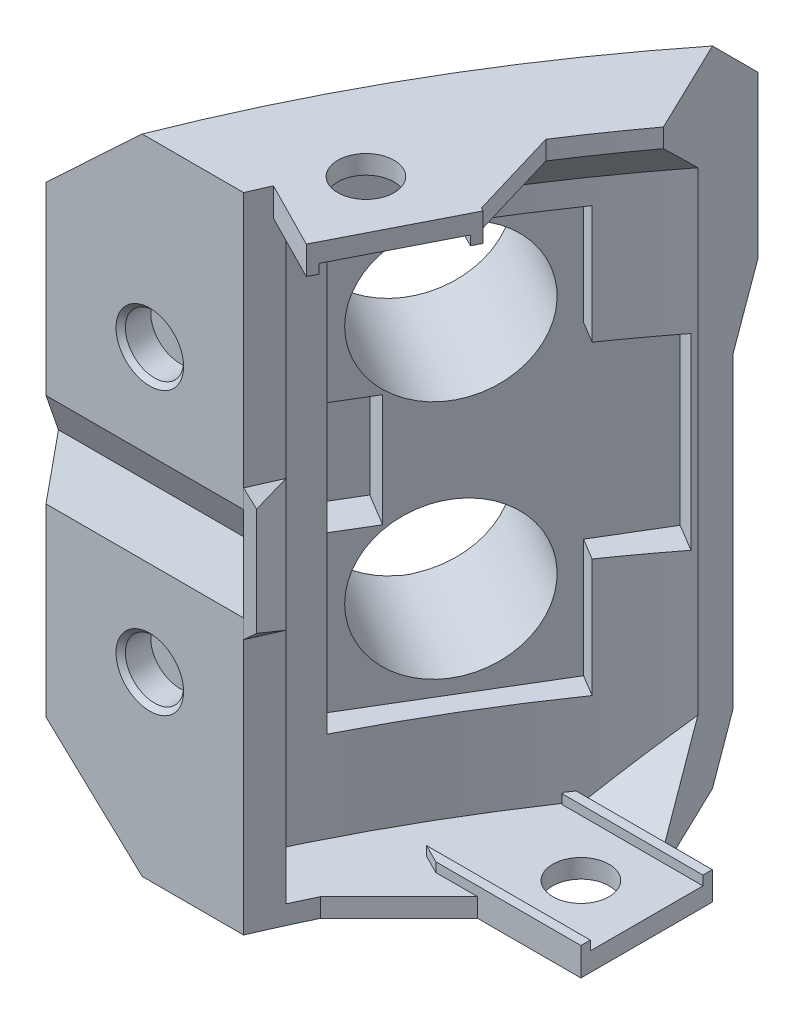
ISO-10303-21;
HEADER;
FILE_DESCRIPTION(('STEP AP214'),'2;1');
FILE_NAME('part.step','',(''),(''),'','','');
FILE_SCHEMA(('AUTOMOTIVE_DESIGN { 1 0 10303 214 1 1 1 1 }'));
ENDSEC;
DATA;
#1=APPLICATION_CONTEXT('core data for automotive mechanical design processes');
#2=APPLICATION_PROTOCOL_DEFINITION('international standard','automotive_design',2000,#1);
#3=PRODUCT_CONTEXT('',#1,'mechanical');
#4=PRODUCT('Part','Part','',(#3));
#5=PRODUCT_RELATED_PRODUCT_CATEGORY('part','',(#4));
#6=PRODUCT_DEFINITION_FORMATION('','',#4);
#7=PRODUCT_DEFINITION_CONTEXT('part definition',#1,'design');
#8=PRODUCT_DEFINITION('design','',#6,#7);
#9=PRODUCT_DEFINITION_SHAPE('','',#8);
#10=(LENGTH_UNIT() NAMED_UNIT(*) SI_UNIT(.MILLI.,.METRE.));
#11=(NAMED_UNIT(*) PLANE_ANGLE_UNIT() SI_UNIT($,.RADIAN.));
#12=(NAMED_UNIT(*) SI_UNIT($,.STERADIAN.) SOLID_ANGLE_UNIT());
#13=UNCERTAINTY_MEASURE_WITH_UNIT(LENGTH_MEASURE(1.E-05),#10,'distance_accuracy_value','');
#14=(GEOMETRIC_REPRESENTATION_CONTEXT(3) GLOBAL_UNCERTAINTY_ASSIGNED_CONTEXT((#13)) GLOBAL_UNIT_ASSIGNED_CONTEXT((#10,
#11,#12)) REPRESENTATION_CONTEXT('',''));
#15=CARTESIAN_POINT('',(0.,0.,0.));
#16=DIRECTION('',(0.,0.,1.));
#17=DIRECTION('',(1.,0.,0.));
#18=AXIS2_PLACEMENT_3D('',#15,#16,#17);
#19=CARTESIAN_POINT('',(0.,0.,0.));
#20=DIRECTION('',(0.,-1.,0.));
#21=DIRECTION('',(0.,0.,-1.));
#22=AXIS2_PLACEMENT_3D('',#19,#20,#21);
#23=CYLINDRICAL_SURFACE('',#22,140.);
#24=DIRECTION('',(0.,-1.,0.));
#25=VECTOR('',#24,1.);
#26=CARTESIAN_POINT('',(-127.363861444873,0.,-58.1244079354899));
#27=LINE('',#26,#25);
#28=CARTESIAN_POINT('',(-127.363861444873,-41.2500000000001,-58.1244079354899));
#29=VERTEX_POINT('',#28);
#30=CARTESIAN_POINT('',(-127.363861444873,-66.5000000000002,-58.1244079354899));
#31=VERTEX_POINT('',#30);
#32=EDGE_CURVE('E1233',#29,#31,#27,.T.);
#33=ORIENTED_EDGE('',*,*,#32,.F.);
#34=CARTESIAN_POINT('',(0.,-41.2500000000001,0.));
#35=DIRECTION('',(0.,1.,0.));
#36=DIRECTION('',(0.,0.,1.));
#37=AXIS2_PLACEMENT_3D('',#34,#35,#36);
#38=CIRCLE('',#37,140.);
#39=CARTESIAN_POINT('',(-128.743931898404,-41.2500000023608,-55.));
#40=VERTEX_POINT('',#39);
#41=EDGE_CURVE('E1492',#29,#40,#38,.T.);
#42=ORIENTED_EDGE('',*,*,#41,.T.);
#43=DIRECTION('',(0.,-1.,0.));
#44=VECTOR('',#43,1.);
#45=CARTESIAN_POINT('',(-128.743931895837,0.,-55.));
#46=LINE('',#45,#44);
#47=CARTESIAN_POINT('',(-128.743931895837,-68.5000000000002,-55.));
#48=VERTEX_POINT('',#47);
#49=EDGE_CURVE('E440',#48,#40,#46,.F.);
#50=ORIENTED_EDGE('',*,*,#49,.F.);
#51=CARTESIAN_POINT('',(0.,-68.5000000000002,0.));
#52=DIRECTION('',(0.,-1.,0.));
#53=DIRECTION('',(-1.,0.,0.));
#54=AXIS2_PLACEMENT_3D('',#51,#52,#53);
#55=CIRCLE('',#54,140.);
#56=CARTESIAN_POINT('',(-126.194885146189,-68.5000000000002,-60.6205490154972));
#57=VERTEX_POINT('',#56);
#58=EDGE_CURVE('E653',#48,#57,#55,.T.);
#59=ORIENTED_EDGE('',*,*,#58,.T.);
#60=DIRECTION('',(0.,-1.,0.));
#61=VECTOR('',#60,1.);
#62=CARTESIAN_POINT('',(-126.194885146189,0.,-60.6205490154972));
#63=LINE('',#62,#61);
#64=CARTESIAN_POINT('',(-126.194885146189,-66.5000000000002,-60.6205490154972));
#65=VERTEX_POINT('',#64);
#66=EDGE_CURVE('E673',#57,#65,#63,.F.);
#67=ORIENTED_EDGE('',*,*,#66,.T.);
#68=CARTESIAN_POINT('',(0.,-66.5000000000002,0.));
#69=DIRECTION('',(0.,-1.,0.));
#70=DIRECTION('',(-1.,0.,0.));
#71=AXIS2_PLACEMENT_3D('',#68,#69,#70);
#72=CIRCLE('',#71,140.);
#73=EDGE_CURVE('E632',#31,#65,#72,.T.);
#74=ORIENTED_EDGE('',*,*,#73,.F.);
#75=EDGE_LOOP('',(#33,#42,#50,#59,#67,#74));
#76=FACE_BOUND('',#75,.T.);
#77=ADVANCED_FACE('F53',(#76),#23,.F.);
#78=CARTESIAN_POINT('',(15.9628656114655,1.76124063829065E-13,183.138749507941));
#79=DIRECTION('',(0.900925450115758,0.,-0.433973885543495));
#80=DIRECTION('',(-0.433973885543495,0.,-0.900925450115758));
#81=AXIS2_PLACEMENT_3D('',#78,#79,#80);
#82=PLANE('',#81);
#83=DIRECTION('',(-0.433973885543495,0.,-0.900925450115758));
#84=VECTOR('',#83,1.);
#85=CARTESIAN_POINT('',(-85.0133843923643,-68.5000000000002,-26.4869365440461));
#86=LINE('',#85,#84);
#87=CARTESIAN_POINT('',(-112.435850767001,-68.5000000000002,-83.415702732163));
#88=VERTEX_POINT('',#87);
#89=CARTESIAN_POINT('',(-117.293435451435,-68.5000000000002,-93.5));
#90=VERTEX_POINT('',#89);
#91=EDGE_CURVE('E553',#88,#90,#86,.T.);
#92=ORIENTED_EDGE('',*,*,#91,.T.);
#93=CARTESIAN_POINT('',(-123.675932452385,-55.2500000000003,-106.749999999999));
#94=CARTESIAN_POINT('',(-123.144057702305,-56.354166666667,-105.645833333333));
#95=CARTESIAN_POINT('',(-122.612182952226,-57.4583333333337,-104.541666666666));
#96=CARTESIAN_POINT('',(-121.282496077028,-60.2187500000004,-101.78125));
#97=CARTESIAN_POINT('',(-120.48468395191,-61.8750000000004,-100.125));
#98=CARTESIAN_POINT('',(-118.889059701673,-65.1875000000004,-96.8124999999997));
#99=CARTESIAN_POINT('',(-118.091247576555,-66.8437500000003,-95.1562499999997));
#100=CARTESIAN_POINT('',(-117.293435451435,-68.5000000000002,-93.5));
#101=B_SPLINE_CURVE_WITH_KNOTS('',3,(#93,#94,#95,#96,#97,#98,#99,#100),.UNSPECIFIED.,.F.,.F.,(4,
2,2,4),(0.,4.94887151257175,12.3721787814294,19.7954860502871),.UNSPECIFIED.);
#102=CARTESIAN_POINT('',(-119.340651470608,-64.2500000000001,-97.75));
#103=VERTEX_POINT('',#102);
#104=EDGE_CURVE('E691',#103,#90,#101,.T.);
#105=ORIENTED_EDGE('',*,*,#104,.F.);
#106=DIRECTION('',(0.,-1.,0.));
#107=VECTOR('',#106,1.);
#108=CARTESIAN_POINT('',(-119.340651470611,-63.0000000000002,-97.75));
#109=LINE('',#108,#107);
#110=CARTESIAN_POINT('',(-119.340651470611,-31.5091973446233,-97.75));
#111=VERTEX_POINT('',#110);
#112=EDGE_CURVE('E596',#111,#103,#109,.T.);
#113=ORIENTED_EDGE('',*,*,#112,.F.);
#114=CARTESIAN_POINT('',(-126.291527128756,-17.6715441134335,-112.179948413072));
#115=CARTESIAN_POINT('',(-125.977742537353,-18.280504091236,-111.528534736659));
#116=CARTESIAN_POINT('',(-125.664273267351,-18.8903258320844,-110.877775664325));
#117=CARTESIAN_POINT('',(-125.038052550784,-20.1119259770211,-109.577747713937));
#118=CARTESIAN_POINT('',(-124.725301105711,-20.7237043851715,-108.928478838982));
#119=CARTESIAN_POINT('',(-123.78829986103,-22.5622349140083,-106.983273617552));
#120=CARTESIAN_POINT('',(-123.165259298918,-23.7922673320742,-105.689847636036));
#121=CARTESIAN_POINT('',(-122.233860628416,-25.6457954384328,-103.756273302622));
#122=CARTESIAN_POINT('',(-121.923916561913,-26.265061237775,-103.112832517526));
#123=CARTESIAN_POINT('',(-121.305256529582,-27.5068390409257,-101.828500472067));
#124=CARTESIAN_POINT('',(-120.996540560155,-28.1293510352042,-101.18760920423));
#125=CARTESIAN_POINT('',(-120.380511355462,-29.3781479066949,-99.9087387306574));
#126=CARTESIAN_POINT('',(-120.073198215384,-30.0044330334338,-99.270759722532));
#127=CARTESIAN_POINT('',(-119.460253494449,-31.2613710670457,-97.9982926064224));
#128=CARTESIAN_POINT('',(-119.154621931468,-31.8920240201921,-97.3638045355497));
#129=CARTESIAN_POINT('',(-118.849963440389,-32.5251723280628,-96.7313365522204));
#130=B_SPLINE_CURVE_WITH_KNOTS('',3,(#114,#115,#116,#117,#118,#119,#120,#121,#122,#123,#124,
#125,#126,#127,#128,#129),.UNSPECIFIED.,.F.,.F.,(4,2,2,2,2,2,2,4),(0.,2.8359622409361,
5.67193037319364,11.3434705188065,14.1793301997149,17.0151815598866,19.8512225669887,
22.6872936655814),.UNSPECIFIED.);
#131=CARTESIAN_POINT('',(-121.792599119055,-26.5289543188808,-102.840218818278));
#132=VERTEX_POINT('',#131);
#133=EDGE_CURVE('E587',#132,#111,#130,.T.);
#134=ORIENTED_EDGE('',*,*,#133,.F.);
#135=DIRECTION('',(0.,1.,0.));
#136=VECTOR('',#135,1.);
#137=CARTESIAN_POINT('',(-121.792599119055,-34.2500000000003,-102.840218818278));
#138=LINE('',#137,#136);
#139=CARTESIAN_POINT('',(-121.792599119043,-9.34021881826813,-102.840218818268));
#140=VERTEX_POINT('',#139);
#141=EDGE_CURVE('E595',#140,#132,#138,.F.);
#142=ORIENTED_EDGE('',*,*,#141,.F.);
#143=CARTESIAN_POINT('',(-117.293435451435,0.,-93.5));
#144=CARTESIAN_POINT('',(-118.357184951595,-2.20833333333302,-95.7083333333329));
#145=CARTESIAN_POINT('',(-119.420934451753,-4.41666666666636,-97.9166666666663));
#146=CARTESIAN_POINT('',(-121.016558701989,-7.72916666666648,-101.229166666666));
#147=CARTESIAN_POINT('',(-121.548433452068,-8.83333333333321,-102.333333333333));
#148=CARTESIAN_POINT('',(-122.612182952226,-11.0416666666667,-104.541666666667));
#149=CARTESIAN_POINT('',(-123.144057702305,-12.1458333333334,-105.645833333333));
#150=CARTESIAN_POINT('',(-123.675932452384,-13.2500000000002,-106.75));
#151=B_SPLINE_CURVE_WITH_KNOTS('',3,(#143,#144,#145,#146,#147,#148,#149,#150),.UNSPECIFIED.,.F.,
.F.,(4,2,2,4),(0.,9.8977430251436,14.8466145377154,19.7954860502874),.UNSPECIFIED.);
#152=CARTESIAN_POINT('',(-117.293435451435,0.,-93.5));
#153=VERTEX_POINT('',#152);
#154=EDGE_CURVE('E720',#153,#140,#151,.T.);
#155=ORIENTED_EDGE('',*,*,#154,.F.);
#156=DIRECTION('',(0.433973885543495,0.,0.900925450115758));
#157=VECTOR('',#156,1.);
#158=CARTESIAN_POINT('',(-114.724728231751,0.,-88.1673894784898));
#159=LINE('',#158,#157);
#160=CARTESIAN_POINT('',(-112.435850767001,0.,-83.415702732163));
#161=VERTEX_POINT('',#160);
#162=EDGE_CURVE('E554',#153,#161,#159,.T.);
#163=ORIENTED_EDGE('',*,*,#162,.T.);
#164=DIRECTION('',(0.,-1.,0.));
#165=VECTOR('',#164,1.);
#166=CARTESIAN_POINT('',(-112.435850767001,0.,-83.415702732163));
#167=LINE('',#166,#165);
#168=CARTESIAN_POINT('',(-112.435850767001,-2.,-83.415702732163));
#169=VERTEX_POINT('',#168);
#170=EDGE_CURVE('E549',#161,#169,#167,.T.);
#171=ORIENTED_EDGE('',*,*,#170,.T.);
#172=CARTESIAN_POINT('',(-112.435702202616,-1.99969692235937,-83.4153943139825));
#173=CARTESIAN_POINT('',(-112.720628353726,-2.58095889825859,-84.0068981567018));
#174=CARTESIAN_POINT('',(-113.005339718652,-3.16277975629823,-84.5979561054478));
#175=CARTESIAN_POINT('',(-113.574348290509,-4.32749256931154,-85.7792122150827));
#176=CARTESIAN_POINT('',(-113.858645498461,-4.91038452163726,-86.3694103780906));
#177=CARTESIAN_POINT('',(-114.426842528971,-6.07719562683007,-87.5489817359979));
#178=CARTESIAN_POINT('',(-114.710742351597,-6.66111477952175,-88.1383549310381));
#179=CARTESIAN_POINT('',(-115.278160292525,-7.82994025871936,-89.3163089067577));
#180=CARTESIAN_POINT('',(-115.561678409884,-8.41484658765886,-89.9048896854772));
#181=CARTESIAN_POINT('',(-115.845012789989,-9.00022499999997,-90.4930890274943));
#182=B_SPLINE_CURVE_WITH_KNOTS('',3,(#172,#173,#174,#175,#176,#177,#178,#179,#180,#181),
.UNSPECIFIED.,.F.,.F.,(4,2,2,2,4),(0.,2.63065092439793,5.26129535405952,7.8919393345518,
10.5225898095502),.UNSPECIFIED.);
#183=CARTESIAN_POINT('',(-115.844903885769,-8.99999999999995,-90.4928629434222));
#184=VERTEX_POINT('',#183);
#185=EDGE_CURVE('E555',#169,#184,#182,.T.);
#186=ORIENTED_EDGE('',*,*,#185,.T.);
#187=DIRECTION('',(0.,-1.,0.));
#188=VECTOR('',#187,1.);
#189=CARTESIAN_POINT('',(-115.844903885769,0.,-90.4928629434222));
#190=LINE('',#189,#188);
#191=CARTESIAN_POINT('',(-115.844903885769,-59.507137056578,-90.4928629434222));
#192=VERTEX_POINT('',#191);
#193=EDGE_CURVE('E565',#184,#192,#190,.T.);
#194=ORIENTED_EDGE('',*,*,#193,.T.);
#195=DIRECTION('',(-0.322421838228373,0.669344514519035,-0.669344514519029));
#196=VECTOR('',#195,1.);
#197=CARTESIAN_POINT('',(-116.738810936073,-57.6513949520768,-92.3486050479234));
#198=LINE('',#197,#196);
#199=CARTESIAN_POINT('',(-112.476456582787,-66.5000000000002,-83.5));
#200=VERTEX_POINT('',#199);
#201=EDGE_CURVE('E1446',#192,#200,#198,.F.);
#202=ORIENTED_EDGE('',*,*,#201,.T.);
#203=DIRECTION('',(0.433973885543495,0.,0.900925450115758));
#204=VECTOR('',#203,1.);
#205=CARTESIAN_POINT('',(-86.3317177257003,-66.5000000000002,-29.2237833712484));
#206=LINE('',#205,#204);
#207=CARTESIAN_POINT('',(-112.435850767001,-66.5000000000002,-83.415702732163));
#208=VERTEX_POINT('',#207);
#209=EDGE_CURVE('E1436',#200,#208,#206,.T.);
#210=ORIENTED_EDGE('',*,*,#209,.T.);
#211=DIRECTION('',(0.,-1.,0.));
#212=VECTOR('',#211,1.);
#213=CARTESIAN_POINT('',(-112.435850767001,0.,-83.415702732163));
#214=LINE('',#213,#212);
#215=EDGE_CURVE('E1441',#208,#88,#214,.T.);
#216=ORIENTED_EDGE('',*,*,#215,.T.);
#217=EDGE_LOOP('',(#92,#105,#113,#134,#142,#155,#163,#171,#186,#194,#202,#210,#216));
#218=FACE_BOUND('',#217,.T.);
#219=ADVANCED_FACE('F516',(#218),#82,.T.);
#220=CARTESIAN_POINT('',(-124.414182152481,0.,-83.5));
#221=DIRECTION('',(0.,-1.,0.));
#222=DIRECTION('',(0.,0.,-1.));
#223=AXIS2_PLACEMENT_3D('',#220,#221,#222);
#224=PLANE('',#223);
#225=CARTESIAN_POINT('',(-123.716078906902,0.,-63.));
#226=DIRECTION('',(0.,1.,0.));
#227=DIRECTION('',(0.,0.,1.));
#228=AXIS2_PLACEMENT_3D('',#225,#226,#227);
#229=CIRCLE('',#228,3.00000000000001);
#230=CARTESIAN_POINT('',(-123.716078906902,0.,-60.));
#231=VERTEX_POINT('',#230);
#232=EDGE_CURVE('E1237',#231,#231,#229,.F.);
#233=ORIENTED_EDGE('',*,*,#232,.T.);
#234=EDGE_LOOP('',(#233));
#235=FACE_BOUND('',#234,.T.);
#236=ORIENTED_EDGE('',*,*,#162,.F.);
#237=CARTESIAN_POINT('',(0.,0.,0.));
#238=DIRECTION('',(0.,-1.,0.));
#239=DIRECTION('',(-1.,0.,0.));
#240=AXIS2_PLACEMENT_3D('',#237,#238,#239);
#241=CIRCLE('',#240,150.);
#242=CARTESIAN_POINT('',(-139.552888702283,0.,-54.9999415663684));
#243=VERTEX_POINT('',#242);
#244=EDGE_CURVE('E707',#243,#153,#241,.T.);
#245=ORIENTED_EDGE('',*,*,#244,.F.);
#246=DIRECTION('',(-1.,0.,0.));
#247=VECTOR('',#246,1.);
#248=CARTESIAN_POINT('',(-140.,0.,-55.));
#249=LINE('',#248,#247);
#250=CARTESIAN_POINT('',(-128.743931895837,0.,-55.));
#251=VERTEX_POINT('',#250);
#252=EDGE_CURVE('E1402',#251,#243,#249,.T.);
#253=ORIENTED_EDGE('',*,*,#252,.F.);
#254=CARTESIAN_POINT('',(0.,0.,0.));
#255=DIRECTION('',(0.,-1.,0.));
#256=DIRECTION('',(-1.,0.,0.));
#257=AXIS2_PLACEMENT_3D('',#254,#255,#256);
#258=CIRCLE('',#257,140.);
#259=CARTESIAN_POINT('',(-127.77622524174,0.,-57.212203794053));
#260=VERTEX_POINT('',#259);
#261=EDGE_CURVE('E696',#251,#260,#258,.T.);
#262=ORIENTED_EDGE('',*,*,#261,.T.);
#263=DIRECTION('',(-0.891112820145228,0.,-0.453781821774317));
#264=VECTOR('',#263,1.);
#265=CARTESIAN_POINT('',(-120.654761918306,0.,-53.5857375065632));
#266=LINE('',#265,#264);
#267=CARTESIAN_POINT('',(-120.654761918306,0.,-53.5857375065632));
#268=VERTEX_POINT('',#267);
#269=EDGE_CURVE('E1292',#268,#260,#266,.T.);
#270=ORIENTED_EDGE('',*,*,#269,.F.);
#271=DIRECTION('',(-0.453781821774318,0.,0.891112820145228));
#272=VECTOR('',#271,1.);
#273=CARTESIAN_POINT('',(-114.301816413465,0.,-66.0613169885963));
#274=LINE('',#273,#272);
#275=CARTESIAN_POINT('',(-114.301816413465,0.,-66.0613169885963));
#276=VERTEX_POINT('',#275);
#277=EDGE_CURVE('E1297',#276,#268,#274,.T.);
#278=ORIENTED_EDGE('',*,*,#277,.F.);
#279=DIRECTION('',(0.891112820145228,0.,0.453781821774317));
#280=VECTOR('',#279,1.);
#281=CARTESIAN_POINT('',(-127.668508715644,0.,-72.8680443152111));
#282=LINE('',#281,#280);
#283=CARTESIAN_POINT('',(-114.650822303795,0.,-66.2390414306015));
#284=VERTEX_POINT('',#283);
#285=EDGE_CURVE('E1204',#284,#276,#282,.T.);
#286=ORIENTED_EDGE('',*,*,#285,.F.);
#287=DIRECTION('',(0.285360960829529,0.,0.958420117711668));
#288=VECTOR('',#287,1.);
#289=CARTESIAN_POINT('',(-98.5989360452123,0.,-12.3267940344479));
#290=LINE('',#289,#288);
#291=CARTESIAN_POINT('',(-117.562876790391,0.,-76.0195369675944));
#292=VERTEX_POINT('',#291);
#293=EDGE_CURVE('E1552',#284,#292,#290,.F.);
#294=ORIENTED_EDGE('',*,*,#293,.T.);
#295=EDGE_CURVE('E693',#292,#161,#258,.T.);
#296=ORIENTED_EDGE('',*,*,#295,.T.);
#297=EDGE_LOOP('',(#236,#245,#253,#262,#270,#278,#286,#294,#296));
#298=FACE_BOUND('',#297,.T.);
#299=ADVANCED_FACE('F511',(#235,#298),#224,.F.);
#300=CARTESIAN_POINT('',(-134.372190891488,0.,-74.0672850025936));
#301=DIRECTION('',(-0.51497428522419,0.,0.85720562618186));
#302=DIRECTION('',(0.85720562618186,0.,0.51497428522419));
#303=AXIS2_PLACEMENT_3D('',#300,#301,#302);
#304=PLANE('',#303);
#305=DIRECTION('',(0.85720562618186,0.,0.51497428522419));
#306=VECTOR('',#305,1.);
#307=CARTESIAN_POINT('',(-134.372190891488,-28.2500000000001,-74.0672850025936));
#308=LINE('',#307,#306);
#309=CARTESIAN_POINT('',(-134.372190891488,-28.2500000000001,-74.0672850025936));
#310=VERTEX_POINT('',#309);
#311=CARTESIAN_POINT('',(-130.94336838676,-28.2500000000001,-72.0073878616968));
#312=VERTEX_POINT('',#311);
#313=EDGE_CURVE('E936',#310,#312,#308,.T.);
#314=ORIENTED_EDGE('',*,*,#313,.F.);
#315=DIRECTION('',(0.,-1.,0.));
#316=VECTOR('',#315,1.);
#317=CARTESIAN_POINT('',(-134.372190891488,0.,-74.0672850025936));
#318=LINE('',#317,#316);
#319=CARTESIAN_POINT('',(-134.372190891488,-40.2500000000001,-74.0672850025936));
#320=VERTEX_POINT('',#319);
#321=EDGE_CURVE('E953',#310,#320,#318,.T.);
#322=ORIENTED_EDGE('',*,*,#321,.T.);
#323=DIRECTION('',(0.85720562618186,0.,0.51497428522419));
#324=VECTOR('',#323,1.);
#325=CARTESIAN_POINT('',(-134.372190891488,-40.2500000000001,-74.0672850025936));
#326=LINE('',#325,#324);
#327=CARTESIAN_POINT('',(-130.94336838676,-40.2500000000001,-72.0073878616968));
#328=VERTEX_POINT('',#327);
#329=EDGE_CURVE('E941',#320,#328,#326,.T.);
#330=ORIENTED_EDGE('',*,*,#329,.T.);
#331=DIRECTION('',(0.,-1.,0.));
#332=VECTOR('',#331,1.);
#333=CARTESIAN_POINT('',(-130.94336838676,0.,-72.0073878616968));
#334=LINE('',#333,#332);
#335=EDGE_CURVE('E913',#312,#328,#334,.T.);
#336=ORIENTED_EDGE('',*,*,#335,.F.);
#337=EDGE_LOOP('',(#314,#322,#330,#336));
#338=FACE_BOUND('',#337,.T.);
#339=ADVANCED_FACE('F515',(#338),#304,.T.);
#340=CARTESIAN_POINT('',(-131.433062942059,-28.2500000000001,-78.9596399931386));
#341=DIRECTION('',(0.,-1.,0.));
#342=DIRECTION('',(0.,0.,-1.));
#343=AXIS2_PLACEMENT_3D('',#340,#341,#342);
#344=PLANE('',#343);
#345=DIRECTION('',(0.85720562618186,0.,0.51497428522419));
#346=VECTOR('',#345,1.);
#347=CARTESIAN_POINT('',(-136.947062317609,-28.2500000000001,-69.7812568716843));
#348=LINE('',#347,#346);
#349=CARTESIAN_POINT('',(-136.947062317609,-28.2500000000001,-69.7812568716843));
#350=VERTEX_POINT('',#349);
#351=CARTESIAN_POINT('',(-133.518239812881,-28.2500000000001,-67.7213597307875));
#352=VERTEX_POINT('',#351);
#353=EDGE_CURVE('E933',#350,#352,#348,.T.);
#354=ORIENTED_EDGE('',*,*,#353,.F.);
#355=DIRECTION('',(0.51497428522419,0.,-0.85720562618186));
#356=VECTOR('',#355,1.);
#357=CARTESIAN_POINT('',(-131.433062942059,-28.2500000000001,-78.9596399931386));
#358=LINE('',#357,#356);
#359=EDGE_CURVE('E937',#350,#310,#358,.T.);
#360=ORIENTED_EDGE('',*,*,#359,.T.);
#361=ORIENTED_EDGE('',*,*,#313,.T.);
#362=DIRECTION('',(0.51497428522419,0.,-0.85720562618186));
#363=VECTOR('',#362,1.);
#364=CARTESIAN_POINT('',(-128.004240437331,-28.2500000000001,-76.8997428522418));
#365=LINE('',#364,#363);
#366=EDGE_CURVE('E661',#352,#312,#365,.T.);
#367=ORIENTED_EDGE('',*,*,#366,.F.);
#368=EDGE_LOOP('',(#354,#360,#361,#367));
#369=FACE_BOUND('',#368,.T.);
#370=ADVANCED_FACE('F931',(#369),#344,.T.);
#371=CARTESIAN_POINT('',(-131.433062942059,0.,-78.9596399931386));
#372=DIRECTION('',(0.85720562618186,0.,0.51497428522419));
#373=DIRECTION('',(-0.51497428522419,0.,0.85720562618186));
#374=AXIS2_PLACEMENT_3D('',#371,#372,#373);
#375=PLANE('',#374);
#376=ORIENTED_EDGE('',*,*,#359,.F.);
#377=DIRECTION('',(0.,-1.,0.));
#378=VECTOR('',#377,1.);
#379=CARTESIAN_POINT('',(-136.947062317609,0.,-69.7812568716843));
#380=LINE('',#379,#378);
#381=CARTESIAN_POINT('',(-136.947062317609,-40.2500000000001,-69.7812568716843));
#382=VERTEX_POINT('',#381);
#383=EDGE_CURVE('E1377',#350,#382,#380,.T.);
#384=ORIENTED_EDGE('',*,*,#383,.T.);
#385=DIRECTION('',(0.51497428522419,0.,-0.85720562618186));
#386=VECTOR('',#385,1.);
#387=CARTESIAN_POINT('',(-131.433062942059,-40.2500000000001,-78.9596399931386));
#388=LINE('',#387,#386);
#389=EDGE_CURVE('E1379',#382,#320,#388,.T.);
#390=ORIENTED_EDGE('',*,*,#389,.T.);
#391=ORIENTED_EDGE('',*,*,#321,.F.);
#392=EDGE_LOOP('',(#376,#384,#390,#391));
#393=FACE_BOUND('',#392,.T.);
#394=ADVANCED_FACE('F1095',(#393),#375,.T.);
#395=CARTESIAN_POINT('',(-131.433062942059,-40.2500000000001,-78.9596399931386));
#396=DIRECTION('',(0.,-1.,0.));
#397=DIRECTION('',(0.,0.,-1.));
#398=AXIS2_PLACEMENT_3D('',#395,#396,#397);
#399=PLANE('',#398);
#400=DIRECTION('',(0.51497428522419,0.,-0.85720562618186));
#401=VECTOR('',#400,1.);
#402=CARTESIAN_POINT('',(-128.004240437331,-40.2500000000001,-76.8997428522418));
#403=LINE('',#402,#401);
#404=CARTESIAN_POINT('',(-133.518239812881,-40.2500000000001,-67.7213597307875));
#405=VERTEX_POINT('',#404);
#406=EDGE_CURVE('E910',#405,#328,#403,.T.);
#407=ORIENTED_EDGE('',*,*,#406,.T.);
#408=ORIENTED_EDGE('',*,*,#329,.F.);
#409=ORIENTED_EDGE('',*,*,#389,.F.);
#410=DIRECTION('',(0.85720562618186,0.,0.51497428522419));
#411=VECTOR('',#410,1.);
#412=CARTESIAN_POINT('',(-136.947062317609,-40.2500000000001,-69.7812568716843));
#413=LINE('',#412,#411);
#414=EDGE_CURVE('E950',#382,#405,#413,.T.);
#415=ORIENTED_EDGE('',*,*,#414,.T.);
#416=EDGE_LOOP('',(#407,#408,#409,#415));
#417=FACE_BOUND('',#416,.T.);
#418=ADVANCED_FACE('F1091',(#417),#399,.F.);
#419=CARTESIAN_POINT('',(-128.004240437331,0.,-76.8997428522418));
#420=DIRECTION('',(0.85720562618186,0.,0.51497428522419));
#421=DIRECTION('',(-0.51497428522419,0.,0.85720562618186));
#422=AXIS2_PLACEMENT_3D('',#419,#420,#421);
#423=PLANE('',#422);
#424=CARTESIAN_POINT('',(-128.214004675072,-47.0500000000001,-76.5505776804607));
#425=DIRECTION('',(-0.85720562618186,0.,-0.51497428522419));
#426=DIRECTION('',(-0.51497428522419,0.,0.85720562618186));
#427=AXIS2_PLACEMENT_3D('',#424,#425,#426);
#428=CIRCLE('',#427,8.25000000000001);
#429=CARTESIAN_POINT('',(-132.462542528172,-47.0500000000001,-69.4786312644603));
#430=VERTEX_POINT('',#429);
#431=EDGE_CURVE('E940',#430,#430,#428,.T.);
#432=ORIENTED_EDGE('',*,*,#431,.T.);
#433=EDGE_LOOP('',(#432));
#434=FACE_BOUND('',#433,.T.);
#435=CARTESIAN_POINT('',(-128.214004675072,-21.4500000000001,-76.5505776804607));
#436=DIRECTION('',(-0.85720562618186,0.,-0.51497428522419));
#437=DIRECTION('',(-0.51497428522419,0.,0.85720562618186));
#438=AXIS2_PLACEMENT_3D('',#435,#436,#437);
#439=CIRCLE('',#438,8.25000000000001);
#440=CARTESIAN_POINT('',(-132.462542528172,-21.4500000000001,-69.4786312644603));
#441=VERTEX_POINT('',#440);
#442=EDGE_CURVE('E946',#441,#441,#439,.T.);
#443=ORIENTED_EDGE('',*,*,#442,.T.);
#444=EDGE_LOOP('',(#443));
#445=FACE_BOUND('',#444,.T.);
#446=DIRECTION('',(0.,-1.,0.));
#447=VECTOR('',#446,1.);
#448=CARTESIAN_POINT('',(-133.518239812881,0.,-67.7213597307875));
#449=LINE('',#448,#447);
#450=CARTESIAN_POINT('',(-133.518239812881,-11.6500000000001,-67.7213597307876));
#451=VERTEX_POINT('',#450);
#452=EDGE_CURVE('E928',#451,#352,#449,.T.);
#453=ORIENTED_EDGE('',*,*,#452,.T.);
#454=ORIENTED_EDGE('',*,*,#366,.T.);
#455=ORIENTED_EDGE('',*,*,#335,.T.);
#456=ORIENTED_EDGE('',*,*,#406,.F.);
#457=CARTESIAN_POINT('',(-133.518239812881,-56.8500000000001,-67.7213597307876));
#458=VERTEX_POINT('',#457);
#459=EDGE_CURVE('E984',#405,#458,#449,.T.);
#460=ORIENTED_EDGE('',*,*,#459,.T.);
#461=DIRECTION('',(-0.51497428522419,0.,0.85720562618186));
#462=VECTOR('',#461,1.);
#463=CARTESIAN_POINT('',(-128.004240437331,-56.8500000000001,-76.8997428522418));
#464=LINE('',#463,#462);
#465=CARTESIAN_POINT('',(-122.909769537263,-56.8500000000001,-85.3797956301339));
#466=VERTEX_POINT('',#465);
#467=EDGE_CURVE('E963',#466,#458,#464,.T.);
#468=ORIENTED_EDGE('',*,*,#467,.F.);
#469=DIRECTION('',(0.,-1.,0.));
#470=VECTOR('',#469,1.);
#471=CARTESIAN_POINT('',(-122.909769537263,0.,-85.3797956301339));
#472=LINE('',#471,#470);
#473=CARTESIAN_POINT('',(-122.909769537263,-44.2500000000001,-85.3797956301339));
#474=VERTEX_POINT('',#473);
#475=EDGE_CURVE('E967',#474,#466,#472,.T.);
#476=ORIENTED_EDGE('',*,*,#475,.F.);
#477=DIRECTION('',(0.51497428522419,0.,-0.85720562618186));
#478=VECTOR('',#477,1.);
#479=CARTESIAN_POINT('',(-128.004240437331,-44.2500000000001,-76.8997428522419));
#480=LINE('',#479,#478);
#481=CARTESIAN_POINT('',(-119.047462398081,-44.2500000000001,-91.8088378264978));
#482=VERTEX_POINT('',#481);
#483=EDGE_CURVE('E970',#474,#482,#480,.T.);
#484=ORIENTED_EDGE('',*,*,#483,.T.);
#485=DIRECTION('',(0.,-1.,0.));
#486=VECTOR('',#485,1.);
#487=CARTESIAN_POINT('',(-119.047462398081,0.,-91.8088378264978));
#488=LINE('',#487,#486);
#489=CARTESIAN_POINT('',(-119.047462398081,-24.2500000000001,-91.8088378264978));
#490=VERTEX_POINT('',#489);
#491=EDGE_CURVE('E975',#490,#482,#488,.T.);
#492=ORIENTED_EDGE('',*,*,#491,.F.);
#493=DIRECTION('',(0.51497428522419,0.,-0.85720562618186));
#494=VECTOR('',#493,1.);
#495=CARTESIAN_POINT('',(-128.004240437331,-24.2500000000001,-76.8997428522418));
#496=LINE('',#495,#494);
#497=CARTESIAN_POINT('',(-122.909769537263,-24.2500000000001,-85.3797956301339));
#498=VERTEX_POINT('',#497);
#499=EDGE_CURVE('E978',#498,#490,#496,.T.);
#500=ORIENTED_EDGE('',*,*,#499,.F.);
#501=CARTESIAN_POINT('',(-122.909769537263,-11.6500000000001,-85.3797956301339));
#502=VERTEX_POINT('',#501);
#503=EDGE_CURVE('E971',#502,#498,#472,.T.);
#504=ORIENTED_EDGE('',*,*,#503,.F.);
#505=DIRECTION('',(-0.51497428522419,0.,0.85720562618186));
#506=VECTOR('',#505,1.);
#507=CARTESIAN_POINT('',(-128.004240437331,-11.6500000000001,-76.8997428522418));
#508=LINE('',#507,#506);
#509=EDGE_CURVE('E981',#502,#451,#508,.T.);
#510=ORIENTED_EDGE('',*,*,#509,.T.);
#511=EDGE_LOOP('',(#453,#454,#455,#456,#460,#468,#476,#484,#492,#500,#504,#510));
#512=FACE_BOUND('',#511,.T.);
#513=ADVANCED_FACE('F924',(#434,#445,#512),#423,.T.);
#514=CARTESIAN_POINT('',(0.,-65.5000000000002,0.));
#515=DIRECTION('',(0.,1.,0.));
#516=DIRECTION('',(0.,0.,1.));
#517=AXIS2_PLACEMENT_3D('',#514,#515,#516);
#518=PLANE('',#517);
#519=DIRECTION('',(1.,0.,0.));
#520=VECTOR('',#519,1.);
#521=CARTESIAN_POINT('',(0.,-65.5000000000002,-70.));
#522=LINE('',#521,#520);
#523=CARTESIAN_POINT('',(-124.240096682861,-65.5000000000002,-70.));
#524=VERTEX_POINT('',#523);
#525=CARTESIAN_POINT('',(-106.815434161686,-65.5000000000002,-70.));
#526=VERTEX_POINT('',#525);
#527=EDGE_CURVE('E1345',#524,#526,#522,.T.);
#528=ORIENTED_EDGE('',*,*,#527,.F.);
#529=DIRECTION('',(0.891112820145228,0.,0.453781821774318));
#530=VECTOR('',#529,1.);
#531=CARTESIAN_POINT('',(2.72269093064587,-65.5000000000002,-5.34667692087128));
#532=LINE('',#531,#530);
#533=CARTESIAN_POINT('',(-122.276349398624,-65.5000000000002,-69.));
#534=VERTEX_POINT('',#533);
#535=EDGE_CURVE('E1222',#524,#534,#532,.T.);
#536=ORIENTED_EDGE('',*,*,#535,.T.);
#537=DIRECTION('',(1.,0.,0.));
#538=VECTOR('',#537,1.);
#539=CARTESIAN_POINT('',(0.,-65.5000000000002,-68.9999999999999));
#540=LINE('',#539,#538);
#541=CARTESIAN_POINT('',(-106.815434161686,-65.5000000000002,-69.));
#542=VERTEX_POINT('',#541);
#543=EDGE_CURVE('E1348',#534,#542,#540,.T.);
#544=ORIENTED_EDGE('',*,*,#543,.T.);
#545=DIRECTION('',(0.,0.,1.));
#546=VECTOR('',#545,1.);
#547=CARTESIAN_POINT('',(-106.815434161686,-65.5000000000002,0.));
#548=LINE('',#547,#546);
#549=EDGE_CURVE('E1351',#526,#542,#548,.T.);
#550=ORIENTED_EDGE('',*,*,#549,.F.);
#551=EDGE_LOOP('',(#528,#536,#544,#550));
#552=FACE_BOUND('',#551,.T.);
#553=ADVANCED_FACE('F1090',(#552),#518,.T.);
#554=CARTESIAN_POINT('',(-169.687801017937,-47.0500000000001,-101.466348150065));
#555=DIRECTION('',(0.85720562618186,0.,0.51497428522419));
#556=DIRECTION('',(0.51497428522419,0.,-0.85720562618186));
#557=AXIS2_PLACEMENT_3D('',#554,#555,#556);
#558=CYLINDRICAL_SURFACE('',#557,8.25000000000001);
#559=CARTESIAN_POINT('',(-139.680869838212,-55.2500000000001,-84.4973973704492));
#560=CARTESIAN_POINT('',(-139.561552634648,-55.2245288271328,-84.6946468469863));
#561=CARTESIAN_POINT('',(-139.442371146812,-55.1892883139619,-84.8907109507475));
#562=CARTESIAN_POINT('',(-139.205173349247,-55.0996315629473,-85.2791101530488));
#563=CARTESIAN_POINT('',(-139.087156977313,-55.0452163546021,-85.4714454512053));
#564=CARTESIAN_POINT('',(-138.85325788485,-54.9176182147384,-85.8509079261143));
#565=CARTESIAN_POINT('',(-138.73737363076,-54.8444493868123,-86.0380389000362));
#566=CARTESIAN_POINT('',(-138.508536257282,-54.6798552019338,-86.4059529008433));
#567=CARTESIAN_POINT('',(-138.395583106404,-54.5884300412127,-86.5867359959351));
#568=CARTESIAN_POINT('',(-138.17343663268,-54.3879284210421,-86.9407973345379));
#569=CARTESIAN_POINT('',(-138.064244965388,-54.2788443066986,-87.1140722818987));
#570=CARTESIAN_POINT('',(-137.85053429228,-54.0438281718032,-87.4518615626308));
#571=CARTESIAN_POINT('',(-137.746015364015,-53.9178958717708,-87.6163757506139));
#572=CARTESIAN_POINT('',(-137.542508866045,-53.6501042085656,-87.9355041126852));
#573=CARTESIAN_POINT('',(-137.443520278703,-53.5082477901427,-88.0901201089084));
#574=CARTESIAN_POINT('',(-137.251858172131,-53.2095957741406,-88.388452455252));
#575=CARTESIAN_POINT('',(-137.159184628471,-53.0528002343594,-88.5321688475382));
#576=CARTESIAN_POINT('',(-136.98085986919,-52.7252794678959,-88.8078342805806));
#577=CARTESIAN_POINT('',(-136.895213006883,-52.5545457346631,-88.9397760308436));
#578=CARTESIAN_POINT('',(-136.731690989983,-52.2003810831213,-89.190965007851));
#579=CARTESIAN_POINT('',(-136.653818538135,-52.0169457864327,-89.3102078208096));
#580=CARTESIAN_POINT('',(-136.50653853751,-51.6387374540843,-89.5351586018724));
#581=CARTESIAN_POINT('',(-136.437130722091,-51.4439647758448,-89.6408669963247));
#582=CARTESIAN_POINT('',(-136.307367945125,-51.0444550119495,-89.8380619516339));
#583=CARTESIAN_POINT('',(-136.247013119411,-50.8397177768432,-89.9295482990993));
#584=CARTESIAN_POINT('',(-136.135873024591,-50.4217197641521,-90.0977052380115));
#585=CARTESIAN_POINT('',(-136.085088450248,-50.2084583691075,-90.1743747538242));
#586=CARTESIAN_POINT('',(-135.99353409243,-49.7749366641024,-90.3123908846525));
#587=CARTESIAN_POINT('',(-135.952764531,-49.5546761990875,-90.3737371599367));
#588=CARTESIAN_POINT('',(-135.881607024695,-49.1087841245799,-90.4806911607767));
#589=CARTESIAN_POINT('',(-135.851216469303,-48.8831538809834,-90.526302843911));
#590=CARTESIAN_POINT('',(-135.801061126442,-48.4279959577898,-90.6015250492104));
#591=CARTESIAN_POINT('',(-135.781300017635,-48.1984669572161,-90.6311300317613));
#592=CARTESIAN_POINT('',(-135.75261052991,-47.7374889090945,-90.67409719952));
#593=CARTESIAN_POINT('',(-135.743669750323,-47.5060423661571,-90.6874779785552));
#594=CARTESIAN_POINT('',(-135.736658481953,-47.0426128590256,-90.6979717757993));
#595=CARTESIAN_POINT('',(-135.738588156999,-46.8106298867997,-90.6950845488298));
#596=CARTESIAN_POINT('',(-135.753301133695,-46.3477825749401,-90.6730605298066));
#597=CARTESIAN_POINT('',(-135.766084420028,-46.1169182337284,-90.653923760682));
#598=CARTESIAN_POINT('',(-135.802392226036,-45.6579454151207,-90.599524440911));
#599=CARTESIAN_POINT('',(-135.825916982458,-45.4298369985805,-90.5642615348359));
#600=CARTESIAN_POINT('',(-135.883480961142,-44.9781592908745,-90.4778689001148));
#601=CARTESIAN_POINT('',(-135.917512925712,-44.7545869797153,-90.4267501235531));
#602=CARTESIAN_POINT('',(-135.99581261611,-44.3133293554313,-90.3089494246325));
#603=CARTESIAN_POINT('',(-136.040083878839,-44.0956461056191,-90.2422621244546));
#604=CARTESIAN_POINT('',(-136.138461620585,-43.6678301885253,-90.0937813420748));
#605=CARTESIAN_POINT('',(-136.192566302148,-43.4576961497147,-90.0119906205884));
#606=CARTESIAN_POINT('',(-136.310150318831,-43.0464216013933,-89.8338259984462));
#607=CARTESIAN_POINT('',(-136.373629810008,-42.8452812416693,-89.7374518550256));
#608=CARTESIAN_POINT('',(-136.509472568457,-42.4532685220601,-89.5306696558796));
#609=CARTESIAN_POINT('',(-136.58184270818,-42.2624042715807,-89.4202507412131));
#610=CARTESIAN_POINT('',(-136.734815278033,-41.892460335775,-89.186158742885));
#611=CARTESIAN_POINT('',(-136.815417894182,-41.7133809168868,-89.0624853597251));
#612=CARTESIAN_POINT('',(-136.984162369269,-41.3683103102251,-88.8027232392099));
#613=CARTESIAN_POINT('',(-137.072302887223,-41.2023168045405,-88.6666367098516));
#614=CARTESIAN_POINT('',(-137.255435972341,-40.8845032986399,-88.3828799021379));
#615=CARTESIAN_POINT('',(-137.350430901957,-40.7326882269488,-88.235205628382));
#616=CARTESIAN_POINT('',(-137.546527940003,-40.4442835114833,-87.9292015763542));
#617=CARTESIAN_POINT('',(-137.647633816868,-40.3077034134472,-87.7708652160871));
#618=CARTESIAN_POINT('',(-137.855081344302,-40.0508469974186,-87.4446787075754));
#619=CARTESIAN_POINT('',(-137.961423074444,-39.9305709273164,-87.2768284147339));
#620=CARTESIAN_POINT('',(-138.178488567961,-39.7071841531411,-86.9327543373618));
#621=CARTESIAN_POINT('',(-138.289212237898,-39.6040730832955,-86.7565307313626));
#622=CARTESIAN_POINT('',(-138.514174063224,-39.4157469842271,-86.3969036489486));
#623=CARTESIAN_POINT('',(-138.628412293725,-39.3305323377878,-86.2135000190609));
#624=CARTESIAN_POINT('',(-138.859434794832,-39.1786638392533,-85.8409065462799));
#625=CARTESIAN_POINT('',(-138.976217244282,-39.1119971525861,-85.6517208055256));
#626=CARTESIAN_POINT('',(-139.211556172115,-38.9976029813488,-85.2686854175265));
#627=CARTESIAN_POINT('',(-139.330113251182,-38.949882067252,-85.0748341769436));
#628=CARTESIAN_POINT('',(-139.568052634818,-38.8737611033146,-84.6839213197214));
#629=CARTESIAN_POINT('',(-139.687434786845,-38.8453575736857,-84.4868602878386));
#630=CARTESIAN_POINT('',(-139.926168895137,-38.8080608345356,-84.0908820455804));
#631=CARTESIAN_POINT('',(-140.045520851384,-38.799167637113,-83.891964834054));
#632=CARTESIAN_POINT('',(-140.283208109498,-38.8009538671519,-83.4939006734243));
#633=CARTESIAN_POINT('',(-140.401544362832,-38.8116123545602,-83.2947541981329));
#634=CARTESIAN_POINT('',(-140.636500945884,-38.8523845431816,-82.8974358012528));
#635=CARTESIAN_POINT('',(-140.753121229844,-38.8824987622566,-82.6992639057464));
#636=CARTESIAN_POINT('',(-140.983841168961,-38.9619666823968,-82.3053251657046));
#637=CARTESIAN_POINT('',(-141.097940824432,-39.0113203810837,-82.109558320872));
#638=CARTESIAN_POINT('',(-141.322850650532,-39.1289121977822,-81.7218517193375));
#639=CARTESIAN_POINT('',(-141.433660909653,-39.1971498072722,-81.5299118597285));
#640=CARTESIAN_POINT('',(-141.651279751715,-39.3520299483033,-81.1512329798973));
#641=CARTESIAN_POINT('',(-141.758087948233,-39.4386742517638,-80.9644944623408));
#642=CARTESIAN_POINT('',(-141.967008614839,-39.6297461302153,-80.5976051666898));
#643=CARTESIAN_POINT('',(-142.069121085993,-39.7341737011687,-80.4174543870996));
#644=CARTESIAN_POINT('',(-142.26803148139,-39.9600898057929,-80.0650353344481));
#645=CARTESIAN_POINT('',(-142.364828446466,-40.0815814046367,-79.8927684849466));
#646=CARTESIAN_POINT('',(-142.552466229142,-40.34070405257,-79.5574856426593));
#647=CARTESIAN_POINT('',(-142.643309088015,-40.4783295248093,-79.3944664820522));
#648=CARTESIAN_POINT('',(-142.818653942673,-40.7689753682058,-79.0786145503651));
#649=CARTESIAN_POINT('',(-142.903147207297,-40.9220162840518,-78.9257958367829));
#650=CARTESIAN_POINT('',(-143.06516208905,-41.2422490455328,-78.6317357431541));
#651=CARTESIAN_POINT('',(-143.142683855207,-41.409440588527,-78.4904941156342));
#652=CARTESIAN_POINT('',(-143.290317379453,-41.7567965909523,-78.2206475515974));
#653=CARTESIAN_POINT('',(-143.360428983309,-41.9369613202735,-78.0920428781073));
#654=CARTESIAN_POINT('',(-143.492846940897,-42.308981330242,-77.8484516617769));
#655=CARTESIAN_POINT('',(-143.555153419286,-42.5008364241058,-77.7334649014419));
#656=CARTESIAN_POINT('',(-143.671657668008,-42.8950090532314,-77.5179144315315));
#657=CARTESIAN_POINT('',(-143.725850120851,-43.0973333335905,-77.4173601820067));
#658=CARTESIAN_POINT('',(-143.825766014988,-43.5108205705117,-77.2315691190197));
#659=CARTESIAN_POINT('',(-143.871492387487,-43.7219804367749,-77.1463270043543));
#660=CARTESIAN_POINT('',(-143.954261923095,-44.1517442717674,-76.9917610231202));
#661=CARTESIAN_POINT('',(-143.991303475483,-44.3703496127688,-76.9224401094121));
#662=CARTESIAN_POINT('',(-144.056495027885,-44.8134066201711,-76.8002760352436));
#663=CARTESIAN_POINT('',(-144.084645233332,-45.0378581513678,-76.747432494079));
#664=CARTESIAN_POINT('',(-144.131884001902,-45.4907933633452,-76.6586756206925));
#665=CARTESIAN_POINT('',(-144.150981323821,-45.7192729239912,-76.6227459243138));
#666=CARTESIAN_POINT('',(-144.180054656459,-46.1788457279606,-76.5680214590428));
#667=CARTESIAN_POINT('',(-144.19003081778,-46.4099389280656,-76.5492264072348));
#668=CARTESIAN_POINT('',(-144.200811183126,-46.8731325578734,-76.5289154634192));
#669=CARTESIAN_POINT('',(-144.201613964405,-47.1052331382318,-76.5274022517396));
#670=CARTESIAN_POINT('',(-144.194041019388,-47.5686712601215,-76.5416712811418));
#671=CARTESIAN_POINT('',(-144.185668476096,-47.8000090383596,-76.5574475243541));
#672=CARTESIAN_POINT('',(-144.159804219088,-48.260165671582,-76.6061426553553));
#673=CARTESIAN_POINT('',(-144.142320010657,-48.4889864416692,-76.6390474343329));
#674=CARTESIAN_POINT('',(-144.098328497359,-48.9426715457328,-76.7217343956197));
#675=CARTESIAN_POINT('',(-144.071821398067,-49.1675359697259,-76.7715161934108));
#676=CARTESIAN_POINT('',(-144.009920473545,-49.6117356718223,-76.8875756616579));
#677=CARTESIAN_POINT('',(-143.974525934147,-49.8310705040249,-76.9538546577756));
#678=CARTESIAN_POINT('',(-143.895038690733,-50.2626341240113,-77.1023928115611));
#679=CARTESIAN_POINT('',(-143.850946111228,-50.474863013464,-77.1846517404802));
#680=CARTESIAN_POINT('',(-143.754261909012,-50.8908685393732,-77.3645833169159));
#681=CARTESIAN_POINT('',(-143.701664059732,-51.0946388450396,-77.4622672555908));
#682=CARTESIAN_POINT('',(-143.58829613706,-51.4920496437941,-77.6722196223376));
#683=CARTESIAN_POINT('',(-143.527528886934,-51.6856936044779,-77.7844830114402));
#684=CARTESIAN_POINT('',(-143.3981374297,-52.0615680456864,-78.02277091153));
#685=CARTESIAN_POINT('',(-143.329512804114,-52.2437979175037,-78.1487961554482));
#686=CARTESIAN_POINT('',(-143.184792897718,-52.5955405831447,-78.4136442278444));
#687=CARTESIAN_POINT('',(-143.108697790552,-52.765053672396,-78.5524667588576));
#688=CARTESIAN_POINT('',(-142.949366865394,-53.0903731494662,-78.8420469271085));
#689=CARTESIAN_POINT('',(-142.866122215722,-53.2461620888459,-78.9928193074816));
#690=CARTESIAN_POINT('',(-142.693059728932,-53.5426871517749,-79.3050122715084));
#691=CARTESIAN_POINT('',(-142.603241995,-53.6834235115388,-79.4664326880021));
#692=CARTESIAN_POINT('',(-142.41753344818,-53.9488924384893,-79.7987746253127));
#693=CARTESIAN_POINT('',(-142.321640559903,-54.0736194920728,-79.9696993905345));
#694=CARTESIAN_POINT('',(-142.124429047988,-54.3060820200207,-80.3196634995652));
#695=CARTESIAN_POINT('',(-142.023112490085,-54.4138239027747,-80.4986997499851));
#696=CARTESIAN_POINT('',(-141.817883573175,-54.6094767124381,-80.8596967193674));
#697=CARTESIAN_POINT('',(-141.714073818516,-54.6977641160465,-81.0415118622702));
#698=CARTESIAN_POINT('',(-141.502467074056,-54.8567868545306,-81.4104204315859));
#699=CARTESIAN_POINT('',(-141.394670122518,-54.9275223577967,-81.5975138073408));
#700=CARTESIAN_POINT('',(-141.175700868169,-55.0509834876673,-81.9757747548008));
#701=CARTESIAN_POINT('',(-141.064526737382,-55.1036991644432,-82.1669445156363));
#702=CARTESIAN_POINT('',(-140.839572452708,-55.1907337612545,-82.5519377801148));
#703=CARTESIAN_POINT('',(-140.725792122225,-55.2250514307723,-82.7457614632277));
#704=CARTESIAN_POINT('',(-140.6110726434,-55.2500000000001,-82.9402386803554));
#705=B_SPLINE_CURVE_WITH_KNOTS('',3,(#559,#560,#561,#562,#563,#564,#565,#566,#567,#568,#569,
#570,#571,#572,#573,#574,#575,#576,#577,#578,#579,#580,#581,#582,#583,#584,#585,#586,#587,#588,
#589,#590,#591,#592,#593,#594,#595,#596,#597,#598,#599,#600,#601,#602,#603,#604,#605,#606,#607,
#608,#609,#610,#611,#612,#613,#614,#615,#616,#617,#618,#619,#620,#621,#622,#623,#624,#625,#626,
#627,#628,#629,#630,#631,#632,#633,#634,#635,#636,#637,#638,#639,#640,#641,#642,#643,#644,#645,
#646,#647,#648,#649,#650,#651,#652,#653,#654,#655,#656,#657,#658,#659,#660,#661,#662,#663,#664,
#665,#666,#667,#668,#669,#670,#671,#672,#673,#674,#675,#676,#677,#678,#679,#680,#681,#682,#683,
#684,#685,#686,#687,#688,#689,#690,#691,#692,#693,#694,#695,#696,#697,#698,#699,#700,#701,#702,
#703,#704),.UNSPECIFIED.,.F.,.F.,(4,2,2,2,2,2,2,2,2,2,2,2,2,2,2,2,2,2,2,2,2,2,2,2,2,2,2,2,2,2,2,
2,2,2,2,2,2,2,2,2,2,2,2,2,2,2,2,2,2,2,2,2,2,2,2,2,2,2,2,2,2,2,2,2,2,2,2,2,2,2,2,2,4),(0.,
0.69558449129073,1.3911316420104,2.08615723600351,2.78117535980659,3.47649557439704,
4.17182732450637,4.86703070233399,5.5622313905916,6.25785958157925,6.95372876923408,
7.64957603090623,8.34543373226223,9.04134193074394,9.73726555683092,10.433014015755,
11.1290031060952,11.8241937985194,12.5193949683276,13.2145951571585,13.9098106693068,
14.6045470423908,15.2995237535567,15.9943735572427,16.6892349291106,17.3846368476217,
18.0800544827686,18.7753486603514,19.47088363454,20.1668519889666,20.8628309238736,
21.5587950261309,22.2547740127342,22.9502702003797,23.646007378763,24.3416191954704,
25.0372314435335,25.7320991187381,26.4269852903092,27.1218713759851,27.8167387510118,
28.5116730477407,29.2066071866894,29.901666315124,30.5964858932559,31.2922440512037,
31.9879873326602,32.6837450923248,33.3794917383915,34.0756923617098,34.7716514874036,
35.4677395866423,36.1638116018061,36.8592087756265,37.5545944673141,38.2500880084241,
38.9453403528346,39.6400209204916,40.334685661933,41.0294062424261,41.7241168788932,
42.4193384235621,43.114320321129,43.8093392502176,44.5043420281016,45.2002160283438,
45.8960791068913,46.592181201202,47.2880200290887,47.9689022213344,48.649777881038,
49.3310288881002,50.0123261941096),.UNSPECIFIED.);
#706=CARTESIAN_POINT('',(-139.680869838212,-55.2500000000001,-84.4973973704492));
#707=VERTEX_POINT('',#706);
#708=CARTESIAN_POINT('',(-140.6110726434,-55.2500000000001,-82.9402386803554));
#709=VERTEX_POINT('',#708);
#710=EDGE_CURVE('E992',#707,#709,#705,.T.);
#711=ORIENTED_EDGE('',*,*,#710,.F.);
#712=CARTESIAN_POINT('',(-140.6110726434,-55.2500000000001,-82.9402386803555));
#713=CARTESIAN_POINT('',(-140.565617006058,-55.2583399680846,-83.0008852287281));
#714=CARTESIAN_POINT('',(-140.520891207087,-55.2656486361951,-83.0622213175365));
#715=CARTESIAN_POINT('',(-140.433158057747,-55.2781571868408,-83.1859234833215));
#716=CARTESIAN_POINT('',(-140.390144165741,-55.28336597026,-83.2482840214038));
#717=CARTESIAN_POINT('',(-140.305823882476,-55.2916883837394,-83.374026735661));
#718=CARTESIAN_POINT('',(-140.264512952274,-55.2948079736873,-83.4374054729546));
#719=CARTESIAN_POINT('',(-140.183590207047,-55.2989628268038,-83.5651777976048));
#720=CARTESIAN_POINT('',(-140.143976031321,-55.3000010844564,-83.6295697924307));
#721=CARTESIAN_POINT('',(-140.066442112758,-55.2999989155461,-83.7593657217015));
#722=CARTESIAN_POINT('',(-140.028522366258,-55.2989584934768,-83.8247696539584));
#723=CARTESIAN_POINT('',(-139.954376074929,-55.2948001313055,-83.9565895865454));
#724=CARTESIAN_POINT('',(-139.91815205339,-55.2916791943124,-84.0230069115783));
#725=CARTESIAN_POINT('',(-139.847401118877,-55.2833557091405,-84.156855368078));
#726=CARTESIAN_POINT('',(-139.812879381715,-55.2781472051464,-84.2242888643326));
#727=CARTESIAN_POINT('',(-139.745539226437,-55.2656416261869,-84.3601734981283));
#728=CARTESIAN_POINT('',(-139.712728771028,-55.2583356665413,-84.4286277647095));
#729=CARTESIAN_POINT('',(-139.680869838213,-55.2499999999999,-84.4973973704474));
#730=B_SPLINE_CURVE_WITH_KNOTS('',3,(#712,#713,#714,#715,#716,#717,#718,#719,#720,#721,#722,
#723,#724,#725,#726,#727,#728,#729),.UNSPECIFIED.,.F.,.F.,(4,2,2,2,2,2,2,2,4),(0.,
0.228731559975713,0.45648312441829,0.683582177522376,0.910354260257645,1.13712585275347,
1.36422480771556,1.59197633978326,1.82070721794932),.UNSPECIFIED.);
#731=EDGE_CURVE('E1031',#709,#707,#730,.T.);
#732=ORIENTED_EDGE('',*,*,#731,.F.);
#733=EDGE_LOOP('',(#711,#732));
#734=FACE_BOUND('',#733,.T.);
#735=ORIENTED_EDGE('',*,*,#431,.F.);
#736=EDGE_LOOP('',(#735));
#737=FACE_BOUND('',#736,.T.);
#738=ADVANCED_FACE('F1114',(#734,#737),#558,.F.);
#739=CARTESIAN_POINT('',(-124.414182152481,-59.5000000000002,-90.5));
#740=DIRECTION('',(0.,0.707106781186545,0.70710678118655));
#741=DIRECTION('',(-1.,0.,0.));
#742=AXIS2_PLACEMENT_3D('',#739,#740,#741);
#743=PLANE('',#742);
#744=ORIENTED_EDGE('',*,*,#201,.F.);
#745=CARTESIAN_POINT('',(0.,-150.000000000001,0.));
#746=DIRECTION('',(0.,0.707106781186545,0.70710678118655));
#747=DIRECTION('',(0.,-0.70710678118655,0.707106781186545));
#748=AXIS2_PLACEMENT_3D('',#745,#746,#747);
#749=ELLIPSE('',#748,207.889393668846,147.);
#750=CARTESIAN_POINT('',(-120.982436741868,-66.5000000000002,-83.5000000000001));
#751=VERTEX_POINT('',#750);
#752=EDGE_CURVE('E526',#751,#192,#749,.F.);
#753=ORIENTED_EDGE('',*,*,#752,.F.);
#754=DIRECTION('',(1.,0.,0.));
#755=VECTOR('',#754,1.);
#756=CARTESIAN_POINT('',(-124.414182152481,-66.5000000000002,-83.5));
#757=LINE('',#756,#755);
#758=EDGE_CURVE('E538',#200,#751,#757,.F.);
#759=ORIENTED_EDGE('',*,*,#758,.F.);
#760=EDGE_LOOP('',(#744,#753,#759));
#761=FACE_BOUND('',#760,.T.);
#762=ADVANCED_FACE('F1706',(#761),#743,.T.);
#763=CARTESIAN_POINT('',(-147.,-66.5000000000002,0.));
#764=DIRECTION('',(0.,-1.,0.));
#765=DIRECTION('',(0.,0.,-1.));
#766=AXIS2_PLACEMENT_3D('',#763,#764,#765);
#767=PLANE('',#766);
#768=ORIENTED_EDGE('',*,*,#209,.F.);
#769=ORIENTED_EDGE('',*,*,#758,.T.);
#770=CARTESIAN_POINT('',(0.,-66.5000000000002,0.));
#771=DIRECTION('',(0.,-1.,0.));
#772=DIRECTION('',(-1.,0.,0.));
#773=AXIS2_PLACEMENT_3D('',#770,#771,#772);
#774=CIRCLE('',#773,147.);
#775=CARTESIAN_POINT('',(-121.326007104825,-66.5000000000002,-83.));
#776=VERTEX_POINT('',#775);
#777=EDGE_CURVE('E637',#776,#751,#774,.T.);
#778=ORIENTED_EDGE('',*,*,#777,.F.);
#779=DIRECTION('',(1.,0.,0.));
#780=VECTOR('',#779,1.);
#781=CARTESIAN_POINT('',(0.,-66.5000000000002,-83.));
#782=LINE('',#781,#780);
#783=CARTESIAN_POINT('',(-112.743070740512,-66.5000000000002,-83.));
#784=VERTEX_POINT('',#783);
#785=EDGE_CURVE('E1323',#776,#784,#782,.T.);
#786=ORIENTED_EDGE('',*,*,#785,.T.);
#787=EDGE_CURVE('E638',#784,#208,#72,.T.);
#788=ORIENTED_EDGE('',*,*,#787,.T.);
#789=EDGE_LOOP('',(#768,#769,#778,#786,#788));
#790=FACE_BOUND('',#789,.T.);
#791=ADVANCED_FACE('F1962',(#790),#767,.F.);
#792=CARTESIAN_POINT('',(0.,-65.5000000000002,0.));
#793=DIRECTION('',(0.,1.,0.));
#794=DIRECTION('',(0.,0.,1.));
#795=AXIS2_PLACEMENT_3D('',#792,#793,#794);
#796=PLANE('',#795);
#797=DIRECTION('',(1.,0.,0.));
#798=VECTOR('',#797,1.);
#799=CARTESIAN_POINT('',(0.,-65.5000000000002,-82.));
#800=LINE('',#799,#798);
#801=CARTESIAN_POINT('',(-121.815434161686,-65.5000000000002,-82.));
#802=VERTEX_POINT('',#801);
#803=CARTESIAN_POINT('',(-106.815434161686,-65.5000000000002,-82.));
#804=VERTEX_POINT('',#803);
#805=EDGE_CURVE('E1322',#802,#804,#800,.T.);
#806=ORIENTED_EDGE('',*,*,#805,.T.);
#807=DIRECTION('',(0.,0.,1.));
#808=VECTOR('',#807,1.);
#809=CARTESIAN_POINT('',(-106.815434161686,-65.5000000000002,0.));
#810=LINE('',#809,#808);
#811=CARTESIAN_POINT('',(-106.815434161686,-65.5000000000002,-83.));
#812=VERTEX_POINT('',#811);
#813=EDGE_CURVE('E1467',#812,#804,#810,.T.);
#814=ORIENTED_EDGE('',*,*,#813,.F.);
#815=DIRECTION('',(1.,0.,0.));
#816=VECTOR('',#815,1.);
#817=CARTESIAN_POINT('',(0.,-65.5000000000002,-83.));
#818=LINE('',#817,#816);
#819=CARTESIAN_POINT('',(-121.326007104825,-65.5000000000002,-83.));
#820=VERTEX_POINT('',#819);
#821=EDGE_CURVE('E1328',#820,#812,#818,.T.);
#822=ORIENTED_EDGE('',*,*,#821,.F.);
#823=CARTESIAN_POINT('',(0.,-65.5000000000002,0.));
#824=DIRECTION('',(0.,1.,0.));
#825=DIRECTION('',(0.,0.,1.));
#826=AXIS2_PLACEMENT_3D('',#823,#824,#825);
#827=CIRCLE('',#826,147.);
#828=CARTESIAN_POINT('',(-121.815434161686,-65.5000000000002,-82.2800097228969));
#829=VERTEX_POINT('',#828);
#830=EDGE_CURVE('E1324',#820,#829,#827,.T.);
#831=ORIENTED_EDGE('',*,*,#830,.T.);
#832=DIRECTION('',(0.,0.,-1.));
#833=VECTOR('',#832,1.);
#834=CARTESIAN_POINT('',(-121.81543416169,-65.5000000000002,-6.03739302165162E-12));
#835=LINE('',#834,#833);
#836=EDGE_CURVE('E1318',#802,#829,#835,.T.);
#837=ORIENTED_EDGE('',*,*,#836,.F.);
#838=EDGE_LOOP('',(#806,#814,#822,#831,#837));
#839=FACE_BOUND('',#838,.T.);
#840=ADVANCED_FACE('F2390',(#839),#796,.T.);
#841=CARTESIAN_POINT('',(-147.,-2.,0.));
#842=DIRECTION('',(0.,1.,0.));
#843=DIRECTION('',(0.,0.,1.));
#844=AXIS2_PLACEMENT_3D('',#841,#842,#843);
#845=PLANE('',#844);
#846=DIRECTION('',(-0.891112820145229,0.,-0.453781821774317));
#847=VECTOR('',#846,1.);
#848=CARTESIAN_POINT('',(-51.6255831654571,-2.,-18.4339746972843));
#849=LINE('',#848,#847);
#850=CARTESIAN_POINT('',(-133.250752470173,-2.,-60.));
#851=VERTEX_POINT('',#850);
#852=CARTESIAN_POINT('',(-134.021454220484,-2.,-60.3924648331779));
#853=VERTEX_POINT('',#852);
#854=EDGE_CURVE('E1194',#851,#853,#849,.T.);
#855=ORIENTED_EDGE('',*,*,#854,.F.);
#856=DIRECTION('',(1.,0.,0.));
#857=VECTOR('',#856,1.);
#858=CARTESIAN_POINT('',(-147.,-2.,-60.));
#859=LINE('',#858,#857);
#860=CARTESIAN_POINT('',(-134.19761547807,-2.,-60.));
#861=VERTEX_POINT('',#860);
#862=EDGE_CURVE('E1519',#861,#851,#859,.T.);
#863=ORIENTED_EDGE('',*,*,#862,.F.);
#864=CARTESIAN_POINT('',(0.,-2.,0.));
#865=DIRECTION('',(0.,-1.,0.));
#866=DIRECTION('',(-1.,0.,0.));
#867=AXIS2_PLACEMENT_3D('',#864,#865,#866);
#868=CIRCLE('',#867,147.);
#869=EDGE_CURVE('E692',#861,#853,#868,.T.);
#870=ORIENTED_EDGE('',*,*,#869,.T.);
#871=EDGE_LOOP('',(#855,#863,#870));
#872=FACE_BOUND('',#871,.T.);
#873=ADVANCED_FACE('F2024',(#872),#845,.F.);
#874=CARTESIAN_POINT('',(-51.6255831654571,-3.,-18.4339746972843));
#875=DIRECTION('',(0.453781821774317,0.,-0.891112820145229));
#876=DIRECTION('',(-0.891112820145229,0.,-0.453781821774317));
#877=AXIS2_PLACEMENT_3D('',#874,#875,#876);
#878=PLANE('',#877);
#879=DIRECTION('',(-0.891112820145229,0.,-0.453781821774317));
#880=VECTOR('',#879,1.);
#881=CARTESIAN_POINT('',(-51.6255831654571,-3.,-18.4339746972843));
#882=LINE('',#881,#880);
#883=CARTESIAN_POINT('',(-133.250752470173,-3.,-60.));
#884=VERTEX_POINT('',#883);
#885=CARTESIAN_POINT('',(-134.021454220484,-3.,-60.3924648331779));
#886=VERTEX_POINT('',#885);
#887=EDGE_CURVE('E1193',#884,#886,#882,.T.);
#888=ORIENTED_EDGE('',*,*,#887,.F.);
#889=DIRECTION('',(0.,1.,0.));
#890=VECTOR('',#889,1.);
#891=CARTESIAN_POINT('',(-133.250752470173,-86.4697623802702,-60.));
#892=LINE('',#891,#890);
#893=EDGE_CURVE('E665',#884,#851,#892,.T.);
#894=ORIENTED_EDGE('',*,*,#893,.T.);
#895=ORIENTED_EDGE('',*,*,#854,.T.);
#896=DIRECTION('',(0.,1.,0.));
#897=VECTOR('',#896,1.);
#898=CARTESIAN_POINT('',(-134.021454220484,-3.,-60.3924648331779));
#899=LINE('',#898,#897);
#900=EDGE_CURVE('E1286',#886,#853,#899,.T.);
#901=ORIENTED_EDGE('',*,*,#900,.F.);
#902=EDGE_LOOP('',(#888,#894,#895,#901));
#903=FACE_BOUND('',#902,.T.);
#904=ADVANCED_FACE('F1141',(#903),#878,.F.);
#905=CARTESIAN_POINT('',(0.,-3.,0.));
#906=DIRECTION('',(0.,1.,0.));
#907=DIRECTION('',(0.,0.,1.));
#908=AXIS2_PLACEMENT_3D('',#905,#906,#907);
#909=PLANE('',#908);
#910=DIRECTION('',(0.891112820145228,0.,0.453781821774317));
#911=VECTOR('',#910,1.);
#912=CARTESIAN_POINT('',(-51.1718013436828,-3.,-19.3250875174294));
#913=LINE('',#912,#911);
#914=CARTESIAN_POINT('',(-133.607114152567,-3.,-61.3036625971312));
#915=VERTEX_POINT('',#914);
#916=CARTESIAN_POINT('',(-131.04705026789,-3.,-60.));
#917=VERTEX_POINT('',#916);
#918=EDGE_CURVE('E1277',#915,#917,#913,.T.);
#919=ORIENTED_EDGE('',*,*,#918,.T.);
#920=DIRECTION('',(-1.,0.,0.));
#921=VECTOR('',#920,1.);
#922=CARTESIAN_POINT('',(-105.035274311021,-3.,-60.));
#923=LINE('',#922,#921);
#924=EDGE_CURVE('E660',#917,#884,#923,.T.);
#925=ORIENTED_EDGE('',*,*,#924,.T.);
#926=ORIENTED_EDGE('',*,*,#887,.T.);
#927=CARTESIAN_POINT('',(0.,-3.,0.));
#928=DIRECTION('',(0.,1.,0.));
#929=DIRECTION('',(0.,0.,1.));
#930=AXIS2_PLACEMENT_3D('',#927,#928,#929);
#931=CIRCLE('',#930,147.);
#932=EDGE_CURVE('E1273',#915,#886,#931,.T.);
#933=ORIENTED_EDGE('',*,*,#932,.F.);
#934=EDGE_LOOP('',(#919,#925,#926,#933));
#935=FACE_BOUND('',#934,.T.);
#936=ADVANCED_FACE('F1068',(#935),#909,.F.);
#937=CARTESIAN_POINT('',(-128.004240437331,-44.2500000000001,-76.8997428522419));
#938=DIRECTION('',(0.,-1.,0.));
#939=DIRECTION('',(0.,0.,-1.));
#940=AXIS2_PLACEMENT_3D('',#937,#938,#939);
#941=PLANE('',#940);
#942=DIRECTION('',(0.85720562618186,0.,0.51497428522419));
#943=VECTOR('',#942,1.);
#944=CARTESIAN_POINT('',(-119.047462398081,-44.2500000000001,-91.8088378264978));
#945=LINE('',#944,#943);
#946=CARTESIAN_POINT('',(-116.167337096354,-44.2500000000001,-90.0785756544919));
#947=VERTEX_POINT('',#946);
#948=EDGE_CURVE('E1009',#482,#947,#945,.T.);
#949=ORIENTED_EDGE('',*,*,#948,.F.);
#950=ORIENTED_EDGE('',*,*,#483,.F.);
#951=DIRECTION('',(0.85720562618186,0.,0.51497428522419));
#952=VECTOR('',#951,1.);
#953=CARTESIAN_POINT('',(-122.909769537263,-44.2500000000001,-85.3797956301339));
#954=LINE('',#953,#952);
#955=CARTESIAN_POINT('',(-120.629090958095,-44.2500000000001,-84.009656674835));
#956=VERTEX_POINT('',#955);
#957=EDGE_CURVE('E1013',#474,#956,#954,.T.);
#958=ORIENTED_EDGE('',*,*,#957,.T.);
#959=CARTESIAN_POINT('',(0.,-44.2500000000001,0.));
#960=DIRECTION('',(0.,-1.,0.));
#961=DIRECTION('',(0.,0.,-1.));
#962=AXIS2_PLACEMENT_3D('',#959,#960,#961);
#963=CIRCLE('',#962,147.);
#964=EDGE_CURVE('E887',#947,#956,#963,.F.);
#965=ORIENTED_EDGE('',*,*,#964,.F.);
#966=EDGE_LOOP('',(#949,#950,#958,#965));
#967=FACE_BOUND('',#966,.T.);
#968=ADVANCED_FACE('F1064',(#967),#941,.F.);
#969=CARTESIAN_POINT('',(-119.047462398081,0.,-91.8088378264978));
#970=DIRECTION('',(-0.51497428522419,0.,0.85720562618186));
#971=DIRECTION('',(0.85720562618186,0.,0.51497428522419));
#972=AXIS2_PLACEMENT_3D('',#969,#970,#971);
#973=PLANE('',#972);
#974=DIRECTION('',(0.,-1.,0.));
#975=VECTOR('',#974,1.);
#976=CARTESIAN_POINT('',(-116.167337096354,0.,-90.0785756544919));
#977=LINE('',#976,#975);
#978=CARTESIAN_POINT('',(-116.167337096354,-24.2500000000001,-90.0785756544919));
#979=VERTEX_POINT('',#978);
#980=EDGE_CURVE('E891',#947,#979,#977,.F.);
#981=ORIENTED_EDGE('',*,*,#980,.T.);
#982=DIRECTION('',(0.85720562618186,0.,0.51497428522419));
#983=VECTOR('',#982,1.);
#984=CARTESIAN_POINT('',(-119.047462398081,-24.2500000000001,-91.8088378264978));
#985=LINE('',#984,#983);
#986=EDGE_CURVE('E1005',#490,#979,#985,.T.);
#987=ORIENTED_EDGE('',*,*,#986,.F.);
#988=ORIENTED_EDGE('',*,*,#491,.T.);
#989=ORIENTED_EDGE('',*,*,#948,.T.);
#990=EDGE_LOOP('',(#981,#987,#988,#989));
#991=FACE_BOUND('',#990,.T.);
#992=ADVANCED_FACE('F1067',(#991),#973,.T.);
#993=CARTESIAN_POINT('',(-128.004240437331,-24.2500000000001,-76.8997428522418));
#994=DIRECTION('',(0.,-1.,0.));
#995=DIRECTION('',(0.,0.,-1.));
#996=AXIS2_PLACEMENT_3D('',#993,#994,#995);
#997=PLANE('',#996);
#998=CARTESIAN_POINT('',(0.,-24.2500000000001,0.));
#999=DIRECTION('',(0.,-1.,0.));
#1000=DIRECTION('',(0.,0.,-1.));
#1001=AXIS2_PLACEMENT_3D('',#998,#999,#1000);
#1002=CIRCLE('',#1001,147.);
#1003=CARTESIAN_POINT('',(-120.629090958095,-24.2500000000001,-84.009656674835));
#1004=VERTEX_POINT('',#1003);
#1005=EDGE_CURVE('E894',#979,#1004,#1002,.F.);
#1006=ORIENTED_EDGE('',*,*,#1005,.T.);
#1007=DIRECTION('',(0.85720562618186,0.,0.51497428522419));
#1008=VECTOR('',#1007,1.);
#1009=CARTESIAN_POINT('',(-122.909769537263,-24.2500000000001,-85.3797956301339));
#1010=LINE('',#1009,#1008);
#1011=EDGE_CURVE('E1001',#498,#1004,#1010,.T.);
#1012=ORIENTED_EDGE('',*,*,#1011,.F.);
#1013=ORIENTED_EDGE('',*,*,#499,.T.);
#1014=ORIENTED_EDGE('',*,*,#986,.T.);
#1015=EDGE_LOOP('',(#1006,#1012,#1013,#1014));
#1016=FACE_BOUND('',#1015,.T.);
#1017=ADVANCED_FACE('F1072',(#1016),#997,.T.);
#1018=CARTESIAN_POINT('',(-122.909769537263,0.,-85.3797956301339));
#1019=DIRECTION('',(-0.51497428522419,0.,0.85720562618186));
#1020=DIRECTION('',(0.85720562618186,0.,0.51497428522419));
#1021=AXIS2_PLACEMENT_3D('',#1018,#1019,#1020);
#1022=PLANE('',#1021);
#1023=DIRECTION('',(0.,-1.,0.));
#1024=VECTOR('',#1023,1.);
#1025=CARTESIAN_POINT('',(-120.629090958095,0.,-84.009656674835));
#1026=LINE('',#1025,#1024);
#1027=CARTESIAN_POINT('',(-120.629090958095,-11.6500000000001,-84.009656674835));
#1028=VERTEX_POINT('',#1027);
#1029=EDGE_CURVE('E897',#1004,#1028,#1026,.F.);
#1030=ORIENTED_EDGE('',*,*,#1029,.T.);
#1031=DIRECTION('',(0.85720562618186,0.,0.51497428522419));
#1032=VECTOR('',#1031,1.);
#1033=CARTESIAN_POINT('',(-122.909769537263,-11.6500000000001,-85.3797956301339));
#1034=LINE('',#1033,#1032);
#1035=EDGE_CURVE('E997',#502,#1028,#1034,.T.);
#1036=ORIENTED_EDGE('',*,*,#1035,.F.);
#1037=ORIENTED_EDGE('',*,*,#503,.T.);
#1038=ORIENTED_EDGE('',*,*,#1011,.T.);
#1039=EDGE_LOOP('',(#1030,#1036,#1037,#1038));
#1040=FACE_BOUND('',#1039,.T.);
#1041=ADVANCED_FACE('F1076',(#1040),#1022,.T.);
#1042=CARTESIAN_POINT('',(-128.004240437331,-11.6500000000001,-76.8997428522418));
#1043=DIRECTION('',(0.,1.,0.));
#1044=DIRECTION('',(0.,0.,1.));
#1045=AXIS2_PLACEMENT_3D('',#1042,#1043,#1044);
#1046=PLANE('',#1045);
#1047=DIRECTION('',(0.85720562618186,0.,0.51497428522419));
#1048=VECTOR('',#1047,1.);
#1049=CARTESIAN_POINT('',(-133.518239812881,-11.6500000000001,-67.7213597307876));
#1050=LINE('',#1049,#1048);
#1051=CARTESIAN_POINT('',(-131.188509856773,-11.6500000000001,-66.3217527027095));
#1052=VERTEX_POINT('',#1051);
#1053=EDGE_CURVE('E993',#451,#1052,#1050,.T.);
#1054=ORIENTED_EDGE('',*,*,#1053,.F.);
#1055=ORIENTED_EDGE('',*,*,#509,.F.);
#1056=ORIENTED_EDGE('',*,*,#1035,.T.);
#1057=CARTESIAN_POINT('',(0.,-11.6500000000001,0.));
#1058=DIRECTION('',(0.,1.,0.));
#1059=DIRECTION('',(0.,0.,1.));
#1060=AXIS2_PLACEMENT_3D('',#1057,#1058,#1059);
#1061=CIRCLE('',#1060,147.);
#1062=EDGE_CURVE('E901',#1052,#1028,#1061,.F.);
#1063=ORIENTED_EDGE('',*,*,#1062,.F.);
#1064=EDGE_LOOP('',(#1054,#1055,#1056,#1063));
#1065=FACE_BOUND('',#1064,.T.);
#1066=ADVANCED_FACE('F1080',(#1065),#1046,.F.);
#1067=CARTESIAN_POINT('',(-133.518239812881,0.,-67.7213597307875));
#1068=DIRECTION('',(-0.51497428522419,0.,0.85720562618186));
#1069=DIRECTION('',(0.85720562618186,0.,0.51497428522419));
#1070=AXIS2_PLACEMENT_3D('',#1067,#1068,#1069);
#1071=PLANE('',#1070);
#1072=ORIENTED_EDGE('',*,*,#459,.F.);
#1073=ORIENTED_EDGE('',*,*,#414,.F.);
#1074=ORIENTED_EDGE('',*,*,#383,.F.);
#1075=ORIENTED_EDGE('',*,*,#353,.T.);
#1076=ORIENTED_EDGE('',*,*,#452,.F.);
#1077=ORIENTED_EDGE('',*,*,#1053,.T.);
#1078=DIRECTION('',(0.,-1.,0.));
#1079=VECTOR('',#1078,1.);
#1080=CARTESIAN_POINT('',(-131.188509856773,0.,-66.3217527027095));
#1081=LINE('',#1080,#1079);
#1082=CARTESIAN_POINT('',(-131.188509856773,-56.8500000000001,-66.3217527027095));
#1083=VERTEX_POINT('',#1082);
#1084=EDGE_CURVE('E904',#1083,#1052,#1081,.F.);
#1085=ORIENTED_EDGE('',*,*,#1084,.F.);
#1086=DIRECTION('',(0.85720562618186,0.,0.51497428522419));
#1087=VECTOR('',#1086,1.);
#1088=CARTESIAN_POINT('',(-133.518239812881,-56.8500000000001,-67.7213597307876));
#1089=LINE('',#1088,#1087);
#1090=EDGE_CURVE('E988',#458,#1083,#1089,.T.);
#1091=ORIENTED_EDGE('',*,*,#1090,.F.);
#1092=EDGE_LOOP('',(#1072,#1073,#1074,#1075,#1076,#1077,#1085,#1091));
#1093=FACE_BOUND('',#1092,.T.);
#1094=ADVANCED_FACE('F1062',(#1093),#1071,.F.);
#1095=CARTESIAN_POINT('',(-128.004240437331,-56.8500000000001,-76.8997428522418));
#1096=DIRECTION('',(0.,1.,0.));
#1097=DIRECTION('',(0.,0.,1.));
#1098=AXIS2_PLACEMENT_3D('',#1095,#1096,#1097);
#1099=PLANE('',#1098);
#1100=CARTESIAN_POINT('',(0.,-56.8500000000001,0.));
#1101=DIRECTION('',(0.,1.,0.));
#1102=DIRECTION('',(0.,0.,1.));
#1103=AXIS2_PLACEMENT_3D('',#1100,#1101,#1102);
#1104=CIRCLE('',#1103,147.);
#1105=CARTESIAN_POINT('',(-120.629090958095,-56.8500000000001,-84.009656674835));
#1106=VERTEX_POINT('',#1105);
#1107=EDGE_CURVE('E907',#1083,#1106,#1104,.F.);
#1108=ORIENTED_EDGE('',*,*,#1107,.T.);
#1109=DIRECTION('',(0.85720562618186,0.,0.51497428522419));
#1110=VECTOR('',#1109,1.);
#1111=CARTESIAN_POINT('',(-122.909769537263,-56.8500000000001,-85.3797956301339));
#1112=LINE('',#1111,#1110);
#1113=EDGE_CURVE('E987',#466,#1106,#1112,.T.);
#1114=ORIENTED_EDGE('',*,*,#1113,.F.);
#1115=ORIENTED_EDGE('',*,*,#467,.T.);
#1116=ORIENTED_EDGE('',*,*,#1090,.T.);
#1117=EDGE_LOOP('',(#1108,#1114,#1115,#1116));
#1118=FACE_BOUND('',#1117,.T.);
#1119=ADVANCED_FACE('F1045',(#1118),#1099,.T.);
#1120=DIRECTION('',(0.,-1.,0.));
#1121=VECTOR('',#1120,1.);
#1122=CARTESIAN_POINT('',(-120.629090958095,0.,-84.009656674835));
#1123=LINE('',#1122,#1121);
#1124=EDGE_CURVE('E625',#1106,#956,#1123,.F.);
#1125=ORIENTED_EDGE('',*,*,#1124,.T.);
#1126=ORIENTED_EDGE('',*,*,#957,.F.);
#1127=ORIENTED_EDGE('',*,*,#475,.T.);
#1128=ORIENTED_EDGE('',*,*,#1113,.T.);
#1129=EDGE_LOOP('',(#1125,#1126,#1127,#1128));
#1130=FACE_BOUND('',#1129,.T.);
#1131=ADVANCED_FACE('F1061',(#1130),#1022,.T.);
#1132=CARTESIAN_POINT('',(-80.5034354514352,-63.0000000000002,-97.75));
#1133=DIRECTION('',(0.,0.,-1.));
#1134=DIRECTION('',(1.,0.,0.));
#1135=AXIS2_PLACEMENT_3D('',#1132,#1133,#1134);
#1136=PLANE('',#1135);
#1137=CARTESIAN_POINT('',(-80.5034354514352,-63.0000000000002,-97.75));
#1138=DIRECTION('',(0.,0.,1.));
#1139=DIRECTION('',(1.,0.,0.));
#1140=AXIS2_PLACEMENT_3D('',#1137,#1138,#1139);
#1141=CIRCLE('',#1140,50.);
#1142=CARTESIAN_POINT('',(-129.990633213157,-55.8573633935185,-97.75));
#1143=VERTEX_POINT('',#1142);
#1144=EDGE_CURVE('E544',#111,#1143,#1141,.T.);
#1145=ORIENTED_EDGE('',*,*,#1144,.F.);
#1146=ORIENTED_EDGE('',*,*,#112,.T.);
#1147=CARTESIAN_POINT('',(-114.391934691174,-68.1196799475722,-97.75));
#1148=CARTESIAN_POINT('',(-114.84738004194,-67.7635415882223,-97.75));
#1149=CARTESIAN_POINT('',(-115.302825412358,-67.4074032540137,-97.75));
#1150=CARTESIAN_POINT('',(-116.213715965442,-66.6951267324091,-97.75));
#1151=CARTESIAN_POINT('',(-116.669161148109,-66.3389885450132,-97.75));
#1152=CARTESIAN_POINT('',(-117.580051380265,-65.6267121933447,-97.75));
#1153=CARTESIAN_POINT('',(-118.035496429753,-65.2705740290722,-97.75));
#1154=CARTESIAN_POINT('',(-118.946382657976,-64.5583010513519,-97.75));
#1155=CARTESIAN_POINT('',(-119.401823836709,-64.2021662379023,-97.75));
#1156=CARTESIAN_POINT('',(-120.084985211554,-63.6679634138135,-97.75));
#1157=CARTESIAN_POINT('',(-120.312705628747,-63.4898956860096,-97.75));
#1158=CARTESIAN_POINT('',(-120.768147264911,-63.1337612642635,-97.75));
#1159=CARTESIAN_POINT('',(-120.995868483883,-62.9556945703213,-97.75));
#1160=CARTESIAN_POINT('',(-121.451307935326,-62.5995571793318,-97.75));
#1161=CARTESIAN_POINT('',(-121.679026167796,-62.421486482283,-97.75));
#1162=CARTESIAN_POINT('',(-122.134474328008,-62.0653600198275,-97.75));
#1163=CARTESIAN_POINT('',(-122.362204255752,-61.8873042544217,-97.7500000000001));
#1164=CARTESIAN_POINT('',(-122.703768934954,-61.620176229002,-97.7500000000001));
#1165=CARTESIAN_POINT('',(-122.817620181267,-61.5311250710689,-97.75));
#1166=CARTESIAN_POINT('',(-123.04526685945,-61.3529514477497,-97.75));
#1167=CARTESIAN_POINT('',(-123.159062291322,-61.2638289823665,-97.75));
#1168=CARTESIAN_POINT('',(-123.500383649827,-60.9963787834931,-97.75));
#1169=CARTESIAN_POINT('',(-123.727844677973,-60.817968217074,-97.75));
#1170=CARTESIAN_POINT('',(-124.182578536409,-60.4609081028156,-97.75));
#1171=CARTESIAN_POINT('',(-124.409851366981,-60.2822585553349,-97.75));
#1172=CARTESIAN_POINT('',(-124.864217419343,-59.9247311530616,-97.75));
#1173=CARTESIAN_POINT('',(-125.091310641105,-59.7458532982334,-97.75));
#1174=CARTESIAN_POINT('',(-125.772321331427,-59.2088792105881,-97.75));
#1175=CARTESIAN_POINT('',(-126.225970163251,-58.8504421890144,-97.75));
#1176=CARTESIAN_POINT('',(-127.13257115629,-58.1326825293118,-97.75));
#1177=CARTESIAN_POINT('',(-127.585523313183,-57.7733598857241,-97.75));
#1178=CARTESIAN_POINT('',(-128.490744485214,-57.0538527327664,-97.75));
#1179=CARTESIAN_POINT('',(-128.943013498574,-56.6936682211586,-97.75));
#1180=CARTESIAN_POINT('',(-129.846884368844,-55.9724586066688,-97.75));
#1181=CARTESIAN_POINT('',(-130.298486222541,-55.6114334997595,-97.75));
#1182=CARTESIAN_POINT('',(-130.749760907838,-55.2499999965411,-97.75));
#1183=B_SPLINE_CURVE_WITH_KNOTS('',3,(#1147,#1148,#1149,#1150,#1151,#1152,#1153,#1154,#1155,
#1156,#1157,#1158,#1159,#1160,#1161,#1162,#1163,#1164,#1165,#1166,#1167,#1168,#1169,#1170,#1171,
#1172,#1173,#1174,#1175,#1176,#1177,#1178,#1179,#1180,#1181,#1182),.UNSPECIFIED.,.F.,.F.,(4,2,2,
2,2,2,2,2,2,2,2,2,2,2,2,2,2,4),(0.,1.73446965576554,3.46893859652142,5.20340717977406,
6.9378604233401,7.80508723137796,8.67231402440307,9.53954115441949,10.4067683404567,
10.840392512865,11.2740166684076,12.1412648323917,13.0085116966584,13.8757586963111,
15.6102514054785,17.3447548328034,19.0792627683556,20.81377903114),.UNSPECIFIED.);
#1184=EDGE_CURVE('E547',#103,#1143,#1183,.T.);
#1185=ORIENTED_EDGE('',*,*,#1184,.T.);
#1186=EDGE_LOOP('',(#1145,#1146,#1185));
#1187=FACE_BOUND('',#1186,.T.);
#1188=ADVANCED_FACE('F608',(#1187),#1136,.T.);
#1189=CARTESIAN_POINT('',(-80.5034354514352,-63.0000000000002,-106.75));
#1190=DIRECTION('',(0.,0.,-1.));
#1191=DIRECTION('',(-1.,0.,0.));
#1192=AXIS2_PLACEMENT_3D('',#1189,#1190,#1191);
#1193=CONICAL_SURFACE('',#1192,59.,0.785398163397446);
#1194=CARTESIAN_POINT('',(-33.4737093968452,-63.0000000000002,-145.383241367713));
#1195=DIRECTION('',(0.433973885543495,0.,0.900925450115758));
#1196=DIRECTION('',(0.900925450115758,0.,-0.433973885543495));
#1197=AXIS2_PLACEMENT_3D('',#1194,#1195,#1196);
#1198=ELLIPSE('',#1197,108.369944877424,85.5596557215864);
#1199=CARTESIAN_POINT('',(-129.829670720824,-49.2055889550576,-98.9687784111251));
#1200=VERTEX_POINT('',#1199);
#1201=EDGE_CURVE('E539',#132,#1200,#1198,.T.);
#1202=ORIENTED_EDGE('',*,*,#1201,.F.);
#1203=ORIENTED_EDGE('',*,*,#133,.T.);
#1204=ORIENTED_EDGE('',*,*,#1144,.T.);
#1205=CARTESIAN_POINT('',(-130.387585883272,-55.2500000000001,-98.2325808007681));
#1206=CARTESIAN_POINT('',(-130.321668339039,-55.3511917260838,-98.1519075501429));
#1207=CARTESIAN_POINT('',(-130.255630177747,-55.4524012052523,-98.0713558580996));
#1208=CARTESIAN_POINT('',(-130.123312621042,-55.6548556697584,-97.9104955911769));
#1209=CARTESIAN_POINT('',(-130.057033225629,-55.7561006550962,-97.8301870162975));
#1210=CARTESIAN_POINT('',(-129.990633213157,-55.8573633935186,-97.75));
#1211=B_SPLINE_CURVE_WITH_KNOTS('',3,(#1205,#1206,#1207,#1208,#1209,#1210),.UNSPECIFIED.,.F.,
.F.,(4,2,4),(0.,0.435702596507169,0.871405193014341),.UNSPECIFIED.);
#1212=CARTESIAN_POINT('',(-130.387585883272,-55.2500000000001,-98.2325808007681));
#1213=VERTEX_POINT('',#1212);
#1214=EDGE_CURVE('E617',#1213,#1143,#1211,.T.);
#1215=ORIENTED_EDGE('',*,*,#1214,.F.);
#1216=CARTESIAN_POINT('',(-129.829670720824,-49.2055889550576,-98.9687784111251));
#1217=CARTESIAN_POINT('',(-129.85929403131,-49.4558054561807,-98.9299177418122));
#1218=CARTESIAN_POINT('',(-129.888132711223,-49.7062693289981,-98.8920503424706));
#1219=CARTESIAN_POINT('',(-129.944222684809,-50.2075887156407,-98.8183365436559));
#1220=CARTESIAN_POINT('',(-129.971474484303,-50.4584440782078,-98.7824895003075));
#1221=CARTESIAN_POINT('',(-130.02438584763,-50.9605494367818,-98.7128334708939));
#1222=CARTESIAN_POINT('',(-130.050045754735,-51.2117993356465,-98.6790240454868));
#1223=CARTESIAN_POINT('',(-130.099768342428,-51.7146965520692,-98.613459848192));
#1224=CARTESIAN_POINT('',(-130.123831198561,-51.9663438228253,-98.5817048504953));
#1225=CARTESIAN_POINT('',(-130.170354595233,-52.4700403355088,-98.5202657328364));
#1226=CARTESIAN_POINT('',(-130.192815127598,-52.7220895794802,-98.4905816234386));
#1227=CARTESIAN_POINT('',(-130.236128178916,-53.2265904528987,-98.4333007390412));
#1228=CARTESIAN_POINT('',(-130.256980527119,-53.4790421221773,-98.4057041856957));
#1229=CARTESIAN_POINT('',(-130.29707144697,-53.9843500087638,-98.3526144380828));
#1230=CARTESIAN_POINT('',(-130.316309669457,-54.2372063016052,-98.3271216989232));
#1231=CARTESIAN_POINT('',(-130.353166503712,-54.7433254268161,-98.2782549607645));
#1232=CARTESIAN_POINT('',(-130.370784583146,-54.9965883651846,-98.2548816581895));
#1233=CARTESIAN_POINT('',(-130.387585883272,-55.2500000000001,-98.2325808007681));
#1234=B_SPLINE_CURVE_WITH_KNOTS('',3,(#1216,#1217,#1218,#1219,#1220,#1221,#1222,#1223,#1224,
#1225,#1226,#1227,#1228,#1229,#1230,#1231,#1232,#1233),.UNSPECIFIED.,.F.,.F.,(4,2,2,2,2,2,2,2,
4),(0.,0.764826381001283,1.52940762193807,2.29382341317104,3.05815504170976,3.82249056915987,
4.58690713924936,5.3514886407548,6.11632047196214),.UNSPECIFIED.);
#1235=EDGE_CURVE('E542',#1200,#1213,#1234,.T.);
#1236=ORIENTED_EDGE('',*,*,#1235,.F.);
#1237=EDGE_LOOP('',(#1202,#1203,#1204,#1215,#1236));
#1238=FACE_BOUND('',#1237,.T.);
#1239=ADVANCED_FACE('F600',(#1238),#1193,.F.);
#1240=CARTESIAN_POINT('',(0.,-65.5000000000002,-70.));
#1241=DIRECTION('',(0.,0.,-1.));
#1242=DIRECTION('',(-1.,0.,0.));
#1243=AXIS2_PLACEMENT_3D('',#1240,#1241,#1242);
#1244=PLANE('',#1243);
#1245=DIRECTION('',(1.,0.,0.));
#1246=VECTOR('',#1245,1.);
#1247=CARTESIAN_POINT('',(0.,-66.5000000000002,-70.));
#1248=LINE('',#1247,#1246);
#1249=CARTESIAN_POINT('',(-124.240096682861,-66.5000000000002,-70.));
#1250=VERTEX_POINT('',#1249);
#1251=CARTESIAN_POINT('',(-106.815434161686,-66.5000000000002,-70.));
#1252=VERTEX_POINT('',#1251);
#1253=EDGE_CURVE('E1344',#1250,#1252,#1248,.T.);
#1254=ORIENTED_EDGE('',*,*,#1253,.F.);
#1255=DIRECTION('',(0.,1.,0.));
#1256=VECTOR('',#1255,1.);
#1257=CARTESIAN_POINT('',(-124.240096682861,-65.5000000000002,-70.));
#1258=LINE('',#1257,#1256);
#1259=EDGE_CURVE('E1226',#1250,#524,#1258,.T.);
#1260=ORIENTED_EDGE('',*,*,#1259,.T.);
#1261=ORIENTED_EDGE('',*,*,#527,.T.);
#1262=DIRECTION('',(0.,-1.,0.));
#1263=VECTOR('',#1262,1.);
#1264=CARTESIAN_POINT('',(-106.815434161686,-65.5000000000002,-70.));
#1265=LINE('',#1264,#1263);
#1266=EDGE_CURVE('E1355',#526,#1252,#1265,.T.);
#1267=ORIENTED_EDGE('',*,*,#1266,.T.);
#1268=EDGE_LOOP('',(#1254,#1260,#1261,#1267));
#1269=FACE_BOUND('',#1268,.T.);
#1270=ADVANCED_FACE('F607',(#1269),#1244,.T.);
#1271=CARTESIAN_POINT('',(-172.274637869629,-2.,-94.4606531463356));
#1272=DIRECTION('',(-0.453781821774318,0.,0.891112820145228));
#1273=DIRECTION('',(0.891112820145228,0.,0.453781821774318));
#1274=AXIS2_PLACEMENT_3D('',#1271,#1272,#1273);
#1275=PLANE('',#1274);
#1276=DIRECTION('',(0.,1.,0.));
#1277=VECTOR('',#1276,1.);
#1278=CARTESIAN_POINT('',(-122.276349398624,-68.5000000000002,-69.));
#1279=LINE('',#1278,#1277);
#1280=CARTESIAN_POINT('',(-122.276349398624,-66.5000000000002,-69.));
#1281=VERTEX_POINT('',#1280);
#1282=EDGE_CURVE('E1230',#1281,#534,#1279,.T.);
#1283=ORIENTED_EDGE('',*,*,#1282,.T.);
#1284=ORIENTED_EDGE('',*,*,#535,.F.);
#1285=ORIENTED_EDGE('',*,*,#1259,.F.);
#1286=DIRECTION('',(0.891112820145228,0.,0.453781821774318));
#1287=VECTOR('',#1286,1.);
#1288=CARTESIAN_POINT('',(-172.274637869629,-66.5000000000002,-94.4606531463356));
#1289=LINE('',#1288,#1287);
#1290=EDGE_CURVE('E473',#1250,#1281,#1289,.T.);
#1291=ORIENTED_EDGE('',*,*,#1290,.T.);
#1292=EDGE_LOOP('',(#1283,#1284,#1285,#1291));
#1293=FACE_BOUND('',#1292,.T.);
#1294=ADVANCED_FACE('F1110',(#1293),#1275,.T.);
#1295=CARTESIAN_POINT('',(-105.035274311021,-86.4697623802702,-60.));
#1296=DIRECTION('',(0.,0.,1.));
#1297=DIRECTION('',(1.,0.,0.));
#1298=AXIS2_PLACEMENT_3D('',#1295,#1296,#1297);
#1299=PLANE('',#1298);
#1300=DIRECTION('',(0.,1.,0.));
#1301=VECTOR('',#1300,1.);
#1302=CARTESIAN_POINT('',(-131.04705026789,-86.4697623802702,-60.));
#1303=LINE('',#1302,#1301);
#1304=CARTESIAN_POINT('',(-131.04705026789,-66.5000000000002,-60.));
#1305=VERTEX_POINT('',#1304);
#1306=EDGE_CURVE('E1234',#1305,#917,#1303,.T.);
#1307=ORIENTED_EDGE('',*,*,#1306,.F.);
#1308=DIRECTION('',(-1.,0.,0.));
#1309=VECTOR('',#1308,1.);
#1310=CARTESIAN_POINT('',(-147.,-66.5000000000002,-60.));
#1311=LINE('',#1310,#1309);
#1312=CARTESIAN_POINT('',(-134.19761547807,-66.5000000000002,-60.));
#1313=VERTEX_POINT('',#1312);
#1314=EDGE_CURVE('E548',#1305,#1313,#1311,.T.);
#1315=ORIENTED_EDGE('',*,*,#1314,.T.);
#1316=DIRECTION('',(0.,-1.,0.));
#1317=VECTOR('',#1316,1.);
#1318=CARTESIAN_POINT('',(-134.19761547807,0.,-60.));
#1319=LINE('',#1318,#1317);
#1320=EDGE_CURVE('E1516',#1313,#861,#1319,.F.);
#1321=ORIENTED_EDGE('',*,*,#1320,.T.);
#1322=ORIENTED_EDGE('',*,*,#862,.T.);
#1323=ORIENTED_EDGE('',*,*,#893,.F.);
#1324=ORIENTED_EDGE('',*,*,#924,.F.);
#1325=EDGE_LOOP('',(#1307,#1315,#1321,#1322,#1323,#1324));
#1326=FACE_BOUND('',#1325,.T.);
#1327=ADVANCED_FACE('F1708',(#1326),#1299,.F.);
#1328=CARTESIAN_POINT('',(0.,0.,0.));
#1329=DIRECTION('',(0.,-1.,0.));
#1330=DIRECTION('',(0.,0.,-1.));
#1331=AXIS2_PLACEMENT_3D('',#1328,#1329,#1330);
#1332=CYLINDRICAL_SURFACE('',#1331,147.);
#1333=ORIENTED_EDGE('',*,*,#1124,.F.);
#1334=ORIENTED_EDGE('',*,*,#1107,.F.);
#1335=ORIENTED_EDGE('',*,*,#1084,.T.);
#1336=ORIENTED_EDGE('',*,*,#1062,.T.);
#1337=ORIENTED_EDGE('',*,*,#1029,.F.);
#1338=ORIENTED_EDGE('',*,*,#1005,.F.);
#1339=ORIENTED_EDGE('',*,*,#980,.F.);
#1340=ORIENTED_EDGE('',*,*,#964,.T.);
#1341=EDGE_LOOP('',(#1333,#1334,#1335,#1336,#1337,#1338,#1339,#1340));
#1342=FACE_BOUND('',#1341,.T.);
#1343=ORIENTED_EDGE('',*,*,#193,.F.);
#1344=CARTESIAN_POINT('',(0.,-8.99999999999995,0.));
#1345=DIRECTION('',(0.,1.,0.));
#1346=DIRECTION('',(0.,0.,1.));
#1347=AXIS2_PLACEMENT_3D('',#1344,#1345,#1346);
#1348=CIRCLE('',#1347,147.);
#1349=CARTESIAN_POINT('',(-128.161732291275,-8.99999999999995,-71.9970164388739));
#1350=VERTEX_POINT('',#1349);
#1351=EDGE_CURVE('E535',#184,#1350,#1348,.T.);
#1352=ORIENTED_EDGE('',*,*,#1351,.T.);
#1353=DIRECTION('',(0.,1.,0.));
#1354=VECTOR('',#1353,1.);
#1355=CARTESIAN_POINT('',(-128.161732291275,-3.,-71.9970164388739));
#1356=LINE('',#1355,#1354);
#1357=CARTESIAN_POINT('',(-128.161732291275,-2.,-71.997016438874));
#1358=VERTEX_POINT('',#1357);
#1359=EDGE_CURVE('E1260',#1350,#1358,#1356,.T.);
#1360=ORIENTED_EDGE('',*,*,#1359,.T.);
#1361=CARTESIAN_POINT('',(-133.607114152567,-2.,-61.3036625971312));
#1362=VERTEX_POINT('',#1361);
#1363=EDGE_CURVE('E1586',#1362,#1358,#868,.T.);
#1364=ORIENTED_EDGE('',*,*,#1363,.F.);
#1365=DIRECTION('',(0.,1.,0.));
#1366=VECTOR('',#1365,1.);
#1367=CARTESIAN_POINT('',(-133.607114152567,-3.,-61.3036625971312));
#1368=LINE('',#1367,#1366);
#1369=EDGE_CURVE('E1188',#915,#1362,#1368,.T.);
#1370=ORIENTED_EDGE('',*,*,#1369,.F.);
#1371=ORIENTED_EDGE('',*,*,#932,.T.);
#1372=ORIENTED_EDGE('',*,*,#900,.T.);
#1373=ORIENTED_EDGE('',*,*,#869,.F.);
#1374=ORIENTED_EDGE('',*,*,#1320,.F.);
#1375=CARTESIAN_POINT('',(-121.815434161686,-66.5000000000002,-82.2800097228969));
#1376=VERTEX_POINT('',#1375);
#1377=EDGE_CURVE('E1742',#1313,#1376,#774,.T.);
#1378=ORIENTED_EDGE('',*,*,#1377,.T.);
#1379=DIRECTION('',(0.,-1.,0.));
#1380=VECTOR('',#1379,1.);
#1381=CARTESIAN_POINT('',(-121.815434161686,-65.5000000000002,-82.2800097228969));
#1382=LINE('',#1381,#1380);
#1383=EDGE_CURVE('E1327',#829,#1376,#1382,.T.);
#1384=ORIENTED_EDGE('',*,*,#1383,.F.);
#1385=ORIENTED_EDGE('',*,*,#830,.F.);
#1386=DIRECTION('',(0.,-1.,0.));
#1387=VECTOR('',#1386,1.);
#1388=CARTESIAN_POINT('',(-121.326007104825,-65.5000000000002,-83.));
#1389=LINE('',#1388,#1387);
#1390=EDGE_CURVE('E1337',#820,#776,#1389,.T.);
#1391=ORIENTED_EDGE('',*,*,#1390,.T.);
#1392=ORIENTED_EDGE('',*,*,#777,.T.);
#1393=ORIENTED_EDGE('',*,*,#752,.T.);
#1394=EDGE_LOOP('',(#1343,#1352,#1360,#1364,#1370,#1371,#1372,#1373,#1374,#1378,#1384,#1385,
#1391,#1392,#1393));
#1395=FACE_BOUND('',#1394,.T.);
#1396=ADVANCED_FACE('F1119',(#1342,#1395),#1332,.F.);
#1397=CARTESIAN_POINT('',(-121.81543416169,-65.5000000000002,-6.03739302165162E-12));
#1398=DIRECTION('',(-1.,0.,0.));
#1399=DIRECTION('',(0.,0.,1.));
#1400=AXIS2_PLACEMENT_3D('',#1397,#1398,#1399);
#1401=PLANE('',#1400);
#1402=DIRECTION('',(0.,0.,-1.));
#1403=VECTOR('',#1402,1.);
#1404=CARTESIAN_POINT('',(-121.81543416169,-66.5000000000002,-6.03739302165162E-12));
#1405=LINE('',#1404,#1403);
#1406=CARTESIAN_POINT('',(-121.815434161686,-66.5000000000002,-82.));
#1407=VERTEX_POINT('',#1406);
#1408=EDGE_CURVE('E1317',#1407,#1376,#1405,.T.);
#1409=ORIENTED_EDGE('',*,*,#1408,.F.);
#1410=DIRECTION('',(0.,-1.,0.));
#1411=VECTOR('',#1410,1.);
#1412=CARTESIAN_POINT('',(-121.815434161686,-65.5000000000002,-82.));
#1413=LINE('',#1412,#1411);
#1414=EDGE_CURVE('E1341',#802,#1407,#1413,.T.);
#1415=ORIENTED_EDGE('',*,*,#1414,.F.);
#1416=ORIENTED_EDGE('',*,*,#836,.T.);
#1417=ORIENTED_EDGE('',*,*,#1383,.T.);
#1418=EDGE_LOOP('',(#1409,#1415,#1416,#1417));
#1419=FACE_BOUND('',#1418,.T.);
#1420=ADVANCED_FACE('F1116',(#1419),#1401,.T.);
#1421=CARTESIAN_POINT('',(0.,-65.5000000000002,-82.));
#1422=DIRECTION('',(0.,0.,-1.));
#1423=DIRECTION('',(-1.,0.,0.));
#1424=AXIS2_PLACEMENT_3D('',#1421,#1422,#1423);
#1425=PLANE('',#1424);
#1426=DIRECTION('',(1.,0.,0.));
#1427=VECTOR('',#1426,1.);
#1428=CARTESIAN_POINT('',(0.,-66.5000000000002,-82.));
#1429=LINE('',#1428,#1427);
#1430=CARTESIAN_POINT('',(-106.815434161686,-66.5000000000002,-82.));
#1431=VERTEX_POINT('',#1430);
#1432=EDGE_CURVE('E835',#1407,#1431,#1429,.T.);
#1433=ORIENTED_EDGE('',*,*,#1432,.T.);
#1434=DIRECTION('',(0.,-1.,0.));
#1435=VECTOR('',#1434,1.);
#1436=CARTESIAN_POINT('',(-106.815434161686,-65.5000000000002,-82.));
#1437=LINE('',#1436,#1435);
#1438=EDGE_CURVE('E821',#804,#1431,#1437,.T.);
#1439=ORIENTED_EDGE('',*,*,#1438,.F.);
#1440=ORIENTED_EDGE('',*,*,#805,.F.);
#1441=ORIENTED_EDGE('',*,*,#1414,.T.);
#1442=EDGE_LOOP('',(#1433,#1439,#1440,#1441));
#1443=FACE_BOUND('',#1442,.T.);
#1444=ADVANCED_FACE('F791',(#1443),#1425,.F.);
#1445=CARTESIAN_POINT('',(-121.815434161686,-68.5000000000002,-83.));
#1446=DIRECTION('',(0.,0.,1.));
#1447=DIRECTION('',(1.,0.,0.));
#1448=AXIS2_PLACEMENT_3D('',#1445,#1446,#1447);
#1449=PLANE('',#1448);
#1450=ORIENTED_EDGE('',*,*,#821,.T.);
#1451=DIRECTION('',(0.,1.,0.));
#1452=VECTOR('',#1451,1.);
#1453=CARTESIAN_POINT('',(-106.815434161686,-68.5000000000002,-83.));
#1454=LINE('',#1453,#1452);
#1455=CARTESIAN_POINT('',(-106.815434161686,-68.5000000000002,-83.));
#1456=VERTEX_POINT('',#1455);
#1457=EDGE_CURVE('E814',#1456,#812,#1454,.T.);
#1458=ORIENTED_EDGE('',*,*,#1457,.F.);
#1459=DIRECTION('',(1.,0.,0.));
#1460=VECTOR('',#1459,1.);
#1461=CARTESIAN_POINT('',(-121.815434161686,-68.5000000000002,-83.));
#1462=LINE('',#1461,#1460);
#1463=CARTESIAN_POINT('',(-112.743070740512,-68.5000000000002,-83.));
#1464=VERTEX_POINT('',#1463);
#1465=EDGE_CURVE('E1576',#1464,#1456,#1462,.T.);
#1466=ORIENTED_EDGE('',*,*,#1465,.F.);
#1467=DIRECTION('',(0.,-1.,0.));
#1468=VECTOR('',#1467,1.);
#1469=CARTESIAN_POINT('',(-112.743070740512,0.,-83.));
#1470=LINE('',#1469,#1468);
#1471=EDGE_CURVE('E656',#1464,#784,#1470,.F.);
#1472=ORIENTED_EDGE('',*,*,#1471,.T.);
#1473=ORIENTED_EDGE('',*,*,#785,.F.);
#1474=ORIENTED_EDGE('',*,*,#1390,.F.);
#1475=EDGE_LOOP('',(#1450,#1458,#1466,#1472,#1473,#1474));
#1476=FACE_BOUND('',#1475,.T.);
#1477=ADVANCED_FACE('F784',(#1476),#1449,.F.);
#1478=ORIENTED_EDGE('',*,*,#215,.F.);
#1479=ORIENTED_EDGE('',*,*,#787,.F.);
#1480=ORIENTED_EDGE('',*,*,#1471,.F.);
#1481=EDGE_CURVE('E654',#1464,#88,#55,.T.);
#1482=ORIENTED_EDGE('',*,*,#1481,.T.);
#1483=EDGE_LOOP('',(#1478,#1479,#1480,#1482));
#1484=FACE_BOUND('',#1483,.T.);
#1485=ADVANCED_FACE('F518',(#1484),#23,.F.);
#1486=CARTESIAN_POINT('',(-163.25,-55.2500000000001,0.));
#1487=CARTESIAN_POINT('',(-163.25,-55.2500000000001,-18.3127813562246));
#1488=CARTESIAN_POINT('',(-160.140411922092,-55.2500000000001,-36.6184329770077));
#1489=CARTESIAN_POINT('',(-151.071315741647,-55.2500000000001,-62.544741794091));
#1490=CARTESIAN_POINT('',(-147.319893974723,-55.2500000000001,-70.9312084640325));
#1491=CARTESIAN_POINT('',(-140.67864231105,-55.2500000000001,-82.9520243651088));
#1492=CARTESIAN_POINT('',(-138.296233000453,-55.2500000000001,-86.8658226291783));
#1493=CARTESIAN_POINT('',(-134.482276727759,-55.2500000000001,-92.5760169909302));
#1494=CARTESIAN_POINT('',(-133.17091814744,-55.2500000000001,-94.452678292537));
#1495=CARTESIAN_POINT('',(-131.14552870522,-55.2500000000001,-97.2251132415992));
#1496=CARTESIAN_POINT('',(-130.460674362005,-55.2500000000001,-98.1421665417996));
#1497=CARTESIAN_POINT('',(-129.419025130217,-55.2500000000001,-99.5068133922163));
#1498=CARTESIAN_POINT('',(-129.069414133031,-55.2500000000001,-99.9598735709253));
#1499=CARTESIAN_POINT('',(-128.541433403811,-55.2500000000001,-100.636694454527));
#1500=CARTESIAN_POINT('',(-128.36484579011,-55.2500000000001,-100.861839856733));
#1501=CARTESIAN_POINT('',(-128.01048711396,-55.2500000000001,-101.311201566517));
#1502=CARTESIAN_POINT('',(-127.825477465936,-55.2500000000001,-101.544497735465));
#1503=CARTESIAN_POINT('',(-127.461246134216,-55.2500000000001,-102.001418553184));
#1504=CARTESIAN_POINT('',(-127.284472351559,-55.2500000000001,-102.223176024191));
#1505=CARTESIAN_POINT('',(-126.914589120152,-55.2500000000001,-102.687185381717));
#1506=CARTESIAN_POINT('',(-126.72964750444,-55.2500000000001,-102.919190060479));
#1507=CARTESIAN_POINT('',(-126.174822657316,-55.2500000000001,-103.615204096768));
#1508=CARTESIAN_POINT('',(-125.804939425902,-55.2500000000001,-104.079213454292));
#1509=CARTESIAN_POINT('',(-124.695289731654,-55.2500000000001,-105.471241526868));
#1510=CARTESIAN_POINT('',(-123.955523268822,-55.2500000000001,-106.399260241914));
#1511=CARTESIAN_POINT('',(-123.215756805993,-55.2500000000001,-107.327278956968));
#1512=CARTESIAN_POINT('',(-150.,-68.5000000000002,0.));
#1513=CARTESIAN_POINT('',(-150.,-68.5000000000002,-16.8264453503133));
#1514=CARTESIAN_POINT('',(-147.142798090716,-68.5000000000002,-33.6463396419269));
#1515=CARTESIAN_POINT('',(-138.809784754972,-68.5000000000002,-57.4683691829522));
#1516=CARTESIAN_POINT('',(-135.362842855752,-68.5000000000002,-65.174157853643));
#1517=CARTESIAN_POINT('',(-129.260620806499,-68.5000000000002,-76.219317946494));
#1518=CARTESIAN_POINT('',(-127.071577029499,-68.5000000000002,-79.8154572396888));
#1519=CARTESIAN_POINT('',(-123.567176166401,-68.5000000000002,-85.06219019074));
#1520=CARTESIAN_POINT('',(-122.362252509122,-68.5000000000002,-86.786534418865));
#1521=CARTESIAN_POINT('',(-120.501251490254,-68.5000000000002,-89.3339478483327));
#1522=CARTESIAN_POINT('',(-119.871982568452,-68.5000000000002,-90.176569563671));
#1523=CARTESIAN_POINT('',(-118.914877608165,-68.5000000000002,-91.4304564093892));
#1524=CARTESIAN_POINT('',(-118.593642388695,-68.5000000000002,-91.8467444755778));
#1525=CARTESIAN_POINT('',(-118.108514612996,-68.5000000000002,-92.4686319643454));
#1526=CARTESIAN_POINT('',(-117.946259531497,-68.5000000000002,-92.6755036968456));
#1527=CARTESIAN_POINT('',(-117.620661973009,-68.5000000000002,-93.0883934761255));
#1528=CARTESIAN_POINT('',(-117.457319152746,-68.5000000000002,-93.2944112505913));
#1529=CARTESIAN_POINT('',(-117.108494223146,-68.5000000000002,-93.7320049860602));
#1530=CARTESIAN_POINT('',(-116.92355222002,-68.5000000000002,-93.9640093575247));
#1531=CARTESIAN_POINT('',(-116.553668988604,-68.5000000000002,-94.4280187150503));
#1532=CARTESIAN_POINT('',(-116.368727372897,-68.5000000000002,-94.6600233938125));
#1533=CARTESIAN_POINT('',(-115.813902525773,-68.5000000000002,-95.3560374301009));
#1534=CARTESIAN_POINT('',(-115.444019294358,-68.5000000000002,-95.820046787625));
#1535=CARTESIAN_POINT('',(-114.334369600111,-68.5000000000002,-97.2120748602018));
#1536=CARTESIAN_POINT('',(-113.594603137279,-68.5000000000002,-98.1400935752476));
#1537=CARTESIAN_POINT('',(-112.85483667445,-68.5000000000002,-99.068112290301));
#1538=B_SPLINE_SURFACE_WITH_KNOTS('',1,3,((#1486,#1487,#1488,#1489,#1490,#1491,#1492,#1493,
#1494,#1495,#1496,#1497,#1498,#1499,#1500,#1501,#1502,#1503,#1504,#1505,#1506,#1507,#1508,#1509,
#1510,#1511),(#1512,#1513,#1514,#1515,#1516,#1517,#1518,#1519,#1520,#1521,#1522,#1523,#1524,
#1525,#1526,#1527,#1528,#1529,#1530,#1531,#1532,#1533,#1534,#1535,#1536,#1537)),.UNSPECIFIED.,
.F.,.F.,.F.,(2,2),(4,2,2,2,2,2,2,2,2,2,2,2,4),(0.,1.),(0.5,0.75,0.875,0.9375,0.96875,0.984375,
0.9921875,0.99609375,1.,1.0044081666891,1.0088163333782,1.01763266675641,1.03526533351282),.UNSPECIFIED.);
#1539=CARTESIAN_POINT('',(-153.706082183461,-55.2500000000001,-55.0000000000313));
#1540=CARTESIAN_POINT('',(-152.529786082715,-56.35751580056,-55.0000000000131));
#1541=CARTESIAN_POINT('',(-151.352773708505,-57.4642712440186,-55.0000000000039));
#1542=CARTESIAN_POINT('',(-148.997210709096,-59.6761439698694,-54.9999999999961));
#1543=CARTESIAN_POINT('',(-147.818660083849,-60.7812612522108,-54.9999999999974));
#1544=CARTESIAN_POINT('',(-144.280518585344,-64.0940018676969,-55.0000000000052));
#1545=CARTESIAN_POINT('',(-141.918461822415,-66.2989916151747,-55.0000000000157));
#1546=CARTESIAN_POINT('',(-139.552694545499,-68.5000000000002,-55.));
#1547=B_SPLINE_CURVE_WITH_KNOTS('',3,(#1539,#1540,#1541,#1542,#1543,#1544,#1545,#1546),
.UNSPECIFIED.,.F.,.F.,(4,2,2,4),(0.,4.84689330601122,9.69378676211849,19.3876714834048),.UNSPECIFIED.);
#1548=CARTESIAN_POINT('',(-149.795105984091,-58.9268663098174,-55.));
#1549=VERTEX_POINT('',#1548);
#1550=CARTESIAN_POINT('',(-139.553026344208,-68.5000000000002,-54.9999999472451));
#1551=VERTEX_POINT('',#1550);
#1552=EDGE_CURVE('E846',#1549,#1551,#1547,.T.);
#1553=CARTESIAN_POINT('',(-149.795105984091,-58.9268663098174,-55.));
#1554=CARTESIAN_POINT('',(-149.916737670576,-58.7240369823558,-55.2571898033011));
#1555=CARTESIAN_POINT('',(-150.03829367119,-58.5209593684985,-55.5142195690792));
#1556=CARTESIAN_POINT('',(-150.28125554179,-58.1143167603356,-56.0279616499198));
#1557=CARTESIAN_POINT('',(-150.402661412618,-57.9107517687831,-56.2846739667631));
#1558=CARTESIAN_POINT('',(-150.645325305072,-57.5031418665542,-56.7977859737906));
#1559=CARTESIAN_POINT('',(-150.766583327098,-57.2990969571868,-57.0541856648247));
#1560=CARTESIAN_POINT('',(-151.008953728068,-56.8905345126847,-57.5666770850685));
#1561=CARTESIAN_POINT('',(-151.130066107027,-56.6860169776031,-57.8227688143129));
#1562=CARTESIAN_POINT('',(-151.372147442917,-56.276516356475,-58.3346490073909));
#1563=CARTESIAN_POINT('',(-151.49311639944,-56.0715332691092,-58.5904374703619));
#1564=CARTESIAN_POINT('',(-151.734913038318,-55.6611084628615,-59.1017156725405));
#1565=CARTESIAN_POINT('',(-151.855740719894,-55.4556667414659,-59.357205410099));
#1566=CARTESIAN_POINT('',(-151.976498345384,-55.2500000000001,-59.6125470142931));
#1567=B_SPLINE_CURVE_WITH_KNOTS('',3,(#1553,#1554,#1555,#1556,#1557,#1558,#1559,#1560,#1561,
#1562,#1563,#1564,#1565,#1566),.UNSPECIFIED.,.F.,.F.,(4,2,2,2,2,2,4),(0.,1.04820086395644,
2.09639582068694,3.14458792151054,4.19277990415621,5.24097486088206,6.28917557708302),.UNSPECIFIED.);
#1568=CARTESIAN_POINT('',(-151.976498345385,-55.2500000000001,-59.612547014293));
#1569=VERTEX_POINT('',#1568);
#1570=EDGE_CURVE('E852',#1549,#1569,#1567,.T.);
#1571=CARTESIAN_POINT('',(-163.25,-55.2500000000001,0.));
#1572=CARTESIAN_POINT('',(-163.25,-55.2500000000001,-18.3127813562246));
#1573=CARTESIAN_POINT('',(-160.140411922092,-55.2500000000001,-36.6184329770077));
#1574=CARTESIAN_POINT('',(-151.071315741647,-55.2500000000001,-62.544741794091));
#1575=CARTESIAN_POINT('',(-147.319893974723,-55.2500000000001,-70.9312084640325));
#1576=CARTESIAN_POINT('',(-140.67864231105,-55.2500000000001,-82.9520243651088));
#1577=CARTESIAN_POINT('',(-138.296233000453,-55.2500000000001,-86.8658226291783));
#1578=CARTESIAN_POINT('',(-134.482276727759,-55.2500000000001,-92.5760169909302));
#1579=CARTESIAN_POINT('',(-133.17091814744,-55.2500000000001,-94.452678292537));
#1580=CARTESIAN_POINT('',(-131.14552870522,-55.2500000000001,-97.2251132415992));
#1581=CARTESIAN_POINT('',(-130.460674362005,-55.2500000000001,-98.1421665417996));
#1582=CARTESIAN_POINT('',(-129.419025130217,-55.2500000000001,-99.5068133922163));
#1583=CARTESIAN_POINT('',(-129.069414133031,-55.2500000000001,-99.9598735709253));
#1584=CARTESIAN_POINT('',(-128.541433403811,-55.2500000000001,-100.636694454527));
#1585=CARTESIAN_POINT('',(-128.36484579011,-55.2500000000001,-100.861839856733));
#1586=CARTESIAN_POINT('',(-128.01048711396,-55.2500000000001,-101.311201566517));
#1587=CARTESIAN_POINT('',(-127.825477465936,-55.2500000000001,-101.544497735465));
#1588=CARTESIAN_POINT('',(-127.461246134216,-55.2500000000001,-102.001418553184));
#1589=CARTESIAN_POINT('',(-127.284472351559,-55.2500000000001,-102.223176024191));
#1590=CARTESIAN_POINT('',(-126.914589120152,-55.2500000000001,-102.687185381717));
#1591=CARTESIAN_POINT('',(-126.72964750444,-55.2500000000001,-102.919190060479));
#1592=CARTESIAN_POINT('',(-126.174822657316,-55.2500000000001,-103.615204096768));
#1593=CARTESIAN_POINT('',(-125.804939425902,-55.2500000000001,-104.079213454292));
#1594=CARTESIAN_POINT('',(-124.695289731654,-55.2500000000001,-105.471241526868));
#1595=CARTESIAN_POINT('',(-123.955523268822,-55.2500000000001,-106.399260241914));
#1596=CARTESIAN_POINT('',(-123.215756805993,-55.2500000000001,-107.327278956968));
#1597=B_SPLINE_CURVE_WITH_KNOTS('',3,(#1571,#1572,#1573,#1574,#1575,#1576,#1577,#1578,#1579,
#1580,#1581,#1582,#1583,#1584,#1585,#1586,#1587,#1588,#1589,#1590,#1591,#1592,#1593,#1594,#1595,
#1596),.UNSPECIFIED.,.F.,.F.,(4,2,2,2,2,2,2,2,2,2,2,2,4),(0.5,0.75,0.875,0.9375,0.96875,
0.984375,0.9921875,0.99609375,1.,1.0044081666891,1.0088163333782,1.01763266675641,
1.03526533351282),.UNSPECIFIED.);
#1598=EDGE_CURVE('E853',#1569,#709,#1597,.T.);
#1599=EDGE_CURVE('E639',#707,#1213,#1597,.T.);
#1600=CARTESIAN_POINT('',(0.,-68.5000000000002,0.));
#1601=DIRECTION('',(0.,-1.,0.));
#1602=DIRECTION('',(-1.,0.,0.));
#1603=AXIS2_PLACEMENT_3D('',#1600,#1601,#1602);
#1604=CIRCLE('',#1603,150.);
#1605=EDGE_CURVE('E825',#1551,#90,#1604,.T.);
#1606=ORIENTED_EDGE('',*,*,#1552,.F.);
#1607=ORIENTED_EDGE('',*,*,#1570,.T.);
#1608=ORIENTED_EDGE('',*,*,#1598,.T.);
#1609=ORIENTED_EDGE('',*,*,#731,.T.);
#1610=ORIENTED_EDGE('',*,*,#1599,.T.);
#1611=ORIENTED_EDGE('',*,*,#1214,.T.);
#1612=ORIENTED_EDGE('',*,*,#1184,.F.);
#1613=ORIENTED_EDGE('',*,*,#104,.T.);
#1614=ORIENTED_EDGE('',*,*,#1605,.F.);
#1615=EDGE_LOOP('',(#1606,#1607,#1608,#1609,#1610,#1611,#1612,#1613,#1614));
#1616=FACE_BOUND('',#1615,.T.);
#1617=ADVANCED_FACE('F497',(#1616),#1538,.F.);
#1618=CARTESIAN_POINT('',(-121.815434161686,-68.5000000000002,-69.));
#1619=DIRECTION('',(0.,0.,-1.));
#1620=DIRECTION('',(-1.,0.,0.));
#1621=AXIS2_PLACEMENT_3D('',#1618,#1619,#1620);
#1622=PLANE('',#1621);
#1623=ORIENTED_EDGE('',*,*,#1282,.F.);
#1624=DIRECTION('',(1.,0.,0.));
#1625=VECTOR('',#1624,1.);
#1626=CARTESIAN_POINT('',(0.,-66.5000000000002,-68.9999999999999));
#1627=LINE('',#1626,#1625);
#1628=CARTESIAN_POINT('',(-117.815434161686,-66.5000000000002,-69.));
#1629=VERTEX_POINT('',#1628);
#1630=EDGE_CURVE('E1349',#1281,#1629,#1627,.T.);
#1631=ORIENTED_EDGE('',*,*,#1630,.T.);
#1632=DIRECTION('',(0.,-1.,0.));
#1633=VECTOR('',#1632,1.);
#1634=CARTESIAN_POINT('',(-117.815434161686,-68.5000000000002,-69.));
#1635=LINE('',#1634,#1633);
#1636=CARTESIAN_POINT('',(-117.815434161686,-68.5000000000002,-69.));
#1637=VERTEX_POINT('',#1636);
#1638=EDGE_CURVE('E669',#1629,#1637,#1635,.T.);
#1639=ORIENTED_EDGE('',*,*,#1638,.T.);
#1640=DIRECTION('',(1.,0.,0.));
#1641=VECTOR('',#1640,1.);
#1642=CARTESIAN_POINT('',(-121.815434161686,-68.5000000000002,-69.));
#1643=LINE('',#1642,#1641);
#1644=CARTESIAN_POINT('',(-106.815434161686,-68.5000000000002,-69.));
#1645=VERTEX_POINT('',#1644);
#1646=EDGE_CURVE('E1366',#1637,#1645,#1643,.T.);
#1647=ORIENTED_EDGE('',*,*,#1646,.T.);
#1648=DIRECTION('',(0.,1.,0.));
#1649=VECTOR('',#1648,1.);
#1650=CARTESIAN_POINT('',(-106.815434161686,-68.5000000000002,-69.));
#1651=LINE('',#1650,#1649);
#1652=EDGE_CURVE('E1370',#1645,#542,#1651,.T.);
#1653=ORIENTED_EDGE('',*,*,#1652,.T.);
#1654=ORIENTED_EDGE('',*,*,#543,.F.);
#1655=EDGE_LOOP('',(#1623,#1631,#1639,#1647,#1653,#1654));
#1656=FACE_BOUND('',#1655,.T.);
#1657=ADVANCED_FACE('F789',(#1656),#1622,.F.);
#1658=CARTESIAN_POINT('',(-106.815434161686,-68.5000000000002,-83.));
#1659=DIRECTION('',(-1.,0.,0.));
#1660=DIRECTION('',(0.,0.,1.));
#1661=AXIS2_PLACEMENT_3D('',#1658,#1659,#1660);
#1662=PLANE('',#1661);
#1663=DIRECTION('',(0.,0.,1.));
#1664=VECTOR('',#1663,1.);
#1665=CARTESIAN_POINT('',(-106.815434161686,-68.5000000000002,-83.));
#1666=LINE('',#1665,#1664);
#1667=EDGE_CURVE('E1371',#1456,#1645,#1666,.T.);
#1668=ORIENTED_EDGE('',*,*,#1667,.F.);
#1669=ORIENTED_EDGE('',*,*,#1457,.T.);
#1670=ORIENTED_EDGE('',*,*,#813,.T.);
#1671=ORIENTED_EDGE('',*,*,#1438,.T.);
#1672=DIRECTION('',(0.,0.,1.));
#1673=VECTOR('',#1672,1.);
#1674=CARTESIAN_POINT('',(-106.815434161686,-66.5000000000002,-83.));
#1675=LINE('',#1674,#1673);
#1676=EDGE_CURVE('E1365',#1431,#1252,#1675,.T.);
#1677=ORIENTED_EDGE('',*,*,#1676,.T.);
#1678=ORIENTED_EDGE('',*,*,#1266,.F.);
#1679=ORIENTED_EDGE('',*,*,#549,.T.);
#1680=ORIENTED_EDGE('',*,*,#1652,.F.);
#1681=EDGE_LOOP('',(#1668,#1669,#1670,#1671,#1677,#1678,#1679,#1680));
#1682=FACE_BOUND('',#1681,.T.);
#1683=ADVANCED_FACE('F1106',(#1682),#1662,.F.);
#1684=CARTESIAN_POINT('',(-113.815434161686,-68.5421498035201,-76.));
#1685=DIRECTION('',(0.,1.,0.));
#1686=DIRECTION('',(0.,0.,1.));
#1687=AXIS2_PLACEMENT_3D('',#1684,#1685,#1686);
#1688=CYLINDRICAL_SURFACE('',#1687,3.00000000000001);
#1689=CARTESIAN_POINT('',(-113.815434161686,-66.5000000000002,-76.));
#1690=DIRECTION('',(0.,1.,0.));
#1691=DIRECTION('',(0.,0.,1.));
#1692=AXIS2_PLACEMENT_3D('',#1689,#1690,#1691);
#1693=CIRCLE('',#1692,3.00000000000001);
#1694=CARTESIAN_POINT('',(-113.815434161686,-66.5000000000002,-73.));
#1695=VERTEX_POINT('',#1694);
#1696=EDGE_CURVE('E1309',#1695,#1695,#1693,.T.);
#1697=ORIENTED_EDGE('',*,*,#1696,.T.);
#1698=EDGE_LOOP('',(#1697));
#1699=FACE_BOUND('',#1698,.T.);
#1700=CARTESIAN_POINT('',(-113.815434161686,-68.5000000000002,-76.));
#1701=DIRECTION('',(0.,1.,0.));
#1702=DIRECTION('',(0.,0.,1.));
#1703=AXIS2_PLACEMENT_3D('',#1700,#1701,#1702);
#1704=CIRCLE('',#1703,3.00000000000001);
#1705=CARTESIAN_POINT('',(-113.815434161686,-68.5000000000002,-73.));
#1706=VERTEX_POINT('',#1705);
#1707=EDGE_CURVE('E1313',#1706,#1706,#1704,.F.);
#1708=ORIENTED_EDGE('',*,*,#1707,.T.);
#1709=EDGE_LOOP('',(#1708));
#1710=FACE_BOUND('',#1709,.T.);
#1711=ADVANCED_FACE('F1121',(#1699,#1710),#1688,.F.);
#1712=CARTESIAN_POINT('',(-169.687801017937,-21.4500000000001,-101.466348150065));
#1713=DIRECTION('',(0.85720562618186,0.,0.51497428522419));
#1714=DIRECTION('',(0.51497428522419,0.,-0.85720562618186));
#1715=AXIS2_PLACEMENT_3D('',#1712,#1713,#1714);
#1716=CYLINDRICAL_SURFACE('',#1715,8.25000000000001);
#1717=CARTESIAN_POINT('',(-140.611072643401,-13.2500000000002,-82.940238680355));
#1718=CARTESIAN_POINT('',(-140.72822351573,-13.2754757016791,-82.7416402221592));
#1719=CARTESIAN_POINT('',(-140.844394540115,-13.3107238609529,-82.5437233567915));
#1720=CARTESIAN_POINT('',(-141.074004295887,-13.4004010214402,-82.1506839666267));
#1721=CARTESIAN_POINT('',(-141.187443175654,-13.4548289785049,-81.9555612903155));
#1722=CARTESIAN_POINT('',(-141.410745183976,-13.5824566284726,-81.5696642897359));
#1723=CARTESIAN_POINT('',(-141.520610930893,-13.6556422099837,-81.3788868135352));
#1724=CARTESIAN_POINT('',(-141.736141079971,-13.820273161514,-81.002922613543));
#1725=CARTESIAN_POINT('',(-141.841805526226,-13.9117183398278,-80.8177358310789));
#1726=CARTESIAN_POINT('',(-142.048306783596,-14.1122623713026,-80.4542318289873));
#1727=CARTESIAN_POINT('',(-142.149141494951,-14.2213688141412,-80.2759176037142));
#1728=CARTESIAN_POINT('',(-142.345310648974,-14.4564320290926,-79.927557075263));
#1729=CARTESIAN_POINT('',(-142.440645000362,-14.582389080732,-79.7575109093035));
#1730=CARTESIAN_POINT('',(-142.625217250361,-14.8502328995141,-79.426982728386));
#1731=CARTESIAN_POINT('',(-142.714456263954,-14.9921167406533,-79.2664989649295));
#1732=CARTESIAN_POINT('',(-142.886328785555,-15.2908263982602,-78.956260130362));
#1733=CARTESIAN_POINT('',(-142.968962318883,-15.4476521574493,-78.8065050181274));
#1734=CARTESIAN_POINT('',(-143.12719716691,-15.7752427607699,-78.5187523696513));
#1735=CARTESIAN_POINT('',(-143.202793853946,-15.9460166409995,-78.3807625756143));
#1736=CARTESIAN_POINT('',(-143.346490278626,-16.3002659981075,-78.1176476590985));
#1737=CARTESIAN_POINT('',(-143.414587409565,-16.483745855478,-77.992527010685));
#1738=CARTESIAN_POINT('',(-143.542872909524,-16.8620475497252,-77.7561606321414));
#1739=CARTESIAN_POINT('',(-143.603061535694,-17.0568690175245,-77.6449144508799));
#1740=CARTESIAN_POINT('',(-143.715203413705,-17.4564805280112,-77.4371417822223));
#1741=CARTESIAN_POINT('',(-143.767156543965,-17.6612707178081,-77.3406155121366));
#1742=CARTESIAN_POINT('',(-143.862541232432,-18.0793449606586,-77.1630348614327));
#1743=CARTESIAN_POINT('',(-143.905973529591,-18.2926282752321,-77.0819791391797));
#1744=CARTESIAN_POINT('',(-143.984090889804,-18.7261945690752,-76.9359541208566));
#1745=CARTESIAN_POINT('',(-144.018775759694,-18.9464777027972,-76.870985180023));
#1746=CARTESIAN_POINT('',(-144.079205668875,-19.3924150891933,-76.7576548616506));
#1747=CARTESIAN_POINT('',(-144.104952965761,-19.6180679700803,-76.7092892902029));
#1748=CARTESIAN_POINT('',(-144.147391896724,-20.0732705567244,-76.6295058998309));
#1749=CARTESIAN_POINT('',(-144.164080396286,-20.3028215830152,-76.5980939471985));
#1750=CARTESIAN_POINT('',(-144.188284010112,-20.7637878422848,-76.5525203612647));
#1751=CARTESIAN_POINT('',(-144.195811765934,-20.9952000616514,-76.5383349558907));
#1752=CARTESIAN_POINT('',(-144.201696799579,-21.4585581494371,-76.5272459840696));
#1753=CARTESIAN_POINT('',(-144.200053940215,-21.6905040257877,-76.5303426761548));
#1754=CARTESIAN_POINT('',(-144.187605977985,-22.1532741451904,-76.5537943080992));
#1755=CARTESIAN_POINT('',(-144.176800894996,-22.3840983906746,-76.5741492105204));
#1756=CARTESIAN_POINT('',(-144.146084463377,-22.8429882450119,-76.6319590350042));
#1757=CARTESIAN_POINT('',(-144.126172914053,-23.0710537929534,-76.6694143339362));
#1758=CARTESIAN_POINT('',(-144.077366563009,-23.5226237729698,-76.7610977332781));
#1759=CARTESIAN_POINT('',(-144.048478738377,-23.7461316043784,-76.8153128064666));
#1760=CARTESIAN_POINT('',(-143.981854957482,-24.1872593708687,-76.9401266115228));
#1761=CARTESIAN_POINT('',(-143.944115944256,-24.4048772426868,-77.0107310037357));
#1762=CARTESIAN_POINT('',(-143.860002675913,-24.8325628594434,-77.1677532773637));
#1763=CARTESIAN_POINT('',(-143.813629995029,-25.0426319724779,-77.2541682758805));
#1764=CARTESIAN_POINT('',(-143.712491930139,-25.4537785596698,-77.442157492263));
#1765=CARTESIAN_POINT('',(-143.657726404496,-25.6548558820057,-77.5437319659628));
#1766=CARTESIAN_POINT('',(-143.540045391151,-26.0467741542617,-77.7613624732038));
#1767=CARTESIAN_POINT('',(-143.47712244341,-26.2376055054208,-77.8774317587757));
#1768=CARTESIAN_POINT('',(-143.343510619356,-26.6074856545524,-78.1230964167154));
#1769=CARTESIAN_POINT('',(-143.27282156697,-26.7865341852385,-78.2526920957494));
#1770=CARTESIAN_POINT('',(-143.124087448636,-27.1315467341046,-78.5244013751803));
#1771=CARTESIAN_POINT('',(-143.04604368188,-27.2975130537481,-78.6665127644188));
#1772=CARTESIAN_POINT('',(-142.883006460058,-27.6152771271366,-78.9622539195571));
#1773=CARTESIAN_POINT('',(-142.798010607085,-27.7670699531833,-79.115887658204));
#1774=CARTESIAN_POINT('',(-142.621513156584,-28.0554705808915,-79.4336160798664));
#1775=CARTESIAN_POINT('',(-142.530006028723,-28.1920652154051,-79.5977196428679));
#1776=CARTESIAN_POINT('',(-142.341096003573,-28.4489501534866,-79.9350462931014));
#1777=CARTESIAN_POINT('',(-142.243693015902,-28.5692402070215,-80.1082695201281));
#1778=CARTESIAN_POINT('',(-142.04359055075,-28.792654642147,-80.4625434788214));
#1779=CARTESIAN_POINT('',(-141.940891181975,-28.895779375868,-80.6435940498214));
#1780=CARTESIAN_POINT('',(-141.730835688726,-29.0841322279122,-81.0121930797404));
#1781=CARTESIAN_POINT('',(-141.623479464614,-29.1693599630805,-81.1997416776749));
#1782=CARTESIAN_POINT('',(-141.404866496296,-29.3212617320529,-81.5798440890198));
#1783=CARTESIAN_POINT('',(-141.293612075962,-29.3879466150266,-81.7723949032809));
#1784=CARTESIAN_POINT('',(-141.067836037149,-29.5023711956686,-82.1612704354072));
#1785=CARTESIAN_POINT('',(-140.953313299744,-29.5501043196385,-82.357596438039));
#1786=CARTESIAN_POINT('',(-140.721831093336,-29.6262425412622,-82.7524974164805));
#1787=CARTESIAN_POINT('',(-140.604872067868,-29.6546511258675,-82.9510719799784));
#1788=CARTESIAN_POINT('',(-140.369304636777,-29.6919495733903,-83.3490743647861));
#1789=CARTESIAN_POINT('',(-140.250696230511,-29.7008394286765,-83.5485021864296));
#1790=CARTESIAN_POINT('',(-140.012809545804,-29.6990369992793,-83.9465466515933));
#1791=CARTESIAN_POINT('',(-139.893532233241,-29.6883680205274,-84.145163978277));
#1792=CARTESIAN_POINT('',(-139.655022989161,-29.647568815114,-84.5404244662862));
#1793=CARTESIAN_POINT('',(-139.535791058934,-29.6174380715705,-84.7370675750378));
#1794=CARTESIAN_POINT('',(-139.298251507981,-29.5379301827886,-85.1269919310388));
#1795=CARTESIAN_POINT('',(-139.179943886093,-29.488553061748,-85.3202731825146));
#1796=CARTESIAN_POINT('',(-138.945141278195,-29.3709068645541,-85.7021219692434));
#1797=CARTESIAN_POINT('',(-138.828646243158,-29.3026383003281,-85.8906896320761));
#1798=CARTESIAN_POINT('',(-138.598368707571,-29.1477067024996,-86.2617882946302));
#1799=CARTESIAN_POINT('',(-138.484585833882,-29.0610462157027,-86.4443201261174));
#1800=CARTESIAN_POINT('',(-138.26059673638,-28.8699426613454,-86.8021247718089));
#1801=CARTESIAN_POINT('',(-138.150390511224,-28.7654996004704,-86.9773975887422));
#1802=CARTESIAN_POINT('',(-137.934401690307,-28.5395534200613,-87.3195252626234));
#1803=CARTESIAN_POINT('',(-137.828619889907,-28.4180472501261,-87.486378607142));
#1804=CARTESIAN_POINT('',(-137.622380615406,-28.1588967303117,-87.8104539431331));
#1805=CARTESIAN_POINT('',(-137.521921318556,-28.0212579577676,-87.9676792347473));
#1806=CARTESIAN_POINT('',(-137.326980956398,-27.7306064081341,-88.2716964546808));
#1807=CARTESIAN_POINT('',(-137.23250733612,-27.5775750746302,-88.4184754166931));
#1808=CARTESIAN_POINT('',(-137.050449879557,-27.2573677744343,-88.700409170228));
#1809=CARTESIAN_POINT('',(-136.962865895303,-27.0901921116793,-88.8355642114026));
#1810=CARTESIAN_POINT('',(-136.7953115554,-26.742874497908,-89.0933628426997));
#1811=CARTESIAN_POINT('',(-136.715341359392,-26.5627322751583,-89.2160061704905));
#1812=CARTESIAN_POINT('',(-136.563690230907,-26.1907641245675,-89.4479692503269));
#1813=CARTESIAN_POINT('',(-136.492009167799,-25.9989383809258,-89.5572892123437));
#1814=CARTESIAN_POINT('',(-136.357493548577,-25.6048124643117,-89.761967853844));
#1815=CARTESIAN_POINT('',(-136.294665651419,-25.4025045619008,-89.8573160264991));
#1816=CARTESIAN_POINT('',(-136.178480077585,-24.9890549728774,-90.0332987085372));
#1817=CARTESIAN_POINT('',(-136.125119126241,-24.7779163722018,-90.1139383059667));
#1818=CARTESIAN_POINT('',(-136.028293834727,-24.3481994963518,-90.260031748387));
#1819=CARTESIAN_POINT('',(-135.984831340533,-24.1296198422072,-90.3254827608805));
#1820=CARTESIAN_POINT('',(-135.908195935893,-23.6866181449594,-90.440751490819));
#1821=CARTESIAN_POINT('',(-135.875022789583,-23.4621962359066,-90.4905695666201));
#1822=CARTESIAN_POINT('',(-135.819276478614,-23.0092698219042,-90.574219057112));
#1823=CARTESIAN_POINT('',(-135.796695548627,-22.7807684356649,-90.6080621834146));
#1824=CARTESIAN_POINT('',(-135.762296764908,-22.3211527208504,-90.6595954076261));
#1825=CARTESIAN_POINT('',(-135.750478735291,-22.0900384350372,-90.6772857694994));
#1826=CARTESIAN_POINT('',(-135.737708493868,-21.6268028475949,-90.6964008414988));
#1827=CARTESIAN_POINT('',(-135.736757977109,-21.3946813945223,-90.6978230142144));
#1828=CARTESIAN_POINT('',(-135.745733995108,-20.9312015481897,-90.6843882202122));
#1829=CARTESIAN_POINT('',(-135.75565675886,-20.6998429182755,-90.6695368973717));
#1830=CARTESIAN_POINT('',(-135.786275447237,-20.239609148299,-90.6236760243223));
#1831=CARTESIAN_POINT('',(-135.80696414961,-20.0107324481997,-90.5926773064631));
#1832=CARTESIAN_POINT('',(-135.858927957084,-19.5569363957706,-90.5147301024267));
#1833=CARTESIAN_POINT('',(-135.890202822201,-19.3320169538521,-90.467781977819));
#1834=CARTESIAN_POINT('',(-135.963068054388,-18.887708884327,-90.3582363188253));
#1835=CARTESIAN_POINT('',(-136.004659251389,-18.6683207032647,-90.2956375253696));
#1836=CARTESIAN_POINT('',(-136.097792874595,-18.2366531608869,-90.1552004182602));
#1837=CARTESIAN_POINT('',(-136.149335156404,-18.0243736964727,-90.077362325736));
#1838=CARTESIAN_POINT('',(-136.261962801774,-17.6082866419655,-89.9068962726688));
#1839=CARTESIAN_POINT('',(-136.323054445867,-17.4044847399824,-89.8142585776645));
#1840=CARTESIAN_POINT('',(-136.454208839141,-17.0070148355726,-89.6148694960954));
#1841=CARTESIAN_POINT('',(-136.524268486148,-16.8133433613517,-89.5081229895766));
#1842=CARTESIAN_POINT('',(-136.672783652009,-16.437419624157,-89.2811840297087));
#1843=CARTESIAN_POINT('',(-136.751239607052,-16.2551679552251,-89.1609908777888));
#1844=CARTESIAN_POINT('',(-136.915882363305,-15.9033887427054,-88.9079554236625));
#1845=CARTESIAN_POINT('',(-137.002068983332,-15.7338609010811,-88.7751134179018));
#1846=CARTESIAN_POINT('',(-137.181549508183,-15.4085581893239,-88.497512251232));
#1847=CARTESIAN_POINT('',(-137.27485058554,-15.252797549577,-88.3527410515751));
#1848=CARTESIAN_POINT('',(-137.467712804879,-14.9563318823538,-88.0523640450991));
#1849=CARTESIAN_POINT('',(-137.567273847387,-14.8156266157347,-87.8967584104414));
#1850=CARTESIAN_POINT('',(-137.771882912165,-14.5502232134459,-87.5756968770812));
#1851=CARTESIAN_POINT('',(-137.876932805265,-14.4255305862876,-87.4102376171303));
#1852=CARTESIAN_POINT('',(-138.091605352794,-14.1931403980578,-87.070696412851));
#1853=CARTESIAN_POINT('',(-138.201226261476,-14.0854364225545,-86.8966177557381));
#1854=CARTESIAN_POINT('',(-138.421746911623,-13.8899195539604,-86.5448940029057));
#1855=CARTESIAN_POINT('',(-138.532564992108,-13.8017200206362,-86.3674124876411));
#1856=CARTESIAN_POINT('',(-138.756954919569,-13.6428545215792,-86.0064453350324));
#1857=CARTESIAN_POINT('',(-138.870526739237,-13.5721883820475,-85.8229597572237));
#1858=CARTESIAN_POINT('',(-139.099654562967,-13.4488462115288,-85.45109323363));
#1859=CARTESIAN_POINT('',(-139.215211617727,-13.3961800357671,-85.2627096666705));
#1860=CARTESIAN_POINT('',(-139.447425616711,-13.3092226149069,-84.882395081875));
#1861=CARTESIAN_POINT('',(-139.564082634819,-13.2749326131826,-84.6904638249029));
#1862=CARTESIAN_POINT('',(-139.680869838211,-13.2500000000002,-84.4973973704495));
#1863=B_SPLINE_CURVE_WITH_KNOTS('',3,(#1717,#1718,#1719,#1720,#1721,#1722,#1723,#1724,#1725,
#1726,#1727,#1728,#1729,#1730,#1731,#1732,#1733,#1734,#1735,#1736,#1737,#1738,#1739,#1740,#1741,
#1742,#1743,#1744,#1745,#1746,#1747,#1748,#1749,#1750,#1751,#1752,#1753,#1754,#1755,#1756,#1757,
#1758,#1759,#1760,#1761,#1762,#1763,#1764,#1765,#1766,#1767,#1768,#1769,#1770,#1771,#1772,#1773,
#1774,#1775,#1776,#1777,#1778,#1779,#1780,#1781,#1782,#1783,#1784,#1785,#1786,#1787,#1788,#1789,
#1790,#1791,#1792,#1793,#1794,#1795,#1796,#1797,#1798,#1799,#1800,#1801,#1802,#1803,#1804,#1805,
#1806,#1807,#1808,#1809,#1810,#1811,#1812,#1813,#1814,#1815,#1816,#1817,#1818,#1819,#1820,#1821,
#1822,#1823,#1824,#1825,#1826,#1827,#1828,#1829,#1830,#1831,#1832,#1833,#1834,#1835,#1836,#1837,
#1838,#1839,#1840,#1841,#1842,#1843,#1844,#1845,#1846,#1847,#1848,#1849,#1850,#1851,#1852,#1853,
#1854,#1855,#1856,#1857,#1858,#1859,#1860,#1861,#1862),.UNSPECIFIED.,.F.,.F.,(4,2,2,2,2,2,2,2,2,
2,2,2,2,2,2,2,2,2,2,2,2,2,2,2,2,2,2,2,2,2,2,2,2,2,2,2,2,2,2,2,2,2,2,2,2,2,2,2,2,2,2,2,2,2,2,2,2,
2,2,2,2,2,2,2,2,2,2,2,2,2,2,2,4),(0.,0.695726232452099,1.39141459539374,2.08658111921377,
2.78174034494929,3.47719910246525,4.1726693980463,4.8680121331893,5.56335220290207,
6.25914636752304,6.95518161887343,7.65119423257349,8.34721712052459,9.04317962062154,
9.73915748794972,10.4349594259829,11.1310019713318,11.8260829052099,12.5211742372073,
13.2162640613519,13.9113692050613,14.6059354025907,15.3007418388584,15.9954217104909,
16.6901133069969,17.3854447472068,18.0807919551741,18.776016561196,19.4714819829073,
20.1675453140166,20.8636193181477,21.5596790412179,22.2557536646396,22.9514201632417,
23.6473277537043,24.3431097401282,25.0388919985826,25.7338457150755,26.4288178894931,
27.1237891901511,27.8187416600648,28.5135979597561,29.2084539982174,29.9034344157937,
30.5981752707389,31.2937639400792,31.9893376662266,32.6849259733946,33.3805033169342,
34.0766010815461,34.7724575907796,35.4684437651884,36.1644139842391,36.8598731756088,
37.5553210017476,38.2508772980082,38.9461924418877,39.6410417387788,40.3358752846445,
41.030764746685,41.7256441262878,42.4209824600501,43.1160809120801,43.8112154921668,
44.5063337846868,45.2021623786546,45.8979799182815,46.5940361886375,47.2898290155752,
47.9702608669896,48.6506859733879,49.3314830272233,50.0123261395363),.UNSPECIFIED.);
#1864=CARTESIAN_POINT('',(-140.611072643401,-13.2500000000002,-82.940238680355));
#1865=VERTEX_POINT('',#1864);
#1866=CARTESIAN_POINT('',(-139.680869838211,-13.2500000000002,-84.4973973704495));
#1867=VERTEX_POINT('',#1866);
#1868=EDGE_CURVE('E1020',#1865,#1867,#1863,.T.);
#1869=ORIENTED_EDGE('',*,*,#1868,.F.);
#1870=CARTESIAN_POINT('',(-139.680869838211,-13.2500000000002,-84.4973973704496));
#1871=CARTESIAN_POINT('',(-139.712728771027,-13.2416643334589,-84.4286277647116));
#1872=CARTESIAN_POINT('',(-139.745539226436,-13.2343583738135,-84.3601734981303));
#1873=CARTESIAN_POINT('',(-139.812879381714,-13.221852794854,-84.2242888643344));
#1874=CARTESIAN_POINT('',(-139.847401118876,-13.2166442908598,-84.1568553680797));
#1875=CARTESIAN_POINT('',(-139.918152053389,-13.2083208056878,-84.0230069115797));
#1876=CARTESIAN_POINT('',(-139.954376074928,-13.2051998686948,-83.9565895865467));
#1877=CARTESIAN_POINT('',(-140.028522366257,-13.2010415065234,-83.8247696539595));
#1878=CARTESIAN_POINT('',(-140.066442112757,-13.2000010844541,-83.7593657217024));
#1879=CARTESIAN_POINT('',(-140.14397603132,-13.1999989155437,-83.6295697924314));
#1880=CARTESIAN_POINT('',(-140.183590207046,-13.2010371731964,-83.5651777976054));
#1881=CARTESIAN_POINT('',(-140.264512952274,-13.2051920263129,-83.437405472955));
#1882=CARTESIAN_POINT('',(-140.305823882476,-13.2083116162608,-83.3740267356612));
#1883=CARTESIAN_POINT('',(-140.390144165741,-13.2166340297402,-83.2482840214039));
#1884=CARTESIAN_POINT('',(-140.433158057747,-13.2218428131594,-83.1859234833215));
#1885=CARTESIAN_POINT('',(-140.520891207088,-13.2343513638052,-83.0622213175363));
#1886=CARTESIAN_POINT('',(-140.565617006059,-13.2416600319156,-83.0008852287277));
#1887=CARTESIAN_POINT('',(-140.611072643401,-13.2500000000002,-82.940238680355));
#1888=B_SPLINE_CURVE_WITH_KNOTS('',3,(#1870,#1871,#1872,#1873,#1874,#1875,#1876,#1877,#1878,
#1879,#1880,#1881,#1882,#1883,#1884,#1885,#1886,#1887),.UNSPECIFIED.,.F.,.F.,(4,2,2,2,2,2,2,2,
4),(0.,0.228730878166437,0.456482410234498,0.683581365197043,0.910352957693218,1.1371250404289,
1.36422409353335,1.59197565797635,1.82070721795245),.UNSPECIFIED.);
#1889=EDGE_CURVE('E1030',#1867,#1865,#1888,.T.);
#1890=ORIENTED_EDGE('',*,*,#1889,.F.);
#1891=EDGE_LOOP('',(#1869,#1890));
#1892=FACE_BOUND('',#1891,.T.);
#1893=ORIENTED_EDGE('',*,*,#442,.F.);
#1894=EDGE_LOOP('',(#1893));
#1895=FACE_BOUND('',#1894,.T.);
#1896=ADVANCED_FACE('F1038',(#1892,#1895),#1716,.F.);
#1897=CARTESIAN_POINT('',(-129.829670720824,-34.2500000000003,-98.9687784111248));
#1898=DIRECTION('',(0.433973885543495,0.,0.900925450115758));
#1899=DIRECTION('',(0.,-1.,0.));
#1900=AXIS2_PLACEMENT_3D('',#1897,#1898,#1899);
#1901=PLANE('',#1900);
#1902=CARTESIAN_POINT('',(-121.792599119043,-9.34021881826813,-102.840218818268));
#1903=CARTESIAN_POINT('',(-122.239813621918,-9.55564112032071,-102.624796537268));
#1904=CARTESIAN_POINT('',(-122.687028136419,-9.7710633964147,-102.409374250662));
#1905=CARTESIAN_POINT('',(-123.581453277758,-10.2019060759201,-101.978531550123));
#1906=CARTESIAN_POINT('',(-124.028663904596,-10.4173264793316,-101.763111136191));
#1907=CARTESIAN_POINT('',(-124.699477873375,-10.7404561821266,-101.43998146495));
#1908=CARTESIAN_POINT('',(-124.923081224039,-10.848165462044,-101.332272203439));
#1909=CARTESIAN_POINT('',(-125.370287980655,-11.0635839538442,-101.116853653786));
#1910=CARTESIAN_POINT('',(-125.593891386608,-11.1712931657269,-101.009144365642));
#1911=CARTESIAN_POINT('',(-125.929298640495,-11.332858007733,-100.847579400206));
#1912=CARTESIAN_POINT('',(-126.041102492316,-11.3867136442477,-100.79372372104));
#1913=CARTESIAN_POINT('',(-126.264710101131,-11.4944251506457,-100.686012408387));
#1914=CARTESIAN_POINT('',(-126.376513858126,-11.548281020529,-100.632156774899));
#1915=CARTESIAN_POINT('',(-126.711801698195,-11.7101625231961,-100.470649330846));
#1916=CARTESIAN_POINT('',(-126.935162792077,-11.8185022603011,-100.363056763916));
#1917=CARTESIAN_POINT('',(-127.381583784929,-12.0359375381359,-100.148016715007));
#1918=CARTESIAN_POINT('',(-127.604643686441,-12.1450330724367,-100.040569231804));
#1919=CARTESIAN_POINT('',(-128.050459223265,-12.3639891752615,-99.8258208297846));
#1920=CARTESIAN_POINT('',(-128.273214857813,-12.4738497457,-99.7185199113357));
#1921=CARTESIAN_POINT('',(-128.718430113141,-12.6943255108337,-99.5040606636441));
#1922=CARTESIAN_POINT('',(-128.940889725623,-12.8049407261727,-99.3969023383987));
#1923=CARTESIAN_POINT('',(-129.38550658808,-13.0269146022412,-99.182731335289));
#1924=CARTESIAN_POINT('',(-129.607663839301,-13.1382732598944,-99.0757186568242));
#1925=CARTESIAN_POINT('',(-129.829670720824,-13.2500000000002,-98.9687784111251));
#1926=B_SPLINE_CURVE_WITH_KNOTS('',3,(#1902,#1903,#1904,#1905,#1906,#1907,#1908,#1909,#1910,
#1911,#1912,#1913,#1914,#1915,#1916,#1917,#1918,#1919,#1920,#1921,#1922,#1923,#1924,#1925),
.UNSPECIFIED.,.F.,.F.,(4,2,2,2,2,2,2,2,2,2,2,4),(0.,1.62336966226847,3.24672521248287,
4.05839589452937,4.87006665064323,5.27590984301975,5.68175295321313,6.49343757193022,
7.3051152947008,8.11679504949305,8.92849709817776,9.74019579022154),.UNSPECIFIED.);
#1927=CARTESIAN_POINT('',(-129.829670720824,-13.2500000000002,-98.9687784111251));
#1928=VERTEX_POINT('',#1927);
#1929=EDGE_CURVE('E543',#140,#1928,#1926,.T.);
#1930=ORIENTED_EDGE('',*,*,#1929,.F.);
#1931=ORIENTED_EDGE('',*,*,#141,.T.);
#1932=ORIENTED_EDGE('',*,*,#1201,.T.);
#1933=DIRECTION('',(0.,-1.,0.));
#1934=VECTOR('',#1933,1.);
#1935=CARTESIAN_POINT('',(-129.829670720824,-13.2500000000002,-98.9687784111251));
#1936=LINE('',#1935,#1934);
#1937=EDGE_CURVE('E875',#1928,#1200,#1936,.T.);
#1938=ORIENTED_EDGE('',*,*,#1937,.F.);
#1939=EDGE_LOOP('',(#1930,#1931,#1932,#1938));
#1940=FACE_BOUND('',#1939,.T.);
#1941=ADVANCED_FACE('F610',(#1940),#1901,.F.);
#1942=CARTESIAN_POINT('',(-163.25,-13.2500000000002,0.));
#1943=CARTESIAN_POINT('',(-163.25,-13.2500000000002,-18.3127813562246));
#1944=CARTESIAN_POINT('',(-160.140411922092,-13.2500000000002,-36.6184329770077));
#1945=CARTESIAN_POINT('',(-151.071315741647,-13.2500000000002,-62.544741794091));
#1946=CARTESIAN_POINT('',(-147.319893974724,-13.2500000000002,-70.9312084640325));
#1947=CARTESIAN_POINT('',(-140.67864231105,-13.2500000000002,-82.9520243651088));
#1948=CARTESIAN_POINT('',(-138.296233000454,-13.2500000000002,-86.8658226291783));
#1949=CARTESIAN_POINT('',(-134.482276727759,-13.2500000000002,-92.5760169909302));
#1950=CARTESIAN_POINT('',(-133.17091814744,-13.2500000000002,-94.4526782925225));
#1951=CARTESIAN_POINT('',(-131.145528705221,-13.2500000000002,-97.2251132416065));
#1952=CARTESIAN_POINT('',(-130.460674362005,-13.2500000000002,-98.142166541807));
#1953=CARTESIAN_POINT('',(-129.419025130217,-13.2500000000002,-99.5068133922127));
#1954=CARTESIAN_POINT('',(-129.069414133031,-13.2500000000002,-99.9598735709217));
#1955=CARTESIAN_POINT('',(-128.541433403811,-13.2500000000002,-100.636694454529));
#1956=CARTESIAN_POINT('',(-128.36484579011,-13.2500000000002,-100.861839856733));
#1957=CARTESIAN_POINT('',(-128.01048711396,-13.2500000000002,-101.311201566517));
#1958=CARTESIAN_POINT('',(-127.825477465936,-13.2500000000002,-101.544497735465));
#1959=CARTESIAN_POINT('',(-127.461246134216,-13.2500000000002,-102.001418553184));
#1960=CARTESIAN_POINT('',(-127.28447235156,-13.2500000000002,-102.223176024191));
#1961=CARTESIAN_POINT('',(-126.914589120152,-13.2500000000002,-102.687185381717));
#1962=CARTESIAN_POINT('',(-126.72964750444,-13.2500000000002,-102.919190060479));
#1963=CARTESIAN_POINT('',(-126.174822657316,-13.2500000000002,-103.615204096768));
#1964=CARTESIAN_POINT('',(-125.804939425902,-13.2500000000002,-104.079213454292));
#1965=CARTESIAN_POINT('',(-124.695289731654,-13.2500000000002,-105.471241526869));
#1966=CARTESIAN_POINT('',(-123.955523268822,-13.2500000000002,-106.399260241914));
#1967=CARTESIAN_POINT('',(-123.215756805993,-13.2500000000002,-107.327278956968));
#1968=CARTESIAN_POINT('',(-163.25,-55.2500000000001,0.));
#1969=CARTESIAN_POINT('',(-163.25,-55.2500000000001,-18.3127813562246));
#1970=CARTESIAN_POINT('',(-160.140411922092,-55.2500000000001,-36.6184329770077));
#1971=CARTESIAN_POINT('',(-151.071315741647,-55.2500000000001,-62.544741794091));
#1972=CARTESIAN_POINT('',(-147.319893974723,-55.2500000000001,-70.9312084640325));
#1973=CARTESIAN_POINT('',(-140.67864231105,-55.2500000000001,-82.9520243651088));
#1974=CARTESIAN_POINT('',(-138.296233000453,-55.2500000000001,-86.8658226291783));
#1975=CARTESIAN_POINT('',(-134.482276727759,-55.2500000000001,-92.5760169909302));
#1976=CARTESIAN_POINT('',(-133.17091814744,-55.2500000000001,-94.452678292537));
#1977=CARTESIAN_POINT('',(-131.14552870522,-55.2500000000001,-97.2251132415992));
#1978=CARTESIAN_POINT('',(-130.460674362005,-55.2500000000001,-98.1421665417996));
#1979=CARTESIAN_POINT('',(-129.419025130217,-55.2500000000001,-99.5068133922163));
#1980=CARTESIAN_POINT('',(-129.069414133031,-55.2500000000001,-99.9598735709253));
#1981=CARTESIAN_POINT('',(-128.541433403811,-55.2500000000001,-100.636694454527));
#1982=CARTESIAN_POINT('',(-128.36484579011,-55.2500000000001,-100.861839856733));
#1983=CARTESIAN_POINT('',(-128.01048711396,-55.2500000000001,-101.311201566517));
#1984=CARTESIAN_POINT('',(-127.825477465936,-55.2500000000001,-101.544497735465));
#1985=CARTESIAN_POINT('',(-127.461246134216,-55.2500000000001,-102.001418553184));
#1986=CARTESIAN_POINT('',(-127.284472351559,-55.2500000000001,-102.223176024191));
#1987=CARTESIAN_POINT('',(-126.914589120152,-55.2500000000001,-102.687185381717));
#1988=CARTESIAN_POINT('',(-126.72964750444,-55.2500000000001,-102.919190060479));
#1989=CARTESIAN_POINT('',(-126.174822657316,-55.2500000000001,-103.615204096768));
#1990=CARTESIAN_POINT('',(-125.804939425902,-55.2500000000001,-104.079213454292));
#1991=CARTESIAN_POINT('',(-124.695289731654,-55.2500000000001,-105.471241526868));
#1992=CARTESIAN_POINT('',(-123.955523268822,-55.2500000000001,-106.399260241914));
#1993=CARTESIAN_POINT('',(-123.215756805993,-55.2500000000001,-107.327278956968));
#1994=B_SPLINE_SURFACE_WITH_KNOTS('',1,3,((#1942,#1943,#1944,#1945,#1946,#1947,#1948,#1949,
#1950,#1951,#1952,#1953,#1954,#1955,#1956,#1957,#1958,#1959,#1960,#1961,#1962,#1963,#1964,#1965,
#1966,#1967),(#1968,#1969,#1970,#1971,#1972,#1973,#1974,#1975,#1976,#1977,#1978,#1979,#1980,
#1981,#1982,#1983,#1984,#1985,#1986,#1987,#1988,#1989,#1990,#1991,#1992,#1993)),.UNSPECIFIED.,
.F.,.F.,.F.,(2,2),(4,2,2,2,2,2,2,2,2,2,2,2,4),(0.,1.),(0.5,0.75,0.875,0.9375,0.96875,0.984375,
0.9921875,0.99609375,1.,1.0044081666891,1.0088163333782,1.01763266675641,1.03526533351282),.UNSPECIFIED.);
#1995=DIRECTION('',(0.,-1.,0.));
#1996=VECTOR('',#1995,1.);
#1997=CARTESIAN_POINT('',(-151.976498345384,-55.2500000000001,-59.612547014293));
#1998=LINE('',#1997,#1996);
#1999=CARTESIAN_POINT('',(-151.976498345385,-13.2500000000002,-59.612547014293));
#2000=VERTEX_POINT('',#1999);
#2001=EDGE_CURVE('E1622',#1569,#2000,#1998,.F.);
#2002=CARTESIAN_POINT('',(-163.25,-13.2500000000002,0.));
#2003=CARTESIAN_POINT('',(-163.25,-13.2500000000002,-18.3127813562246));
#2004=CARTESIAN_POINT('',(-160.140411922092,-13.2500000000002,-36.6184329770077));
#2005=CARTESIAN_POINT('',(-151.071315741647,-13.2500000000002,-62.544741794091));
#2006=CARTESIAN_POINT('',(-147.319893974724,-13.2500000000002,-70.9312084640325));
#2007=CARTESIAN_POINT('',(-140.67864231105,-13.2500000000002,-82.9520243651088));
#2008=CARTESIAN_POINT('',(-138.296233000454,-13.2500000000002,-86.8658226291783));
#2009=CARTESIAN_POINT('',(-134.482276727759,-13.2500000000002,-92.5760169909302));
#2010=CARTESIAN_POINT('',(-133.17091814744,-13.2500000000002,-94.4526782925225));
#2011=CARTESIAN_POINT('',(-131.145528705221,-13.2500000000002,-97.2251132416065));
#2012=CARTESIAN_POINT('',(-130.460674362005,-13.2500000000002,-98.142166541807));
#2013=CARTESIAN_POINT('',(-129.419025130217,-13.2500000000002,-99.5068133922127));
#2014=CARTESIAN_POINT('',(-129.069414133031,-13.2500000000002,-99.9598735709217));
#2015=CARTESIAN_POINT('',(-128.541433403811,-13.2500000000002,-100.636694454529));
#2016=CARTESIAN_POINT('',(-128.36484579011,-13.2500000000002,-100.861839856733));
#2017=CARTESIAN_POINT('',(-128.01048711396,-13.2500000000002,-101.311201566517));
#2018=CARTESIAN_POINT('',(-127.825477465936,-13.2500000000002,-101.544497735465));
#2019=CARTESIAN_POINT('',(-127.461246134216,-13.2500000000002,-102.001418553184));
#2020=CARTESIAN_POINT('',(-127.28447235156,-13.2500000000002,-102.223176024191));
#2021=CARTESIAN_POINT('',(-126.914589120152,-13.2500000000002,-102.687185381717));
#2022=CARTESIAN_POINT('',(-126.72964750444,-13.2500000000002,-102.919190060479));
#2023=CARTESIAN_POINT('',(-126.174822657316,-13.2500000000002,-103.615204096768));
#2024=CARTESIAN_POINT('',(-125.804939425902,-13.2500000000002,-104.079213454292));
#2025=CARTESIAN_POINT('',(-124.695289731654,-13.2500000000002,-105.471241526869));
#2026=CARTESIAN_POINT('',(-123.955523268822,-13.2500000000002,-106.399260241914));
#2027=CARTESIAN_POINT('',(-123.215756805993,-13.2500000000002,-107.327278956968));
#2028=B_SPLINE_CURVE_WITH_KNOTS('',3,(#2002,#2003,#2004,#2005,#2006,#2007,#2008,#2009,#2010,
#2011,#2012,#2013,#2014,#2015,#2016,#2017,#2018,#2019,#2020,#2021,#2022,#2023,#2024,#2025,#2026,
#2027),.UNSPECIFIED.,.F.,.F.,(4,2,2,2,2,2,2,2,2,2,2,2,4),(0.5,0.75,0.875,0.9375,0.96875,
0.984375,0.9921875,0.99609375,1.,1.0044081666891,1.0088163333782,1.01763266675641,
1.03526533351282),.UNSPECIFIED.);
#2029=EDGE_CURVE('E880',#2000,#1865,#2028,.T.);
#2030=EDGE_CURVE('E882',#1867,#1928,#2028,.T.);
#2031=ORIENTED_EDGE('',*,*,#1598,.F.);
#2032=ORIENTED_EDGE('',*,*,#2001,.T.);
#2033=ORIENTED_EDGE('',*,*,#2029,.T.);
#2034=ORIENTED_EDGE('',*,*,#1868,.T.);
#2035=ORIENTED_EDGE('',*,*,#2030,.T.);
#2036=ORIENTED_EDGE('',*,*,#1937,.T.);
#2037=ORIENTED_EDGE('',*,*,#1235,.T.);
#2038=ORIENTED_EDGE('',*,*,#1599,.F.);
#2039=ORIENTED_EDGE('',*,*,#710,.T.);
#2040=EDGE_LOOP('',(#2031,#2032,#2033,#2034,#2035,#2036,#2037,#2038,#2039));
#2041=FACE_BOUND('',#2040,.T.);
#2042=ADVANCED_FACE('F737',(#2041),#1994,.F.);
#2043=CARTESIAN_POINT('',(-150.,0.,0.));
#2044=CARTESIAN_POINT('',(-150.,0.,-16.8264453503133));
#2045=CARTESIAN_POINT('',(-147.142798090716,0.,-33.6463396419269));
#2046=CARTESIAN_POINT('',(-138.809784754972,0.,-57.4683691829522));
#2047=CARTESIAN_POINT('',(-135.362842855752,0.,-65.174157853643));
#2048=CARTESIAN_POINT('',(-129.260620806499,0.,-76.219317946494));
#2049=CARTESIAN_POINT('',(-127.071577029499,0.,-79.8154572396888));
#2050=CARTESIAN_POINT('',(-123.567176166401,0.,-85.06219019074));
#2051=CARTESIAN_POINT('',(-122.362252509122,0.,-86.786534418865));
#2052=CARTESIAN_POINT('',(-120.501251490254,0.,-89.3339478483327));
#2053=CARTESIAN_POINT('',(-119.871982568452,0.,-90.176569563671));
#2054=CARTESIAN_POINT('',(-118.914877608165,0.,-91.4304564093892));
#2055=CARTESIAN_POINT('',(-118.593642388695,0.,-91.8467444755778));
#2056=CARTESIAN_POINT('',(-118.108514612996,0.,-92.4686319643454));
#2057=CARTESIAN_POINT('',(-117.946259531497,0.,-92.6755036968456));
#2058=CARTESIAN_POINT('',(-117.620661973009,0.,-93.0883934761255));
#2059=CARTESIAN_POINT('',(-117.457319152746,0.,-93.2944112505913));
#2060=CARTESIAN_POINT('',(-117.108494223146,0.,-93.7320049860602));
#2061=CARTESIAN_POINT('',(-116.92355222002,0.,-93.9640093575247));
#2062=CARTESIAN_POINT('',(-116.553668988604,0.,-94.4280187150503));
#2063=CARTESIAN_POINT('',(-116.368727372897,0.,-94.6600233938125));
#2064=CARTESIAN_POINT('',(-115.813902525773,0.,-95.3560374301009));
#2065=CARTESIAN_POINT('',(-115.444019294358,0.,-95.820046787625));
#2066=CARTESIAN_POINT('',(-114.334369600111,0.,-97.2120748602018));
#2067=CARTESIAN_POINT('',(-113.594603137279,0.,-98.1400935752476));
#2068=CARTESIAN_POINT('',(-112.85483667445,0.,-99.068112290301));
#2069=CARTESIAN_POINT('',(-163.25,-13.2500000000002,0.));
#2070=CARTESIAN_POINT('',(-163.25,-13.2500000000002,-18.3127813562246));
#2071=CARTESIAN_POINT('',(-160.140411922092,-13.2500000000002,-36.6184329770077));
#2072=CARTESIAN_POINT('',(-151.071315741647,-13.2500000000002,-62.544741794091));
#2073=CARTESIAN_POINT('',(-147.319893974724,-13.2500000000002,-70.9312084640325));
#2074=CARTESIAN_POINT('',(-140.67864231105,-13.2500000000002,-82.9520243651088));
#2075=CARTESIAN_POINT('',(-138.296233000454,-13.2500000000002,-86.8658226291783));
#2076=CARTESIAN_POINT('',(-134.482276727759,-13.2500000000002,-92.5760169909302));
#2077=CARTESIAN_POINT('',(-133.17091814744,-13.2500000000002,-94.4526782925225));
#2078=CARTESIAN_POINT('',(-131.145528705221,-13.2500000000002,-97.2251132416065));
#2079=CARTESIAN_POINT('',(-130.460674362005,-13.2500000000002,-98.142166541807));
#2080=CARTESIAN_POINT('',(-129.419025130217,-13.2500000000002,-99.5068133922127));
#2081=CARTESIAN_POINT('',(-129.069414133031,-13.2500000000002,-99.9598735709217));
#2082=CARTESIAN_POINT('',(-128.541433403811,-13.2500000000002,-100.636694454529));
#2083=CARTESIAN_POINT('',(-128.36484579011,-13.2500000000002,-100.861839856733));
#2084=CARTESIAN_POINT('',(-128.01048711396,-13.2500000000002,-101.311201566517));
#2085=CARTESIAN_POINT('',(-127.825477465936,-13.2500000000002,-101.544497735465));
#2086=CARTESIAN_POINT('',(-127.461246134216,-13.2500000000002,-102.001418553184));
#2087=CARTESIAN_POINT('',(-127.28447235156,-13.2500000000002,-102.223176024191));
#2088=CARTESIAN_POINT('',(-126.914589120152,-13.2500000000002,-102.687185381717));
#2089=CARTESIAN_POINT('',(-126.72964750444,-13.2500000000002,-102.919190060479));
#2090=CARTESIAN_POINT('',(-126.174822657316,-13.2500000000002,-103.615204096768));
#2091=CARTESIAN_POINT('',(-125.804939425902,-13.2500000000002,-104.079213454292));
#2092=CARTESIAN_POINT('',(-124.695289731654,-13.2500000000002,-105.471241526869));
#2093=CARTESIAN_POINT('',(-123.955523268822,-13.2500000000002,-106.399260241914));
#2094=CARTESIAN_POINT('',(-123.215756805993,-13.2500000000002,-107.327278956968));
#2095=B_SPLINE_SURFACE_WITH_KNOTS('',1,3,((#2043,#2044,#2045,#2046,#2047,#2048,#2049,#2050,
#2051,#2052,#2053,#2054,#2055,#2056,#2057,#2058,#2059,#2060,#2061,#2062,#2063,#2064,#2065,#2066,
#2067,#2068),(#2069,#2070,#2071,#2072,#2073,#2074,#2075,#2076,#2077,#2078,#2079,#2080,#2081,
#2082,#2083,#2084,#2085,#2086,#2087,#2088,#2089,#2090,#2091,#2092,#2093,#2094)),.UNSPECIFIED.,
.F.,.F.,.F.,(2,2),(4,2,2,2,2,2,2,2,2,2,2,2,4),(0.,1.),(0.5,0.75,0.875,0.9375,0.96875,0.984375,
0.9921875,0.99609375,1.,1.0044081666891,1.0088163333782,1.01763266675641,1.03526533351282),.UNSPECIFIED.);
#2096=CARTESIAN_POINT('',(-151.976498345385,-13.2500000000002,-59.612547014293));
#2097=CARTESIAN_POINT('',(-151.855740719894,-13.0443332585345,-59.3572054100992));
#2098=CARTESIAN_POINT('',(-151.734913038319,-12.8388915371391,-59.101715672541));
#2099=CARTESIAN_POINT('',(-151.49311639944,-12.4284667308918,-58.5904374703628));
#2100=CARTESIAN_POINT('',(-151.372147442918,-12.2234836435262,-58.334649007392));
#2101=CARTESIAN_POINT('',(-151.130066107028,-11.8139830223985,-57.8227688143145));
#2102=CARTESIAN_POINT('',(-151.008953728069,-11.609465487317,-57.5666770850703));
#2103=CARTESIAN_POINT('',(-150.7665833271,-11.2009030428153,-57.0541856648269));
#2104=CARTESIAN_POINT('',(-150.645325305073,-10.9968581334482,-56.797785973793));
#2105=CARTESIAN_POINT('',(-150.40266141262,-10.5892482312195,-56.2846739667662));
#2106=CARTESIAN_POINT('',(-150.281255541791,-10.385683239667,-56.0279616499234));
#2107=CARTESIAN_POINT('',(-150.038293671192,-9.97904063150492,-55.5142195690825));
#2108=CARTESIAN_POINT('',(-149.916737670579,-9.77596301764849,-55.2571898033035));
#2109=CARTESIAN_POINT('',(-149.795105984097,-9.57313369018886,-55.));
#2110=B_SPLINE_CURVE_WITH_KNOTS('',3,(#2096,#2097,#2098,#2099,#2100,#2101,#2102,#2103,#2104,
#2105,#2106,#2107,#2108,#2109),.UNSPECIFIED.,.F.,.F.,(4,2,2,2,2,2,4),(0.,1.04820071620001,
2.0963956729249,3.14458765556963,4.19277975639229,5.2409747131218,6.28917557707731),.UNSPECIFIED.);
#2111=CARTESIAN_POINT('',(-149.795105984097,-9.57313369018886,-55.));
#2112=VERTEX_POINT('',#2111);
#2113=EDGE_CURVE('E1620',#2000,#2112,#2110,.T.);
#2114=CARTESIAN_POINT('',(-139.552694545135,0.,-55.0000000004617));
#2115=CARTESIAN_POINT('',(-141.918438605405,-2.20098678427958,-55.0000000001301));
#2116=CARTESIAN_POINT('',(-144.280472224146,-4.40595485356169,-55.0000000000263));
#2117=CARTESIAN_POINT('',(-147.818601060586,-7.7186834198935,-54.9999999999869));
#2118=CARTESIAN_POINT('',(-148.997162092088,-8.82381041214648,-54.9999999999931));
#2119=CARTESIAN_POINT('',(-151.352748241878,-11.0357048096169,-55.0000000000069));
#2120=CARTESIAN_POINT('',(-152.529773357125,-12.1424722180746,-55.0000000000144));
#2121=CARTESIAN_POINT('',(-153.706082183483,-13.2500000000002,-55.0000000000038));
#2122=B_SPLINE_CURVE_WITH_KNOTS('',3,(#2114,#2115,#2116,#2117,#2118,#2119,#2120,#2121),
.UNSPECIFIED.,.F.,.F.,(4,2,2,4),(0.,9.6937895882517,14.5407257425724,19.3876714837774),.UNSPECIFIED.);
#2123=EDGE_CURVE('E849',#243,#2112,#2122,.T.);
#2124=ORIENTED_EDGE('',*,*,#2029,.F.);
#2125=ORIENTED_EDGE('',*,*,#2113,.T.);
#2126=ORIENTED_EDGE('',*,*,#2123,.F.);
#2127=ORIENTED_EDGE('',*,*,#244,.T.);
#2128=ORIENTED_EDGE('',*,*,#154,.T.);
#2129=ORIENTED_EDGE('',*,*,#1929,.T.);
#2130=ORIENTED_EDGE('',*,*,#2030,.F.);
#2131=ORIENTED_EDGE('',*,*,#1889,.T.);
#2132=EDGE_LOOP('',(#2124,#2125,#2126,#2127,#2128,#2129,#2130,#2131));
#2133=FACE_BOUND('',#2132,.T.);
#2134=ADVANCED_FACE('F726',(#2133),#2095,.F.);
#2135=CARTESIAN_POINT('',(-163.260025,-34.2500000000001,-57.5));
#2136=DIRECTION('',(0.,0.447213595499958,0.894427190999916));
#2137=DIRECTION('',(0.,-0.894427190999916,0.447213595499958));
#2138=AXIS2_PLACEMENT_3D('',#2135,#2136,#2137);
#2139=PLANE('',#2138);
#2140=DIRECTION('',(1.,0.,0.));
#2141=VECTOR('',#2140,1.);
#2142=CARTESIAN_POINT('',(-163.260025,-34.2500000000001,-57.5));
#2143=LINE('',#2142,#2141);
#2144=CARTESIAN_POINT('',(-150.977420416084,-34.2500000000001,-57.5));
#2145=VERTEX_POINT('',#2144);
#2146=CARTESIAN_POINT('',(-127.646974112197,-34.2500000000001,-57.5));
#2147=VERTEX_POINT('',#2146);
#2148=EDGE_CURVE('E474',#2145,#2147,#2143,.T.);
#2149=ORIENTED_EDGE('',*,*,#2148,.F.);
#2150=DIRECTION('',(-0.20692148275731,0.875069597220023,-0.437534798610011));
#2151=VECTOR('',#2150,1.);
#2152=CARTESIAN_POINT('',(-151.503318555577,-32.0259802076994,-58.6120098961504));
#2153=LINE('',#2152,#2151);
#2154=CARTESIAN_POINT('',(-149.795105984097,-39.2500000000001,-55.));
#2155=VERTEX_POINT('',#2154);
#2156=EDGE_CURVE('E471',#2145,#2155,#2153,.F.);
#2157=ORIENTED_EDGE('',*,*,#2156,.T.);
#2158=DIRECTION('',(1.,0.,0.));
#2159=VECTOR('',#2158,1.);
#2160=CARTESIAN_POINT('',(-163.260025,-39.2500000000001,-55.));
#2161=LINE('',#2160,#2159);
#2162=CARTESIAN_POINT('',(-128.743931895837,-39.2500000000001,-55.));
#2163=VERTEX_POINT('',#2162);
#2164=EDGE_CURVE('E436',#2155,#2163,#2161,.T.);
#2165=ORIENTED_EDGE('',*,*,#2164,.T.);
#2166=CARTESIAN_POINT('',(0.,-149.25,0.));
#2167=DIRECTION('',(0.,0.447213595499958,0.894427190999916));
#2168=DIRECTION('',(0.,-0.894427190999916,0.447213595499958));
#2169=AXIS2_PLACEMENT_3D('',#2166,#2167,#2168);
#2170=ELLIPSE('',#2169,313.049516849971,140.);
#2171=EDGE_CURVE('E452',#2163,#2147,#2170,.F.);
#2172=ORIENTED_EDGE('',*,*,#2171,.T.);
#2173=EDGE_LOOP('',(#2149,#2157,#2165,#2172));
#2174=FACE_BOUND('',#2173,.T.);
#2175=ADVANCED_FACE('F469',(#2174),#2139,.T.);
#2176=CARTESIAN_POINT('',(-163.260025,-29.2500000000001,-55.));
#2177=DIRECTION('',(0.,-0.447213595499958,0.894427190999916));
#2178=DIRECTION('',(0.,-0.894427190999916,-0.447213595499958));
#2179=AXIS2_PLACEMENT_3D('',#2176,#2177,#2178);
#2180=PLANE('',#2179);
#2181=DIRECTION('',(1.,0.,0.));
#2182=VECTOR('',#2181,1.);
#2183=CARTESIAN_POINT('',(-163.260025,-29.2500000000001,-55.));
#2184=LINE('',#2183,#2182);
#2185=CARTESIAN_POINT('',(-149.795105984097,-29.2500000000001,-55.));
#2186=VERTEX_POINT('',#2185);
#2187=CARTESIAN_POINT('',(-128.743931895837,-29.2500000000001,-55.));
#2188=VERTEX_POINT('',#2187);
#2189=EDGE_CURVE('E483',#2186,#2188,#2184,.T.);
#2190=ORIENTED_EDGE('',*,*,#2189,.F.);
#2191=DIRECTION('',(0.206921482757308,0.875069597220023,0.437534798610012));
#2192=VECTOR('',#2191,1.);
#2193=CARTESIAN_POINT('',(-150.371626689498,-31.6881022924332,-56.2190511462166));
#2194=LINE('',#2193,#2192);
#2195=EDGE_CURVE('E841',#2186,#2145,#2194,.F.);
#2196=ORIENTED_EDGE('',*,*,#2195,.T.);
#2197=ORIENTED_EDGE('',*,*,#2148,.T.);
#2198=CARTESIAN_POINT('',(0.,80.7499999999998,0.));
#2199=DIRECTION('',(0.,-0.447213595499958,0.894427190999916));
#2200=DIRECTION('',(0.,-0.894427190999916,-0.447213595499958));
#2201=AXIS2_PLACEMENT_3D('',#2198,#2199,#2200);
#2202=ELLIPSE('',#2201,313.04951684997,140.);
#2203=EDGE_CURVE('E457',#2147,#2188,#2202,.F.);
#2204=ORIENTED_EDGE('',*,*,#2203,.T.);
#2205=EDGE_LOOP('',(#2190,#2196,#2197,#2204));
#2206=FACE_BOUND('',#2205,.T.);
#2207=ADVANCED_FACE('F768',(#2206),#2180,.T.);
#2208=CARTESIAN_POINT('',(-163.260025,0.,-55.));
#2209=DIRECTION('',(0.,0.,1.));
#2210=DIRECTION('',(0.,-1.,0.));
#2211=AXIS2_PLACEMENT_3D('',#2208,#2209,#2210);
#2212=PLANE('',#2211);
#2213=CARTESIAN_POINT('',(-138.743931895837,-19.2500000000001,-55.));
#2214=DIRECTION('',(0.,0.,1.));
#2215=DIRECTION('',(0.,-1.,0.));
#2216=AXIS2_PLACEMENT_3D('',#2213,#2214,#2215);
#2217=CIRCLE('',#2216,3.59999999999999);
#2218=CARTESIAN_POINT('',(-138.743931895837,-22.8500000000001,-55.));
#2219=VERTEX_POINT('',#2218);
#2220=EDGE_CURVE('E11',#2219,#2219,#2217,.F.);
#2221=ORIENTED_EDGE('',*,*,#2220,.T.);
#2222=EDGE_LOOP('',(#2221));
#2223=FACE_BOUND('',#2222,.T.);
#2224=ORIENTED_EDGE('',*,*,#2123,.T.);
#2225=DIRECTION('',(0.,-1.,0.));
#2226=VECTOR('',#2225,1.);
#2227=CARTESIAN_POINT('',(-149.795105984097,-29.2500000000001,-55.));
#2228=LINE('',#2227,#2226);
#2229=EDGE_CURVE('E837',#2112,#2186,#2228,.T.);
#2230=ORIENTED_EDGE('',*,*,#2229,.T.);
#2231=ORIENTED_EDGE('',*,*,#2189,.T.);
#2232=DIRECTION('',(4.38818855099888E-11,1.,0.));
#2233=VECTOR('',#2232,1.);
#2234=CARTESIAN_POINT('',(-128.743931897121,-1.51463124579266E-09,-55.));
#2235=LINE('',#2234,#2233);
#2236=CARTESIAN_POINT('',(-128.743931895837,-27.2500000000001,-55.));
#2237=VERTEX_POINT('',#2236);
#2238=EDGE_CURVE('E446',#2188,#2237,#2235,.T.);
#2239=ORIENTED_EDGE('',*,*,#2238,.T.);
#2240=DIRECTION('',(0.,-1.,0.));
#2241=VECTOR('',#2240,1.);
#2242=CARTESIAN_POINT('',(-128.743931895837,0.,-55.));
#2243=LINE('',#2242,#2241);
#2244=EDGE_CURVE('E71',#2237,#251,#2243,.F.);
#2245=ORIENTED_EDGE('',*,*,#2244,.T.);
#2246=ORIENTED_EDGE('',*,*,#252,.T.);
#2247=EDGE_LOOP('',(#2224,#2230,#2231,#2239,#2245,#2246));
#2248=FACE_BOUND('',#2247,.T.);
#2249=ADVANCED_FACE('F764',(#2223,#2248),#2212,.T.);
#2250=ORIENTED_EDGE('',*,*,#1696,.F.);
#2251=EDGE_LOOP('',(#2250));
#2252=FACE_BOUND('',#2251,.T.);
#2253=ORIENTED_EDGE('',*,*,#1676,.F.);
#2254=ORIENTED_EDGE('',*,*,#1432,.F.);
#2255=ORIENTED_EDGE('',*,*,#1408,.T.);
#2256=ORIENTED_EDGE('',*,*,#1377,.F.);
#2257=ORIENTED_EDGE('',*,*,#1314,.F.);
#2258=DIRECTION('',(0.891112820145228,0.,0.453781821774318));
#2259=VECTOR('',#2258,1.);
#2260=CARTESIAN_POINT('',(-177.720019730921,-66.5000000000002,-83.7672993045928));
#2261=LINE('',#2260,#2259);
#2262=EDGE_CURVE('E480',#1305,#31,#2261,.T.);
#2263=ORIENTED_EDGE('',*,*,#2262,.T.);
#2264=ORIENTED_EDGE('',*,*,#73,.T.);
#2265=DIRECTION('',(0.707106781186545,0.,-0.70710678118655));
#2266=VECTOR('',#2265,1.);
#2267=CARTESIAN_POINT('',(-166.907717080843,-66.5000000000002,-19.9077170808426));
#2268=LINE('',#2267,#2266);
#2269=EDGE_CURVE('E680',#65,#1629,#2268,.T.);
#2270=ORIENTED_EDGE('',*,*,#2269,.T.);
#2271=ORIENTED_EDGE('',*,*,#1630,.F.);
#2272=ORIENTED_EDGE('',*,*,#1290,.F.);
#2273=ORIENTED_EDGE('',*,*,#1253,.T.);
#2274=EDGE_LOOP('',(#2253,#2254,#2255,#2256,#2257,#2263,#2264,#2270,#2271,#2272,#2273));
#2275=FACE_BOUND('',#2274,.T.);
#2276=ADVANCED_FACE('F767',(#2252,#2275),#767,.F.);
#2277=CARTESIAN_POINT('',(-117.815434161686,0.,-69.));
#2278=DIRECTION('',(-0.70710678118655,0.,-0.707106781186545));
#2279=DIRECTION('',(0.,-1.,0.));
#2280=AXIS2_PLACEMENT_3D('',#2277,#2278,#2279);
#2281=PLANE('',#2280);
#2282=ORIENTED_EDGE('',*,*,#2269,.F.);
#2283=ORIENTED_EDGE('',*,*,#66,.F.);
#2284=DIRECTION('',(-0.707106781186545,0.,0.70710678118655));
#2285=VECTOR('',#2284,1.);
#2286=CARTESIAN_POINT('',(-163.407717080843,-68.5000000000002,-23.4077170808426));
#2287=LINE('',#2286,#2285);
#2288=EDGE_CURVE('E676',#1637,#57,#2287,.T.);
#2289=ORIENTED_EDGE('',*,*,#2288,.F.);
#2290=ORIENTED_EDGE('',*,*,#1638,.F.);
#2291=EDGE_LOOP('',(#2282,#2283,#2289,#2290));
#2292=FACE_BOUND('',#2291,.T.);
#2293=ADVANCED_FACE('F739',(#2292),#2281,.F.);
#2294=CARTESIAN_POINT('',(-140.,-68.5000000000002,0.));
#2295=DIRECTION('',(0.,1.,0.));
#2296=DIRECTION('',(0.,0.,1.));
#2297=AXIS2_PLACEMENT_3D('',#2294,#2295,#2296);
#2298=PLANE('',#2297);
#2299=ORIENTED_EDGE('',*,*,#1707,.F.);
#2300=EDGE_LOOP('',(#2299));
#2301=FACE_BOUND('',#2300,.T.);
#2302=ORIENTED_EDGE('',*,*,#1465,.T.);
#2303=ORIENTED_EDGE('',*,*,#1667,.T.);
#2304=ORIENTED_EDGE('',*,*,#1646,.F.);
#2305=ORIENTED_EDGE('',*,*,#2288,.T.);
#2306=ORIENTED_EDGE('',*,*,#58,.F.);
#2307=DIRECTION('',(1.,0.,0.));
#2308=VECTOR('',#2307,1.);
#2309=CARTESIAN_POINT('',(-140.,-68.5000000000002,-55.));
#2310=LINE('',#2309,#2308);
#2311=EDGE_CURVE('E842',#1551,#48,#2310,.T.);
#2312=ORIENTED_EDGE('',*,*,#2311,.F.);
#2313=ORIENTED_EDGE('',*,*,#1605,.T.);
#2314=ORIENTED_EDGE('',*,*,#91,.F.);
#2315=ORIENTED_EDGE('',*,*,#1481,.F.);
#2316=EDGE_LOOP('',(#2302,#2303,#2304,#2305,#2306,#2312,#2313,#2314,#2315));
#2317=FACE_BOUND('',#2316,.T.);
#2318=ADVANCED_FACE('F508',(#2301,#2317),#2298,.F.);
#2319=CARTESIAN_POINT('',(-163.260025,-39.2500000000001,-55.));
#2320=DIRECTION('',(0.,0.,1.));
#2321=DIRECTION('',(1.,0.,0.));
#2322=AXIS2_PLACEMENT_3D('',#2319,#2320,#2321);
#2323=PLANE('',#2322);
#2324=CARTESIAN_POINT('',(-138.743931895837,-49.2500000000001,-55.));
#2325=DIRECTION('',(0.,0.,1.));
#2326=DIRECTION('',(1.,0.,0.));
#2327=AXIS2_PLACEMENT_3D('',#2324,#2325,#2326);
#2328=CIRCLE('',#2327,3.59999999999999);
#2329=CARTESIAN_POINT('',(-135.143931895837,-49.2500000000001,-55.));
#2330=VERTEX_POINT('',#2329);
#2331=EDGE_CURVE('E1502',#2330,#2330,#2328,.F.);
#2332=ORIENTED_EDGE('',*,*,#2331,.T.);
#2333=EDGE_LOOP('',(#2332));
#2334=FACE_BOUND('',#2333,.T.);
#2335=ORIENTED_EDGE('',*,*,#2164,.F.);
#2336=DIRECTION('',(0.,1.,0.));
#2337=VECTOR('',#2336,1.);
#2338=CARTESIAN_POINT('',(-149.795105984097,-39.2500000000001,-55.));
#2339=LINE('',#2338,#2337);
#2340=EDGE_CURVE('E845',#2155,#1549,#2339,.F.);
#2341=ORIENTED_EDGE('',*,*,#2340,.T.);
#2342=ORIENTED_EDGE('',*,*,#1552,.T.);
#2343=ORIENTED_EDGE('',*,*,#2311,.T.);
#2344=ORIENTED_EDGE('',*,*,#49,.T.);
#2345=DIRECTION('',(0.,-1.,0.));
#2346=VECTOR('',#2345,1.);
#2347=CARTESIAN_POINT('',(-128.743931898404,-39.2500000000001,-55.));
#2348=LINE('',#2347,#2346);
#2349=EDGE_CURVE('E432',#2163,#40,#2348,.T.);
#2350=ORIENTED_EDGE('',*,*,#2349,.F.);
#2351=EDGE_LOOP('',(#2335,#2341,#2342,#2343,#2344,#2350));
#2352=FACE_BOUND('',#2351,.T.);
#2353=ADVANCED_FACE('F434',(#2334,#2352),#2323,.T.);
#2354=ORIENTED_EDGE('',*,*,#2244,.F.);
#2355=CARTESIAN_POINT('',(0.,-27.2500000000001,0.));
#2356=DIRECTION('',(0.,1.,0.));
#2357=DIRECTION('',(0.,0.,1.));
#2358=AXIS2_PLACEMENT_3D('',#2355,#2356,#2357);
#2359=CIRCLE('',#2358,140.);
#2360=CARTESIAN_POINT('',(-127.363861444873,-27.2500000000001,-58.1244079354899));
#2361=VERTEX_POINT('',#2360);
#2362=EDGE_CURVE('E1687',#2237,#2361,#2359,.F.);
#2363=ORIENTED_EDGE('',*,*,#2362,.T.);
#2364=CARTESIAN_POINT('',(-127.363861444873,-3.,-58.1244079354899));
#2365=VERTEX_POINT('',#2364);
#2366=EDGE_CURVE('E1238',#2365,#2361,#27,.T.);
#2367=ORIENTED_EDGE('',*,*,#2366,.F.);
#2368=CARTESIAN_POINT('',(0.,-3.,0.));
#2369=DIRECTION('',(0.,1.,0.));
#2370=DIRECTION('',(0.,0.,1.));
#2371=AXIS2_PLACEMENT_3D('',#2368,#2369,#2370);
#2372=CIRCLE('',#2371,140.);
#2373=CARTESIAN_POINT('',(-127.77622524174,-3.,-57.212203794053));
#2374=VERTEX_POINT('',#2373);
#2375=EDGE_CURVE('E1289',#2374,#2365,#2372,.F.);
#2376=ORIENTED_EDGE('',*,*,#2375,.F.);
#2377=DIRECTION('',(0.,-1.,0.));
#2378=VECTOR('',#2377,1.);
#2379=CARTESIAN_POINT('',(-127.77622524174,0.,-57.212203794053));
#2380=LINE('',#2379,#2378);
#2381=EDGE_CURVE('E1305',#260,#2374,#2380,.T.);
#2382=ORIENTED_EDGE('',*,*,#2381,.F.);
#2383=ORIENTED_EDGE('',*,*,#261,.F.);
#2384=EDGE_LOOP('',(#2354,#2363,#2367,#2376,#2382,#2383));
#2385=FACE_BOUND('',#2384,.T.);
#2386=ADVANCED_FACE('F507',(#2385),#23,.F.);
#2387=CARTESIAN_POINT('',(-45.7264194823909,-3.,-30.018441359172));
#2388=DIRECTION('',(-0.453781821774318,0.,0.891112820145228));
#2389=DIRECTION('',(0.891112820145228,0.,0.453781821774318));
#2390=AXIS2_PLACEMENT_3D('',#2387,#2388,#2389);
#2391=PLANE('',#2390);
#2392=DIRECTION('',(0.891112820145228,0.,0.453781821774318));
#2393=VECTOR('',#2392,1.);
#2394=CARTESIAN_POINT('',(-45.7264194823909,-2.,-30.018441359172));
#2395=LINE('',#2394,#2393);
#2396=CARTESIAN_POINT('',(-114.75559823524,-2.,-65.1702041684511));
#2397=VERTEX_POINT('',#2396);
#2398=EDGE_CURVE('E1199',#1358,#2397,#2395,.T.);
#2399=ORIENTED_EDGE('',*,*,#2398,.F.);
#2400=ORIENTED_EDGE('',*,*,#1359,.F.);
#2401=CARTESIAN_POINT('',(-128.161732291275,-8.99999999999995,-71.997016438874));
#2402=CARTESIAN_POINT('',(-127.269860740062,-7.99998186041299,-71.5428482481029));
#2403=CARTESIAN_POINT('',(-126.377981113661,-6.99997279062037,-71.0886759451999));
#2404=CARTESIAN_POINT('',(-124.594205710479,-4.99997279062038,-70.1803231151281));
#2405=CARTESIAN_POINT('',(-123.702309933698,-3.99998186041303,-69.7261425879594));
#2406=CARTESIAN_POINT('',(-122.810406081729,-3.00000000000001,-69.2719579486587));
#2407=B_SPLINE_CURVE_WITH_KNOTS('',3,(#2401,#2402,#2403,#2404,#2405,#2406),.UNSPECIFIED.,.F.,
.F.,(4,2,4),(0.,4.24448571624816,8.48897143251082),.UNSPECIFIED.);
#2408=CARTESIAN_POINT('',(-122.810406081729,-3.,-69.2719579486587));
#2409=VERTEX_POINT('',#2408);
#2410=EDGE_CURVE('E1152',#1350,#2409,#2407,.T.);
#2411=ORIENTED_EDGE('',*,*,#2410,.T.);
#2412=DIRECTION('',(0.891112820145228,0.,0.453781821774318));
#2413=VECTOR('',#2412,1.);
#2414=CARTESIAN_POINT('',(-45.7264194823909,-3.,-30.018441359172));
#2415=LINE('',#2414,#2413);
#2416=CARTESIAN_POINT('',(-114.75559823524,-3.,-65.1702041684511));
#2417=VERTEX_POINT('',#2416);
#2418=EDGE_CURVE('E1253',#2409,#2417,#2415,.T.);
#2419=ORIENTED_EDGE('',*,*,#2418,.T.);
#2420=DIRECTION('',(0.,1.,0.));
#2421=VECTOR('',#2420,1.);
#2422=CARTESIAN_POINT('',(-114.75559823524,-3.,-65.1702041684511));
#2423=LINE('',#2422,#2421);
#2424=EDGE_CURVE('E1267',#2417,#2397,#2423,.T.);
#2425=ORIENTED_EDGE('',*,*,#2424,.T.);
#2426=EDGE_LOOP('',(#2399,#2400,#2411,#2419,#2425));
#2427=FACE_BOUND('',#2426,.T.);
#2428=ADVANCED_FACE('F782',(#2427),#2391,.T.);
#2429=CARTESIAN_POINT('',(-123.716078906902,-2.,-63.));
#2430=DIRECTION('',(0.,1.,0.));
#2431=DIRECTION('',(0.,0.,1.));
#2432=AXIS2_PLACEMENT_3D('',#2429,#2430,#2431);
#2433=CIRCLE('',#2432,3.00000000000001);
#2434=CARTESIAN_POINT('',(-123.716078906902,-2.00000000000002,-60.));
#2435=VERTEX_POINT('',#2434);
#2436=EDGE_CURVE('E1242',#2435,#2435,#2433,.T.);
#2437=ORIENTED_EDGE('',*,*,#2436,.T.);
#2438=EDGE_LOOP('',(#2437));
#2439=FACE_BOUND('',#2438,.T.);
#2440=DIRECTION('',(-0.453781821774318,0.,0.891112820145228));
#2441=VECTOR('',#2440,1.);
#2442=CARTESIAN_POINT('',(-114.301816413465,-2.,-66.0613169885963));
#2443=LINE('',#2442,#2441);
#2444=CARTESIAN_POINT('',(-120.200980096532,-2.,-54.4768503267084));
#2445=VERTEX_POINT('',#2444);
#2446=EDGE_CURVE('E1197',#2397,#2445,#2443,.T.);
#2447=ORIENTED_EDGE('',*,*,#2446,.T.);
#2448=DIRECTION('',(0.891112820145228,0.,0.453781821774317));
#2449=VECTOR('',#2448,1.);
#2450=CARTESIAN_POINT('',(-51.1718013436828,-2.,-19.3250875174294));
#2451=LINE('',#2450,#2449);
#2452=EDGE_CURVE('E1181',#1362,#2445,#2451,.T.);
#2453=ORIENTED_EDGE('',*,*,#2452,.F.);
#2454=ORIENTED_EDGE('',*,*,#1363,.T.);
#2455=ORIENTED_EDGE('',*,*,#2398,.T.);
#2456=EDGE_LOOP('',(#2447,#2453,#2454,#2455));
#2457=FACE_BOUND('',#2456,.T.);
#2458=ADVANCED_FACE('F1167',(#2439,#2457),#845,.F.);
#2459=CARTESIAN_POINT('',(-123.716078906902,-68.5421498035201,-63.));
#2460=DIRECTION('',(0.,1.,0.));
#2461=DIRECTION('',(0.,0.,1.));
#2462=AXIS2_PLACEMENT_3D('',#2459,#2460,#2461);
#2463=CYLINDRICAL_SURFACE('',#2462,3.00000000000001);
#2464=CARTESIAN_POINT('',(-123.716078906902,0.,-60.));
#2465=CARTESIAN_POINT('',(-123.716078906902,-0.0208333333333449,-60.));
#2466=CARTESIAN_POINT('',(-123.716078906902,-0.041666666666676,-60.));
#2467=CARTESIAN_POINT('',(-123.716078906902,-0.0833333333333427,-60.));
#2468=CARTESIAN_POINT('',(-123.716078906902,-0.104166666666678,-60.));
#2469=CARTESIAN_POINT('',(-123.716078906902,-0.14583333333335,-60.));
#2470=CARTESIAN_POINT('',(-123.716078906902,-0.166666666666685,-60.));
#2471=CARTESIAN_POINT('',(-123.716078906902,-0.208333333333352,-60.));
#2472=CARTESIAN_POINT('',(-123.716078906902,-0.229166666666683,-60.));
#2473=CARTESIAN_POINT('',(-123.716078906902,-0.270833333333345,-60.));
#2474=CARTESIAN_POINT('',(-123.716078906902,-0.291666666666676,-60.));
#2475=CARTESIAN_POINT('',(-123.716078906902,-0.333333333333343,-60.));
#2476=CARTESIAN_POINT('',(-123.716078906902,-0.354166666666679,-60.));
#2477=CARTESIAN_POINT('',(-123.716078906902,-0.39583333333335,-60.));
#2478=CARTESIAN_POINT('',(-123.716078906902,-0.416666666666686,-60.));
#2479=CARTESIAN_POINT('',(-123.716078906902,-0.458333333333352,-60.));
#2480=CARTESIAN_POINT('',(-123.716078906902,-0.479166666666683,-60.));
#2481=CARTESIAN_POINT('',(-123.716078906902,-0.520833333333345,-60.));
#2482=CARTESIAN_POINT('',(-123.716078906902,-0.541666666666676,-60.));
#2483=CARTESIAN_POINT('',(-123.716078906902,-0.583333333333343,-60.));
#2484=CARTESIAN_POINT('',(-123.716078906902,-0.604166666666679,-60.));
#2485=CARTESIAN_POINT('',(-123.716078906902,-0.64583333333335,-60.));
#2486=CARTESIAN_POINT('',(-123.716078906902,-0.666666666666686,-60.));
#2487=CARTESIAN_POINT('',(-123.716078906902,-0.708333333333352,-60.));
#2488=CARTESIAN_POINT('',(-123.716078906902,-0.729166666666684,-60.));
#2489=CARTESIAN_POINT('',(-123.716078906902,-0.770833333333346,-60.));
#2490=CARTESIAN_POINT('',(-123.716078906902,-0.791666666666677,-60.));
#2491=CARTESIAN_POINT('',(-123.716078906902,-0.833333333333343,-60.));
#2492=CARTESIAN_POINT('',(-123.716078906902,-0.854166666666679,-60.));
#2493=CARTESIAN_POINT('',(-123.716078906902,-0.89583333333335,-60.));
#2494=CARTESIAN_POINT('',(-123.716078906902,-0.916666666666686,-60.));
#2495=CARTESIAN_POINT('',(-123.716078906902,-0.958333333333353,-60.));
#2496=CARTESIAN_POINT('',(-123.716078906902,-0.979166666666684,-60.));
#2497=CARTESIAN_POINT('',(-123.716078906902,-1.02083333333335,-60.));
#2498=CARTESIAN_POINT('',(-123.716078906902,-1.04166666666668,-60.));
#2499=CARTESIAN_POINT('',(-123.716078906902,-1.08333333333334,-60.));
#2500=CARTESIAN_POINT('',(-123.716078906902,-1.10416666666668,-60.));
#2501=CARTESIAN_POINT('',(-123.716078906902,-1.14583333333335,-60.));
#2502=CARTESIAN_POINT('',(-123.716078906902,-1.16666666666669,-60.));
#2503=CARTESIAN_POINT('',(-123.716078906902,-1.20833333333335,-60.));
#2504=CARTESIAN_POINT('',(-123.716078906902,-1.22916666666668,-60.));
#2505=CARTESIAN_POINT('',(-123.716078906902,-1.27083333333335,-60.));
#2506=CARTESIAN_POINT('',(-123.716078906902,-1.29166666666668,-60.));
#2507=CARTESIAN_POINT('',(-123.716078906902,-1.33333333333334,-60.));
#2508=CARTESIAN_POINT('',(-123.716078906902,-1.35416666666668,-60.));
#2509=CARTESIAN_POINT('',(-123.716078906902,-1.39583333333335,-60.));
#2510=CARTESIAN_POINT('',(-123.716078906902,-1.41666666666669,-60.));
#2511=CARTESIAN_POINT('',(-123.716078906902,-1.45833333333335,-60.));
#2512=CARTESIAN_POINT('',(-123.716078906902,-1.47916666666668,-60.));
#2513=CARTESIAN_POINT('',(-123.716078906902,-1.52083333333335,-60.));
#2514=CARTESIAN_POINT('',(-123.716078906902,-1.54166666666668,-60.));
#2515=CARTESIAN_POINT('',(-123.716078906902,-1.58333333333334,-60.));
#2516=CARTESIAN_POINT('',(-123.716078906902,-1.60416666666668,-60.));
#2517=CARTESIAN_POINT('',(-123.716078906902,-1.64583333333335,-60.));
#2518=CARTESIAN_POINT('',(-123.716078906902,-1.66666666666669,-60.));
#2519=CARTESIAN_POINT('',(-123.716078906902,-1.70833333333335,-60.));
#2520=CARTESIAN_POINT('',(-123.716078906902,-1.72916666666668,-60.));
#2521=CARTESIAN_POINT('',(-123.716078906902,-1.77083333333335,-60.));
#2522=CARTESIAN_POINT('',(-123.716078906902,-1.79166666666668,-60.));
#2523=CARTESIAN_POINT('',(-123.716078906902,-1.83333333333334,-60.));
#2524=CARTESIAN_POINT('',(-123.716078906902,-1.85416666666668,-60.));
#2525=CARTESIAN_POINT('',(-123.716078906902,-1.89583333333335,-60.));
#2526=CARTESIAN_POINT('',(-123.716078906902,-1.91666666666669,-60.));
#2527=CARTESIAN_POINT('',(-123.716078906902,-1.95833333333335,-60.));
#2528=CARTESIAN_POINT('',(-123.716078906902,-1.97916666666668,-60.));
#2529=CARTESIAN_POINT('',(-123.716078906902,-2.00000000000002,-60.));
#2530=B_SPLINE_CURVE_WITH_KNOTS('',3,(#2464,#2465,#2466,#2467,#2468,#2469,#2470,#2471,#2472,
#2473,#2474,#2475,#2476,#2477,#2478,#2479,#2480,#2481,#2482,#2483,#2484,#2485,#2486,#2487,#2488,
#2489,#2490,#2491,#2492,#2493,#2494,#2495,#2496,#2497,#2498,#2499,#2500,#2501,#2502,#2503,#2504,
#2505,#2506,#2507,#2508,#2509,#2510,#2511,#2512,#2513,#2514,#2515,#2516,#2517,#2518,#2519,#2520,
#2521,#2522,#2523,#2524,#2525,#2526,#2527,#2528,#2529),.UNSPECIFIED.,.F.,.F.,(4,2,2,2,2,2,2,2,2,
2,2,2,2,2,2,2,2,2,2,2,2,2,2,2,2,2,2,2,2,2,2,2,4),(0.,0.0624999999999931,0.125,0.187500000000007,
0.25,0.312499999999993,0.375,0.437500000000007,0.5,0.562499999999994,0.625000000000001,
0.687500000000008,0.750000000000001,0.812499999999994,0.875000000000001,0.937500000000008,1.,
1.06249999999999,1.125,1.18750000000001,1.25,1.31249999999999,1.375,1.43750000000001,1.5,
1.56249999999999,1.625,1.68750000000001,1.75,1.81249999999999,1.875,1.93750000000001,2.),.UNSPECIFIED.);
#2531=EDGE_CURVE('BSEAM1174',#231,#2435,#2530,.T.);
#2532=ORIENTED_EDGE('',*,*,#232,.F.);
#2533=ORIENTED_EDGE('',*,*,#2436,.F.);
#2534=ORIENTED_EDGE('',*,*,#2531,.T.);
#2535=ORIENTED_EDGE('',*,*,#2531,.F.);
#2536=EDGE_LOOP('',(#2532,#2534,#2533,#2535));
#2537=FACE_BOUND('',#2536,.T.);
#2538=ADVANCED_FACE('F1174',(#2537),#2463,.F.);
#2539=CARTESIAN_POINT('',(-51.1718013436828,-3.,-19.3250875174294));
#2540=DIRECTION('',(-0.453781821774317,0.,0.891112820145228));
#2541=DIRECTION('',(0.891112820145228,0.,0.453781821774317));
#2542=AXIS2_PLACEMENT_3D('',#2539,#2540,#2541);
#2543=PLANE('',#2542);
#2544=ORIENTED_EDGE('',*,*,#2452,.T.);
#2545=DIRECTION('',(0.,1.,0.));
#2546=VECTOR('',#2545,1.);
#2547=CARTESIAN_POINT('',(-120.200980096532,-3.,-54.4768503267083));
#2548=LINE('',#2547,#2546);
#2549=CARTESIAN_POINT('',(-120.200980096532,-3.,-54.4768503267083));
#2550=VERTEX_POINT('',#2549);
#2551=EDGE_CURVE('E1185',#2550,#2445,#2548,.T.);
#2552=ORIENTED_EDGE('',*,*,#2551,.F.);
#2553=EDGE_CURVE('E1276',#2365,#2550,#913,.T.);
#2554=ORIENTED_EDGE('',*,*,#2553,.F.);
#2555=ORIENTED_EDGE('',*,*,#2366,.T.);
#2556=DIRECTION('',(0.,1.,0.));
#2557=VECTOR('',#2556,1.);
#2558=CARTESIAN_POINT('',(-127.363861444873,-39.2500000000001,-58.1244079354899));
#2559=LINE('',#2558,#2557);
#2560=EDGE_CURVE('E1474',#29,#2361,#2559,.T.);
#2561=ORIENTED_EDGE('',*,*,#2560,.F.);
#2562=ORIENTED_EDGE('',*,*,#32,.T.);
#2563=ORIENTED_EDGE('',*,*,#2262,.F.);
#2564=ORIENTED_EDGE('',*,*,#1306,.T.);
#2565=ORIENTED_EDGE('',*,*,#918,.F.);
#2566=ORIENTED_EDGE('',*,*,#1369,.T.);
#2567=EDGE_LOOP('',(#2544,#2552,#2554,#2555,#2561,#2562,#2563,#2564,#2565,#2566));
#2568=FACE_BOUND('',#2567,.T.);
#2569=ADVANCED_FACE('F1171',(#2568),#2543,.F.);
#2570=ORIENTED_EDGE('',*,*,#2553,.T.);
#2571=DIRECTION('',(-0.453781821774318,0.,0.891112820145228));
#2572=VECTOR('',#2571,1.);
#2573=CARTESIAN_POINT('',(-179.53814671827,-3.,62.0463494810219));
#2574=LINE('',#2573,#2572);
#2575=CARTESIAN_POINT('',(-120.654761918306,-3.,-53.5857375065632));
#2576=VERTEX_POINT('',#2575);
#2577=EDGE_CURVE('E1209',#2550,#2576,#2574,.T.);
#2578=ORIENTED_EDGE('',*,*,#2577,.T.);
#2579=EDGE_CURVE('E1270',#2576,#2374,#882,.T.);
#2580=ORIENTED_EDGE('',*,*,#2579,.T.);
#2581=ORIENTED_EDGE('',*,*,#2375,.T.);
#2582=EDGE_LOOP('',(#2570,#2578,#2580,#2581));
#2583=FACE_BOUND('',#2582,.T.);
#2584=ADVANCED_FACE('F1129',(#2583),#909,.F.);
#2585=CARTESIAN_POINT('',(-120.654761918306,-2.,-53.5857375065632));
#2586=DIRECTION('',(0.453781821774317,0.,-0.891112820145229));
#2587=DIRECTION('',(-0.891112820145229,0.,-0.453781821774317));
#2588=AXIS2_PLACEMENT_3D('',#2585,#2586,#2587);
#2589=PLANE('',#2588);
#2590=ORIENTED_EDGE('',*,*,#2579,.F.);
#2591=DIRECTION('',(0.,1.,0.));
#2592=VECTOR('',#2591,1.);
#2593=CARTESIAN_POINT('',(-120.654761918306,-2.,-53.5857375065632));
#2594=LINE('',#2593,#2592);
#2595=EDGE_CURVE('E1211',#2576,#268,#2594,.T.);
#2596=ORIENTED_EDGE('',*,*,#2595,.T.);
#2597=ORIENTED_EDGE('',*,*,#269,.T.);
#2598=ORIENTED_EDGE('',*,*,#2381,.T.);
#2599=EDGE_LOOP('',(#2590,#2596,#2597,#2598));
#2600=FACE_BOUND('',#2599,.T.);
#2601=ADVANCED_FACE('F1125',(#2600),#2589,.F.);
#2602=CARTESIAN_POINT('',(-114.301816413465,-2.,-66.0613169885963));
#2603=DIRECTION('',(-0.891112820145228,0.,-0.453781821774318));
#2604=DIRECTION('',(-0.453781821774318,0.,0.891112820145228));
#2605=AXIS2_PLACEMENT_3D('',#2602,#2603,#2604);
#2606=PLANE('',#2605);
#2607=ORIENTED_EDGE('',*,*,#277,.T.);
#2608=ORIENTED_EDGE('',*,*,#2595,.F.);
#2609=ORIENTED_EDGE('',*,*,#2577,.F.);
#2610=ORIENTED_EDGE('',*,*,#2551,.T.);
#2611=ORIENTED_EDGE('',*,*,#2446,.F.);
#2612=ORIENTED_EDGE('',*,*,#2424,.F.);
#2613=DIRECTION('',(-0.453781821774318,0.,0.891112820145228));
#2614=VECTOR('',#2613,1.);
#2615=CARTESIAN_POINT('',(-179.53814671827,-3.,62.0463494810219));
#2616=LINE('',#2615,#2614);
#2617=CARTESIAN_POINT('',(-114.301816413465,-3.,-66.0613169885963));
#2618=VERTEX_POINT('',#2617);
#2619=EDGE_CURVE('E1249',#2618,#2417,#2616,.T.);
#2620=ORIENTED_EDGE('',*,*,#2619,.F.);
#2621=DIRECTION('',(0.,1.,0.));
#2622=VECTOR('',#2621,1.);
#2623=CARTESIAN_POINT('',(-114.301816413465,-2.,-66.0613169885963));
#2624=LINE('',#2623,#2622);
#2625=EDGE_CURVE('E1203',#2618,#276,#2624,.T.);
#2626=ORIENTED_EDGE('',*,*,#2625,.T.);
#2627=EDGE_LOOP('',(#2607,#2608,#2609,#2610,#2611,#2612,#2620,#2626));
#2628=FACE_BOUND('',#2627,.T.);
#2629=ADVANCED_FACE('F1128',(#2628),#2606,.F.);
#2630=CARTESIAN_POINT('',(0.,-3.,0.));
#2631=DIRECTION('',(0.,1.,0.));
#2632=DIRECTION('',(0.,0.,1.));
#2633=AXIS2_PLACEMENT_3D('',#2630,#2631,#2632);
#2634=PLANE('',#2633);
#2635=ORIENTED_EDGE('',*,*,#2418,.F.);
#2636=CARTESIAN_POINT('',(0.,-3.,0.));
#2637=DIRECTION('',(0.,1.,0.));
#2638=DIRECTION('',(0.,0.,1.));
#2639=AXIS2_PLACEMENT_3D('',#2636,#2637,#2638);
#2640=CIRCLE('',#2639,141.);
#2641=CARTESIAN_POINT('',(-122.315500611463,-3.,-70.1421293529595));
#2642=VERTEX_POINT('',#2641);
#2643=EDGE_CURVE('E1153',#2409,#2642,#2640,.F.);
#2644=ORIENTED_EDGE('',*,*,#2643,.T.);
#2645=DIRECTION('',(0.891112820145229,0.,0.453781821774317));
#2646=VECTOR('',#2645,1.);
#2647=CARTESIAN_POINT('',(-45.2726376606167,-3.,-30.9095541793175));
#2648=LINE('',#2647,#2646);
#2649=EDGE_CURVE('E1257',#2642,#2618,#2648,.T.);
#2650=ORIENTED_EDGE('',*,*,#2649,.T.);
#2651=ORIENTED_EDGE('',*,*,#2619,.T.);
#2652=EDGE_LOOP('',(#2635,#2644,#2650,#2651));
#2653=FACE_BOUND('',#2652,.T.);
#2654=ADVANCED_FACE('F1133',(#2653),#2634,.F.);
#2655=CARTESIAN_POINT('',(-127.668508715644,-2.,-72.8680443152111));
#2656=DIRECTION('',(-0.453781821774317,0.,0.891112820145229));
#2657=DIRECTION('',(0.891112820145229,0.,0.453781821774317));
#2658=AXIS2_PLACEMENT_3D('',#2655,#2656,#2657);
#2659=PLANE('',#2658);
#2660=ORIENTED_EDGE('',*,*,#2649,.F.);
#2661=CARTESIAN_POINT('',(-122.315500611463,-3.,-70.1421293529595));
#2662=CARTESIAN_POINT('',(-122.166797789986,-2.83333259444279,-70.0664053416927));
#2663=CARTESIAN_POINT('',(-122.0180946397,-2.66666555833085,-69.9906811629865));
#2664=CARTESIAN_POINT('',(-121.720687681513,-2.33333222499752,-69.8392324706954));
#2665=CARTESIAN_POINT('',(-121.57198387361,-2.16666592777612,-69.7635079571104));
#2666=CARTESIAN_POINT('',(-121.423279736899,-2.,-69.6877832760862));
#2667=B_SPLINE_CURVE_WITH_KNOTS('',3,(#2661,#2662,#2663,#2664,#2665,#2666),.UNSPECIFIED.,.F.,
.F.,(4,2,4),(0.,0.707546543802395,1.41509308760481),.UNSPECIFIED.);
#2668=CARTESIAN_POINT('',(-121.423279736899,-2.,-69.6877832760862));
#2669=VERTEX_POINT('',#2668);
#2670=EDGE_CURVE('E1144',#2642,#2669,#2667,.T.);
#2671=ORIENTED_EDGE('',*,*,#2670,.T.);
#2672=DIRECTION('',(0.891112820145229,0.,0.453781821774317));
#2673=VECTOR('',#2672,1.);
#2674=CARTESIAN_POINT('',(-45.2726376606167,-2.,-30.9095541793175));
#2675=LINE('',#2674,#2673);
#2676=CARTESIAN_POINT('',(-114.650822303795,-2.,-66.2390414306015));
#2677=VERTEX_POINT('',#2676);
#2678=EDGE_CURVE('E1254',#2669,#2677,#2675,.T.);
#2679=ORIENTED_EDGE('',*,*,#2678,.T.);
#2680=DIRECTION('',(0.,1.,0.));
#2681=VECTOR('',#2680,1.);
#2682=CARTESIAN_POINT('',(-114.650822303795,0.,-66.2390414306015));
#2683=LINE('',#2682,#2681);
#2684=EDGE_CURVE('E683',#2677,#284,#2683,.T.);
#2685=ORIENTED_EDGE('',*,*,#2684,.T.);
#2686=ORIENTED_EDGE('',*,*,#285,.T.);
#2687=ORIENTED_EDGE('',*,*,#2625,.F.);
#2688=EDGE_LOOP('',(#2660,#2671,#2679,#2685,#2686,#2687));
#2689=FACE_BOUND('',#2688,.T.);
#2690=ADVANCED_FACE('F1135',(#2689),#2659,.F.);
#2691=ORIENTED_EDGE('',*,*,#2678,.F.);
#2692=CARTESIAN_POINT('',(0.,-2.,0.));
#2693=DIRECTION('',(0.,1.,0.));
#2694=DIRECTION('',(0.,0.,1.));
#2695=AXIS2_PLACEMENT_3D('',#2692,#2693,#2694);
#2696=CIRCLE('',#2695,140.);
#2697=CARTESIAN_POINT('',(-117.562876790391,-2.,-76.0195369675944));
#2698=VERTEX_POINT('',#2697);
#2699=EDGE_CURVE('E534',#2669,#2698,#2696,.F.);
#2700=ORIENTED_EDGE('',*,*,#2699,.T.);
#2701=DIRECTION('',(-0.285360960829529,0.,-0.958420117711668));
#2702=VECTOR('',#2701,1.);
#2703=CARTESIAN_POINT('',(-99.1689521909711,-2.,-14.2412638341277));
#2704=LINE('',#2703,#2702);
#2705=EDGE_CURVE('E1554',#2698,#2677,#2704,.F.);
#2706=ORIENTED_EDGE('',*,*,#2705,.T.);
#2707=EDGE_LOOP('',(#2691,#2700,#2706));
#2708=FACE_BOUND('',#2707,.T.);
#2709=ADVANCED_FACE('F1139',(#2708),#845,.F.);
#2710=CARTESIAN_POINT('',(0.,-2.,0.));
#2711=DIRECTION('',(0.,-1.,0.));
#2712=DIRECTION('',(0.,0.,-1.));
#2713=AXIS2_PLACEMENT_3D('',#2710,#2711,#2712);
#2714=CONICAL_SURFACE('',#2713,140.,0.785398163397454);
#2715=ORIENTED_EDGE('',*,*,#185,.F.);
#2716=CARTESIAN_POINT('',(0.,-2.,0.));
#2717=DIRECTION('',(0.,-1.,0.));
#2718=DIRECTION('',(-1.,0.,0.));
#2719=AXIS2_PLACEMENT_3D('',#2716,#2717,#2718);
#2720=CIRCLE('',#2719,140.);
#2721=EDGE_CURVE('E688',#2698,#169,#2720,.T.);
#2722=ORIENTED_EDGE('',*,*,#2721,.F.);
#2723=ORIENTED_EDGE('',*,*,#2699,.F.);
#2724=ORIENTED_EDGE('',*,*,#2670,.F.);
#2725=ORIENTED_EDGE('',*,*,#2643,.F.);
#2726=ORIENTED_EDGE('',*,*,#2410,.F.);
#2727=ORIENTED_EDGE('',*,*,#1351,.F.);
#2728=EDGE_LOOP('',(#2715,#2722,#2723,#2724,#2725,#2726,#2727));
#2729=FACE_BOUND('',#2728,.T.);
#2730=ADVANCED_FACE('F568',(#2729),#2714,.F.);
#2731=CARTESIAN_POINT('',(-114.650822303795,0.,-66.2390414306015));
#2732=DIRECTION('',(0.958420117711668,0.,-0.285360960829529));
#2733=DIRECTION('',(0.,-1.,0.));
#2734=AXIS2_PLACEMENT_3D('',#2731,#2732,#2733);
#2735=PLANE('',#2734);
#2736=ORIENTED_EDGE('',*,*,#2705,.F.);
#2737=DIRECTION('',(0.,-1.,0.));
#2738=VECTOR('',#2737,1.);
#2739=CARTESIAN_POINT('',(-117.562876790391,0.,-76.0195369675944));
#2740=LINE('',#2739,#2738);
#2741=EDGE_CURVE('E687',#292,#2698,#2740,.T.);
#2742=ORIENTED_EDGE('',*,*,#2741,.F.);
#2743=ORIENTED_EDGE('',*,*,#293,.F.);
#2744=ORIENTED_EDGE('',*,*,#2684,.F.);
#2745=EDGE_LOOP('',(#2736,#2742,#2743,#2744));
#2746=FACE_BOUND('',#2745,.T.);
#2747=ADVANCED_FACE('F771',(#2746),#2735,.T.);
#2748=ORIENTED_EDGE('',*,*,#170,.F.);
#2749=ORIENTED_EDGE('',*,*,#295,.F.);
#2750=ORIENTED_EDGE('',*,*,#2741,.T.);
#2751=ORIENTED_EDGE('',*,*,#2721,.T.);
#2752=EDGE_LOOP('',(#2748,#2749,#2750,#2751));
#2753=FACE_BOUND('',#2752,.T.);
#2754=ADVANCED_FACE('F578',(#2753),#23,.F.);
#2755=CARTESIAN_POINT('',(-149.795105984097,-21.2500000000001,-55.));
#2756=DIRECTION('',(0.90400292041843,0.,-0.427526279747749));
#2757=DIRECTION('',(0.,-1.,0.));
#2758=AXIS2_PLACEMENT_3D('',#2755,#2756,#2757);
#2759=PLANE('',#2758);
#2760=ORIENTED_EDGE('',*,*,#2113,.F.);
#2761=ORIENTED_EDGE('',*,*,#2001,.F.);
#2762=ORIENTED_EDGE('',*,*,#1570,.F.);
#2763=ORIENTED_EDGE('',*,*,#2340,.F.);
#2764=ORIENTED_EDGE('',*,*,#2156,.F.);
#2765=ORIENTED_EDGE('',*,*,#2195,.F.);
#2766=ORIENTED_EDGE('',*,*,#2229,.F.);
#2767=EDGE_LOOP('',(#2760,#2761,#2762,#2763,#2764,#2765,#2766));
#2768=FACE_BOUND('',#2767,.T.);
#2769=ADVANCED_FACE('F577',(#2768),#2759,.F.);
#2770=CARTESIAN_POINT('',(0.,-39.2500000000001,0.));
#2771=DIRECTION('',(0.,1.,0.));
#2772=DIRECTION('',(0.,0.,1.));
#2773=AXIS2_PLACEMENT_3D('',#2770,#2771,#2772);
#2774=CYLINDRICAL_SURFACE('',#2773,140.);
#2775=ORIENTED_EDGE('',*,*,#2203,.F.);
#2776=ORIENTED_EDGE('',*,*,#2171,.F.);
#2777=DIRECTION('',(0.,1.,0.));
#2778=VECTOR('',#2777,1.);
#2779=CARTESIAN_POINT('',(-128.743931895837,-39.2500000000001,-55.));
#2780=LINE('',#2779,#2778);
#2781=EDGE_CURVE('E454',#2163,#2188,#2780,.T.);
#2782=ORIENTED_EDGE('',*,*,#2781,.T.);
#2783=EDGE_LOOP('',(#2775,#2776,#2782));
#2784=FACE_BOUND('',#2783,.T.);
#2785=ADVANCED_FACE('F453',(#2784),#2774,.T.);
#2786=CARTESIAN_POINT('',(-127.363861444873,-39.2500000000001,-58.1244079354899));
#2787=DIRECTION('',(1.,0.,0.));
#2788=DIRECTION('',(0.,0.,-1.));
#2789=AXIS2_PLACEMENT_3D('',#2786,#2787,#2788);
#2790=PLANE('',#2789);
#2791=ORIENTED_EDGE('',*,*,#2560,.T.);
#2792=CARTESIAN_POINT('',(-127.363861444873,-27.2500000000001,-58.1244079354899));
#2793=CARTESIAN_POINT('',(-127.363861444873,-27.4655103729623,-57.6054154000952));
#2794=CARTESIAN_POINT('',(-127.363861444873,-27.6789280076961,-57.0855735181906));
#2795=CARTESIAN_POINT('',(-127.363861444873,-28.1016119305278,-56.044106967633));
#2796=CARTESIAN_POINT('',(-127.363861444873,-28.3108775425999,-55.5224820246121));
#2797=CARTESIAN_POINT('',(-127.363861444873,-28.5180497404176,-55.0000074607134));
#2798=B_SPLINE_CURVE_WITH_KNOTS('',3,(#2792,#2793,#2794,#2795,#2796,#2797),.UNSPECIFIED.,.F.,
.F.,(4,2,4),(0.,1.68583629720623,3.37194486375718),.UNSPECIFIED.);
#2799=CARTESIAN_POINT('',(-127.363861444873,-28.5180497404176,-55.0000074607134));
#2800=VERTEX_POINT('',#2799);
#2801=EDGE_CURVE('E1680',#2361,#2800,#2798,.T.);
#2802=ORIENTED_EDGE('',*,*,#2801,.T.);
#2803=DIRECTION('',(0.,1.,0.));
#2804=VECTOR('',#2803,1.);
#2805=CARTESIAN_POINT('',(-127.363861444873,-39.2500000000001,-55.0000074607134));
#2806=LINE('',#2805,#2804);
#2807=CARTESIAN_POINT('',(-127.363861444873,-39.9819502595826,-55.0000074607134));
#2808=VERTEX_POINT('',#2807);
#2809=EDGE_CURVE('E466',#2808,#2800,#2806,.T.);
#2810=ORIENTED_EDGE('',*,*,#2809,.F.);
#2811=CARTESIAN_POINT('',(-127.363861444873,-39.9819502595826,-55.0000074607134));
#2812=CARTESIAN_POINT('',(-127.363861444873,-40.1891224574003,-55.5224820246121));
#2813=CARTESIAN_POINT('',(-127.363861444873,-40.3983880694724,-56.044106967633));
#2814=CARTESIAN_POINT('',(-127.363861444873,-40.8210719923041,-57.0855735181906));
#2815=CARTESIAN_POINT('',(-127.363861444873,-41.0344896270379,-57.6054154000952));
#2816=CARTESIAN_POINT('',(-127.363861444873,-41.2500000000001,-58.1244079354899));
#2817=B_SPLINE_CURVE_WITH_KNOTS('',3,(#2811,#2812,#2813,#2814,#2815,#2816),.UNSPECIFIED.,.F.,
.F.,(4,2,4),(0.,1.68610856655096,3.37194486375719),.UNSPECIFIED.);
#2818=EDGE_CURVE('E1677',#2808,#29,#2817,.T.);
#2819=ORIENTED_EDGE('',*,*,#2818,.T.);
#2820=EDGE_LOOP('',(#2791,#2802,#2810,#2819));
#2821=FACE_BOUND('',#2820,.T.);
#2822=ADVANCED_FACE('F2145',(#2821),#2790,.T.);
#2823=CARTESIAN_POINT('',(-127.363861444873,-39.2500000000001,-55.0000074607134));
#2824=DIRECTION('',(5.40603803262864E-06,0.,0.999999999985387));
#2825=DIRECTION('',(0.999999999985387,0.,-5.40603803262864E-06));
#2826=AXIS2_PLACEMENT_3D('',#2823,#2824,#2825);
#2827=PLANE('',#2826);
#2828=ORIENTED_EDGE('',*,*,#2809,.T.);
#2829=CARTESIAN_POINT('',(-127.363861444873,-28.5180497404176,-55.0000074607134));
#2830=CARTESIAN_POINT('',(-127.593961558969,-28.3068042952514,-55.0000062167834));
#2831=CARTESIAN_POINT('',(-127.82401748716,-28.0955107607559,-55.0000049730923));
#2832=CARTESIAN_POINT('',(-128.284040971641,-27.67282751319,-55.0000024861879));
#2833=CARTESIAN_POINT('',(-128.514008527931,-27.4614378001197,-55.0000012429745));
#2834=CARTESIAN_POINT('',(-128.743931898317,-27.2499999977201,-55.));
#2835=B_SPLINE_CURVE_WITH_KNOTS('',3,(#2829,#2830,#2831,#2832,#2833,#2834),.UNSPECIFIED.,.F.,
.F.,(4,2,4),(0.,0.937089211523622,1.87417842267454),.UNSPECIFIED.);
#2836=EDGE_CURVE('E447',#2800,#2237,#2835,.T.);
#2837=ORIENTED_EDGE('',*,*,#2836,.T.);
#2838=ORIENTED_EDGE('',*,*,#2238,.F.);
#2839=ORIENTED_EDGE('',*,*,#2781,.F.);
#2840=ORIENTED_EDGE('',*,*,#2349,.T.);
#2841=CARTESIAN_POINT('',(-128.743931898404,-41.2500000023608,-55.));
#2842=CARTESIAN_POINT('',(-128.514008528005,-41.0385621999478,-55.0000012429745));
#2843=CARTESIAN_POINT('',(-128.2840409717,-40.827172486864,-55.0000024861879));
#2844=CARTESIAN_POINT('',(-127.824017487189,-40.4044892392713,-55.0000049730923));
#2845=CARTESIAN_POINT('',(-127.593961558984,-40.1931957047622,-55.0000062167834));
#2846=CARTESIAN_POINT('',(-127.363861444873,-39.9819502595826,-55.0000074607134));
#2847=B_SPLINE_CURVE_WITH_KNOTS('',3,(#2841,#2842,#2843,#2844,#2845,#2846),.UNSPECIFIED.,.F.,
.F.,(4,2,4),(0.,0.937089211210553,1.87417842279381),.UNSPECIFIED.);
#2848=EDGE_CURVE('E1681',#40,#2808,#2847,.T.);
#2849=ORIENTED_EDGE('',*,*,#2848,.T.);
#2850=EDGE_LOOP('',(#2828,#2837,#2838,#2839,#2840,#2849));
#2851=FACE_BOUND('',#2850,.T.);
#2852=ADVANCED_FACE('F463',(#2851),#2827,.T.);
#2853=CARTESIAN_POINT('',(0.,-41.2500000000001,0.));
#2854=DIRECTION('',(0.,-1.,0.));
#2855=DIRECTION('',(0.,0.,-1.));
#2856=AXIS2_PLACEMENT_3D('',#2853,#2854,#2855);
#2857=CONICAL_SURFACE('',#2856,140.,0.78539816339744);
#2858=ORIENTED_EDGE('',*,*,#41,.F.);
#2859=ORIENTED_EDGE('',*,*,#2818,.F.);
#2860=ORIENTED_EDGE('',*,*,#2848,.F.);
#2861=EDGE_LOOP('',(#2858,#2859,#2860));
#2862=FACE_BOUND('',#2861,.T.);
#2863=ADVANCED_FACE('F2164',(#2862),#2857,.F.);
#2864=CARTESIAN_POINT('',(0.,-29.2500000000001,0.));
#2865=DIRECTION('',(0.,1.,0.));
#2866=DIRECTION('',(0.,0.,1.));
#2867=AXIS2_PLACEMENT_3D('',#2864,#2865,#2866);
#2868=CONICAL_SURFACE('',#2867,138.,0.785398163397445);
#2869=ORIENTED_EDGE('',*,*,#2801,.F.);
#2870=ORIENTED_EDGE('',*,*,#2362,.F.);
#2871=ORIENTED_EDGE('',*,*,#2836,.F.);
#2872=EDGE_LOOP('',(#2869,#2870,#2871));
#2873=FACE_BOUND('',#2872,.T.);
#2874=ADVANCED_FACE('F2174',(#2873),#2868,.F.);
#2875=CARTESIAN_POINT('',(-138.743931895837,-19.2500000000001,-58.2));
#2876=DIRECTION('',(0.,0.,1.));
#2877=DIRECTION('',(1.,0.,0.));
#2878=AXIS2_PLACEMENT_3D('',#2875,#2876,#2877);
#2879=CYLINDRICAL_SURFACE('',#2878,3.09999999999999);
#2880=CARTESIAN_POINT('',(-138.743931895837,-19.2500000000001,-55.5));
#2881=DIRECTION('',(0.,0.,1.));
#2882=DIRECTION('',(1.,0.,0.));
#2883=AXIS2_PLACEMENT_3D('',#2880,#2881,#2882);
#2884=CIRCLE('',#2883,3.09999999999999);
#2885=CARTESIAN_POINT('',(-135.643931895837,-19.2500000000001,-55.5));
#2886=VERTEX_POINT('',#2885);
#2887=EDGE_CURVE('E64',#2886,#2886,#2884,.T.);
#2888=ORIENTED_EDGE('',*,*,#2887,.T.);
#2889=EDGE_LOOP('',(#2888));
#2890=FACE_BOUND('',#2889,.T.);
#2891=CARTESIAN_POINT('',(-138.743931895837,-19.2500000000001,-58.2));
#2892=DIRECTION('',(0.,0.,1.));
#2893=DIRECTION('',(1.,0.,0.));
#2894=AXIS2_PLACEMENT_3D('',#2891,#2892,#2893);
#2895=CIRCLE('',#2894,3.09999999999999);
#2896=CARTESIAN_POINT('',(-135.643931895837,-19.2500000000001,-58.2));
#2897=VERTEX_POINT('',#2896);
#2898=EDGE_CURVE('E467',#2897,#2897,#2895,.T.);
#2899=ORIENTED_EDGE('',*,*,#2898,.F.);
#2900=EDGE_LOOP('',(#2899));
#2901=FACE_BOUND('',#2900,.T.);
#2902=ADVANCED_FACE('F2185',(#2890,#2901),#2879,.F.);
#2903=CARTESIAN_POINT('',(-138.743931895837,-19.2500000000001,-58.2));
#2904=DIRECTION('',(0.,0.,1.));
#2905=DIRECTION('',(1.,0.,0.));
#2906=AXIS2_PLACEMENT_3D('',#2903,#2904,#2905);
#2907=PLANE('',#2906);
#2908=ORIENTED_EDGE('',*,*,#2898,.T.);
#2909=EDGE_LOOP('',(#2908));
#2910=FACE_BOUND('',#2909,.T.);
#2911=ADVANCED_FACE('F2196',(#2910),#2907,.T.);
#2912=CARTESIAN_POINT('',(-138.743931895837,-49.2500000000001,-58.2));
#2913=DIRECTION('',(0.,0.,1.));
#2914=DIRECTION('',(1.,0.,0.));
#2915=AXIS2_PLACEMENT_3D('',#2912,#2913,#2914);
#2916=CYLINDRICAL_SURFACE('',#2915,3.09999999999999);
#2917=CARTESIAN_POINT('',(-138.743931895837,-49.2500000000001,-55.5));
#2918=DIRECTION('',(0.,0.,1.));
#2919=DIRECTION('',(1.,0.,0.));
#2920=AXIS2_PLACEMENT_3D('',#2917,#2918,#2919);
#2921=CIRCLE('',#2920,3.09999999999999);
#2922=CARTESIAN_POINT('',(-135.643931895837,-49.2500000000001,-55.5));
#2923=VERTEX_POINT('',#2922);
#2924=EDGE_CURVE('E1565',#2923,#2923,#2921,.T.);
#2925=ORIENTED_EDGE('',*,*,#2924,.T.);
#2926=EDGE_LOOP('',(#2925));
#2927=FACE_BOUND('',#2926,.T.);
#2928=CARTESIAN_POINT('',(-138.743931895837,-49.2500000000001,-58.2));
#2929=DIRECTION('',(0.,0.,-1.));
#2930=DIRECTION('',(1.,0.,0.));
#2931=AXIS2_PLACEMENT_3D('',#2928,#2929,#2930);
#2932=CIRCLE('',#2931,3.09999999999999);
#2933=CARTESIAN_POINT('',(-135.643931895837,-49.2500000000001,-58.2));
#2934=VERTEX_POINT('',#2933);
#2935=EDGE_CURVE('E1486',#2934,#2934,#2932,.T.);
#2936=ORIENTED_EDGE('',*,*,#2935,.T.);
#2937=EDGE_LOOP('',(#2936));
#2938=FACE_BOUND('',#2937,.T.);
#2939=ADVANCED_FACE('F2207',(#2927,#2938),#2916,.F.);
#2940=CARTESIAN_POINT('',(-138.743931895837,-49.2500000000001,-58.2));
#2941=DIRECTION('',(0.,0.,1.));
#2942=DIRECTION('',(1.,0.,0.));
#2943=AXIS2_PLACEMENT_3D('',#2940,#2941,#2942);
#2944=PLANE('',#2943);
#2945=ORIENTED_EDGE('',*,*,#2935,.F.);
#2946=EDGE_LOOP('',(#2945));
#2947=FACE_BOUND('',#2946,.T.);
#2948=ADVANCED_FACE('F2217',(#2947),#2944,.T.);
#2949=CARTESIAN_POINT('',(-138.743931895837,-49.2500000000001,-55.));
#2950=DIRECTION('',(0.,0.,1.));
#2951=DIRECTION('',(1.,0.,0.));
#2952=AXIS2_PLACEMENT_3D('',#2949,#2950,#2951);
#2953=CONICAL_SURFACE('',#2952,3.59999999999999,0.785398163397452);
#2954=ORIENTED_EDGE('',*,*,#2924,.F.);
#2955=EDGE_LOOP('',(#2954));
#2956=FACE_BOUND('',#2955,.T.);
#2957=ORIENTED_EDGE('',*,*,#2331,.F.);
#2958=EDGE_LOOP('',(#2957));
#2959=FACE_BOUND('',#2958,.T.);
#2960=ADVANCED_FACE('F2228',(#2956,#2959),#2953,.F.);
#2961=CARTESIAN_POINT('',(-138.743931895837,-19.2500000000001,-55.5));
#2962=DIRECTION('',(0.,0.,1.));
#2963=DIRECTION('',(1.,0.,0.));
#2964=AXIS2_PLACEMENT_3D('',#2961,#2962,#2963);
#2965=CONICAL_SURFACE('',#2964,3.09999999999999,0.785398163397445);
#2966=ORIENTED_EDGE('',*,*,#2220,.F.);
#2967=EDGE_LOOP('',(#2966));
#2968=FACE_BOUND('',#2967,.T.);
#2969=ORIENTED_EDGE('',*,*,#2887,.F.);
#2970=EDGE_LOOP('',(#2969));
#2971=FACE_BOUND('',#2970,.T.);
#2972=ADVANCED_FACE('F56',(#2968,#2971),#2965,.F.);
#2973=CLOSED_SHELL('',(#77,#219,#299,#339,#370,#394,#418,#513,#553,#738,#762,#791,#840,#873,
#904,#936,#968,#992,#1017,#1041,#1066,#1094,#1119,#1131,#1188,#1239,#1270,#1294,#1327,#1396,
#1420,#1444,#1477,#1485,#1617,#1657,#1683,#1711,#1896,#1941,#2042,#2134,#2175,#2207,#2249,#2276,
#2293,#2318,#2353,#2386,#2428,#2458,#2538,#2569,#2584,#2601,#2629,#2654,#2690,#2709,#2730,#2747,
#2754,#2769,#2785,#2822,#2852,#2863,#2874,#2902,#2911,#2939,#2948,#2960,#2972));
#2974=MANIFOLD_SOLID_BREP('B2',#2973);
#2975=ADVANCED_BREP_SHAPE_REPRESENTATION('',(#18,#2974),#14);
#2976=SHAPE_DEFINITION_REPRESENTATION(#9,#2975);
ENDSEC;
END-ISO-10303-21;
